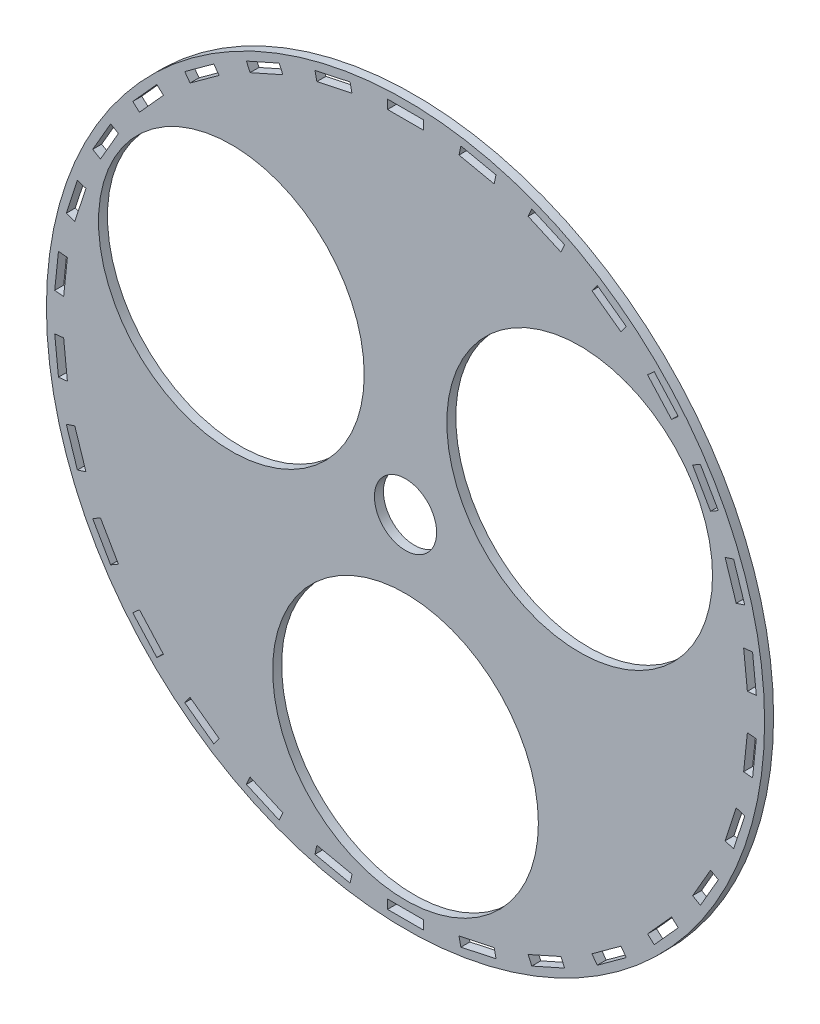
ISO-10303-21;
HEADER;
FILE_DESCRIPTION(('STEP AP214'),'2;1');
FILE_NAME('part.step','',(''),(''),'','','');
FILE_SCHEMA(('AUTOMOTIVE_DESIGN { 1 0 10303 214 1 1 1 1 }'));
ENDSEC;
DATA;
#1=APPLICATION_CONTEXT('core data for automotive mechanical design processes');
#2=APPLICATION_PROTOCOL_DEFINITION('international standard','automotive_design',2000,#1);
#3=PRODUCT_CONTEXT('',#1,'mechanical');
#4=PRODUCT('Part','Part','',(#3));
#5=PRODUCT_RELATED_PRODUCT_CATEGORY('part','',(#4));
#6=PRODUCT_DEFINITION_FORMATION('','',#4);
#7=PRODUCT_DEFINITION_CONTEXT('part definition',#1,'design');
#8=PRODUCT_DEFINITION('design','',#6,#7);
#9=PRODUCT_DEFINITION_SHAPE('','',#8);
#10=(LENGTH_UNIT() NAMED_UNIT(*) SI_UNIT(.MILLI.,.METRE.));
#11=(NAMED_UNIT(*) PLANE_ANGLE_UNIT() SI_UNIT($,.RADIAN.));
#12=(NAMED_UNIT(*) SI_UNIT($,.STERADIAN.) SOLID_ANGLE_UNIT());
#13=UNCERTAINTY_MEASURE_WITH_UNIT(LENGTH_MEASURE(1.E-05),#10,'distance_accuracy_value','');
#14=(GEOMETRIC_REPRESENTATION_CONTEXT(3) GLOBAL_UNCERTAINTY_ASSIGNED_CONTEXT((#13)) GLOBAL_UNIT_ASSIGNED_CONTEXT((#10,
#11,#12)) REPRESENTATION_CONTEXT('',''));
#15=CARTESIAN_POINT('',(0.,0.,0.));
#16=DIRECTION('',(0.,0.,1.));
#17=DIRECTION('',(1.,0.,0.));
#18=AXIS2_PLACEMENT_3D('',#15,#16,#17);
#19=CARTESIAN_POINT('',(0.,0.,3.175));
#20=DIRECTION('',(0.,0.,1.));
#21=DIRECTION('',(1.,0.,0.));
#22=AXIS2_PLACEMENT_3D('',#19,#20,#21);
#23=PLANE('',#22);
#24=CARTESIAN_POINT('',(-61.5917267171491,35.5600000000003,3.175));
#25=DIRECTION('',(0.,0.,1.));
#26=DIRECTION('',(1.,0.,0.));
#27=AXIS2_PLACEMENT_3D('',#24,#25,#26);
#28=CIRCLE('',#27,46.99);
#29=CARTESIAN_POINT('',(-14.6017267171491,35.5600000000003,3.175));
#30=VERTEX_POINT('',#29);
#31=EDGE_CURVE('E799',#30,#30,#28,.T.);
#32=ORIENTED_EDGE('',*,*,#31,.F.);
#33=EDGE_LOOP('',(#32));
#34=FACE_BOUND('',#33,.T.);
#35=CARTESIAN_POINT('',(0.,-71.12,3.175));
#36=DIRECTION('',(0.,0.,1.));
#37=DIRECTION('',(1.,0.,0.));
#38=AXIS2_PLACEMENT_3D('',#35,#36,#37);
#39=CIRCLE('',#38,46.99);
#40=CARTESIAN_POINT('',(46.99,-71.12,3.175));
#41=VERTEX_POINT('',#40);
#42=EDGE_CURVE('E1683',#41,#41,#39,.T.);
#43=ORIENTED_EDGE('',*,*,#42,.F.);
#44=EDGE_LOOP('',(#43));
#45=FACE_BOUND('',#44,.T.);
#46=CARTESIAN_POINT('',(0.,0.,3.175));
#47=DIRECTION('',(0.,0.,1.));
#48=DIRECTION('',(1.,0.,0.));
#49=AXIS2_PLACEMENT_3D('',#46,#47,#48);
#50=CIRCLE('',#49,127.);
#51=CARTESIAN_POINT('',(127.,0.,3.175));
#52=VERTEX_POINT('',#51);
#53=EDGE_CURVE('E11',#52,#52,#50,.T.);
#54=ORIENTED_EDGE('',*,*,#53,.T.);
#55=EDGE_LOOP('',(#54));
#56=FACE_BOUND('',#55,.T.);
#57=DIRECTION('',(1.,0.,0.));
#58=VECTOR('',#57,1.);
#59=CARTESIAN_POINT('',(-6.35,-124.079,3.175));
#60=LINE('',#59,#58);
#61=CARTESIAN_POINT('',(-6.35,-124.079,3.175));
#62=VERTEX_POINT('',#61);
#63=CARTESIAN_POINT('',(6.35,-124.079,3.175));
#64=VERTEX_POINT('',#63);
#65=EDGE_CURVE('E1691',#62,#64,#60,.T.);
#66=ORIENTED_EDGE('',*,*,#65,.F.);
#67=DIRECTION('',(0.,-1.,0.));
#68=VECTOR('',#67,1.);
#69=CARTESIAN_POINT('',(-6.35,-120.904,3.175));
#70=LINE('',#69,#68);
#71=CARTESIAN_POINT('',(-6.35,-120.904,3.175));
#72=VERTEX_POINT('',#71);
#73=EDGE_CURVE('E1689',#72,#62,#70,.T.);
#74=ORIENTED_EDGE('',*,*,#73,.F.);
#75=DIRECTION('',(-1.,0.,0.));
#76=VECTOR('',#75,1.);
#77=CARTESIAN_POINT('',(-6.35,-120.904,3.175));
#78=LINE('',#77,#76);
#79=CARTESIAN_POINT('',(6.35,-120.904,3.175));
#80=VERTEX_POINT('',#79);
#81=EDGE_CURVE('E1697',#80,#72,#78,.T.);
#82=ORIENTED_EDGE('',*,*,#81,.F.);
#83=DIRECTION('',(0.,1.,0.));
#84=VECTOR('',#83,1.);
#85=CARTESIAN_POINT('',(6.35,-120.904,3.175));
#86=LINE('',#85,#84);
#87=EDGE_CURVE('E1694',#64,#80,#86,.T.);
#88=ORIENTED_EDGE('',*,*,#87,.F.);
#89=EDGE_LOOP('',(#66,#74,#82,#88));
#90=FACE_BOUND('',#89,.T.);
#91=CARTESIAN_POINT('',(0.,0.,3.175));
#92=DIRECTION('',(0.,0.,1.));
#93=DIRECTION('',(1.,0.,0.));
#94=AXIS2_PLACEMENT_3D('',#91,#92,#93);
#95=CIRCLE('',#94,11.);
#96=CARTESIAN_POINT('',(11.,0.,3.175));
#97=VERTEX_POINT('',#96);
#98=EDGE_CURVE('E1677',#97,#97,#95,.T.);
#99=ORIENTED_EDGE('',*,*,#98,.F.);
#100=EDGE_LOOP('',(#99));
#101=FACE_BOUND('',#100,.T.);
#102=DIRECTION('',(0.978147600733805,-0.20791169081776,0.));
#103=VECTOR('',#102,1.);
#104=CARTESIAN_POINT('',(-32.0087119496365,-120.047336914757,3.175));
#105=LINE('',#104,#103);
#106=CARTESIAN_POINT('',(-32.0087119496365,-120.047336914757,3.175));
#107=VERTEX_POINT('',#106);
#108=CARTESIAN_POINT('',(-19.5862374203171,-122.687815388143,3.175));
#109=VERTEX_POINT('',#108);
#110=EDGE_CURVE('E1648',#107,#109,#105,.T.);
#111=ORIENTED_EDGE('',*,*,#110,.F.);
#112=DIRECTION('',(-0.20791169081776,-0.978147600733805,0.));
#113=VECTOR('',#112,1.);
#114=CARTESIAN_POINT('',(-31.3485923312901,-116.941718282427,3.175));
#115=LINE('',#114,#113);
#116=CARTESIAN_POINT('',(-31.3485923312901,-116.941718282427,3.175));
#117=VERTEX_POINT('',#116);
#118=EDGE_CURVE('E1646',#117,#107,#115,.T.);
#119=ORIENTED_EDGE('',*,*,#118,.F.);
#120=DIRECTION('',(-0.978147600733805,0.20791169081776,0.));
#121=VECTOR('',#120,1.);
#122=CARTESIAN_POINT('',(-31.3485923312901,-116.941718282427,3.175));
#123=LINE('',#122,#121);
#124=CARTESIAN_POINT('',(-18.9261178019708,-119.582196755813,3.175));
#125=VERTEX_POINT('',#124);
#126=EDGE_CURVE('E1654',#125,#117,#123,.T.);
#127=ORIENTED_EDGE('',*,*,#126,.F.);
#128=DIRECTION('',(0.207911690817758,0.978147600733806,0.));
#129=VECTOR('',#128,1.);
#130=CARTESIAN_POINT('',(-18.9261178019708,-119.582196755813,3.175));
#131=LINE('',#130,#129);
#132=EDGE_CURVE('E1651',#109,#125,#131,.T.);
#133=ORIENTED_EDGE('',*,*,#132,.F.);
#134=EDGE_LOOP('',(#111,#119,#127,#133));
#135=FACE_BOUND('',#134,.T.);
#136=DIRECTION('',(0.913545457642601,-0.406736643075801,0.));
#137=VECTOR('',#136,1.);
#138=CARTESIAN_POINT('',(-56.2684895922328,-110.769029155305,3.175));
#139=LINE('',#138,#137);
#140=CARTESIAN_POINT('',(-56.2684895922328,-110.769029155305,3.175));
#141=VERTEX_POINT('',#140);
#142=CARTESIAN_POINT('',(-44.6664622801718,-115.934584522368,3.175));
#143=VERTEX_POINT('',#142);
#144=EDGE_CURVE('E1617',#141,#143,#139,.T.);
#145=ORIENTED_EDGE('',*,*,#144,.F.);
#146=DIRECTION('',(-0.406736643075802,-0.9135454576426,0.));
#147=VECTOR('',#146,1.);
#148=CARTESIAN_POINT('',(-54.9771007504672,-107.86852232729,3.175));
#149=LINE('',#148,#147);
#150=CARTESIAN_POINT('',(-54.9771007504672,-107.86852232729,3.175));
#151=VERTEX_POINT('',#150);
#152=EDGE_CURVE('E1615',#151,#141,#149,.T.);
#153=ORIENTED_EDGE('',*,*,#152,.F.);
#154=DIRECTION('',(-0.913545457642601,0.406736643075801,0.));
#155=VECTOR('',#154,1.);
#156=CARTESIAN_POINT('',(-54.9771007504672,-107.86852232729,3.175));
#157=LINE('',#156,#155);
#158=CARTESIAN_POINT('',(-43.3750734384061,-113.034077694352,3.175));
#159=VERTEX_POINT('',#158);
#160=EDGE_CURVE('E1623',#159,#151,#157,.T.);
#161=ORIENTED_EDGE('',*,*,#160,.F.);
#162=DIRECTION('',(0.406736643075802,0.9135454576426,0.));
#163=VECTOR('',#162,1.);
#164=CARTESIAN_POINT('',(-43.3750734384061,-113.034077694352,3.175));
#165=LINE('',#164,#163);
#166=EDGE_CURVE('E1620',#143,#159,#165,.T.);
#167=ORIENTED_EDGE('',*,*,#166,.F.);
#168=EDGE_LOOP('',(#145,#153,#161,#167));
#169=FACE_BOUND('',#168,.T.);
#170=DIRECTION('',(0.809016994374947,-0.587785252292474,0.));
#171=VECTOR('',#170,1.);
#172=CARTESIAN_POINT('',(-78.0690642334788,-96.6495832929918,3.175));
#173=LINE('',#172,#171);
#174=CARTESIAN_POINT('',(-78.0690642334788,-96.6495832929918,3.175));
#175=VERTEX_POINT('',#174);
#176=CARTESIAN_POINT('',(-67.794548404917,-104.114455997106,3.175));
#177=VERTEX_POINT('',#176);
#178=EDGE_CURVE('E1586',#175,#177,#173,.T.);
#179=ORIENTED_EDGE('',*,*,#178,.F.);
#180=DIRECTION('',(-0.587785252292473,-0.809016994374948,0.));
#181=VECTOR('',#180,1.);
#182=CARTESIAN_POINT('',(-76.2028460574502,-94.0809543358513,3.175));
#183=LINE('',#182,#181);
#184=CARTESIAN_POINT('',(-76.2028460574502,-94.0809543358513,3.175));
#185=VERTEX_POINT('',#184);
#186=EDGE_CURVE('E1584',#185,#175,#183,.T.);
#187=ORIENTED_EDGE('',*,*,#186,.F.);
#188=DIRECTION('',(-0.809016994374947,0.587785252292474,0.));
#189=VECTOR('',#188,1.);
#190=CARTESIAN_POINT('',(-76.2028460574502,-94.0809543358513,3.175));
#191=LINE('',#190,#189);
#192=CARTESIAN_POINT('',(-65.9283302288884,-101.545827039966,3.175));
#193=VERTEX_POINT('',#192);
#194=EDGE_CURVE('E1592',#193,#185,#191,.T.);
#195=ORIENTED_EDGE('',*,*,#194,.F.);
#196=DIRECTION('',(0.587785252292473,0.809016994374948,0.));
#197=VECTOR('',#196,1.);
#198=CARTESIAN_POINT('',(-65.9283302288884,-101.545827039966,3.175));
#199=LINE('',#198,#197);
#200=EDGE_CURVE('E1589',#177,#193,#199,.T.);
#201=ORIENTED_EDGE('',*,*,#200,.F.);
#202=EDGE_LOOP('',(#179,#187,#195,#201));
#203=FACE_BOUND('',#202,.T.);
#204=DIRECTION('',(0.669130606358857,-0.743144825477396,0.));
#205=VECTOR('',#204,1.);
#206=CARTESIAN_POINT('',(-96.4576461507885,-78.3060868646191,3.175));
#207=LINE('',#206,#205);
#208=CARTESIAN_POINT('',(-96.4576461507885,-78.3060868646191,3.175));
#209=VERTEX_POINT('',#208);
#210=CARTESIAN_POINT('',(-87.959687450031,-87.7440261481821,3.175));
#211=VERTEX_POINT('',#210);
#212=EDGE_CURVE('E1555',#209,#211,#207,.T.);
#213=ORIENTED_EDGE('',*,*,#212,.F.);
#214=DIRECTION('',(-0.743144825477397,-0.669130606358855,0.));
#215=VECTOR('',#214,1.);
#216=CARTESIAN_POINT('',(-94.0981613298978,-76.1815971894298,3.175));
#217=LINE('',#216,#215);
#218=CARTESIAN_POINT('',(-94.0981613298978,-76.1815971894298,3.175));
#219=VERTEX_POINT('',#218);
#220=EDGE_CURVE('E1553',#219,#209,#217,.T.);
#221=ORIENTED_EDGE('',*,*,#220,.F.);
#222=DIRECTION('',(-0.669130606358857,0.743144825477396,0.));
#223=VECTOR('',#222,1.);
#224=CARTESIAN_POINT('',(-94.0981613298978,-76.1815971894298,3.175));
#225=LINE('',#224,#223);
#226=CARTESIAN_POINT('',(-85.6002026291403,-85.6195364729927,3.175));
#227=VERTEX_POINT('',#226);
#228=EDGE_CURVE('E1561',#227,#219,#225,.T.);
#229=ORIENTED_EDGE('',*,*,#228,.F.);
#230=DIRECTION('',(0.743144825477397,0.669130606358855,0.));
#231=VECTOR('',#230,1.);
#232=CARTESIAN_POINT('',(-85.6002026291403,-85.6195364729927,3.175));
#233=LINE('',#232,#231);
#234=EDGE_CURVE('E1558',#211,#227,#233,.T.);
#235=ORIENTED_EDGE('',*,*,#234,.F.);
#236=EDGE_LOOP('',(#213,#221,#229,#235));
#237=FACE_BOUND('',#236,.T.);
#238=DIRECTION('',(0.499999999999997,-0.86602540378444,0.));
#239=VECTOR('',#238,1.);
#240=CARTESIAN_POINT('',(-110.63056607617,-56.5402386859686,3.175));
#241=LINE('',#240,#239);
#242=CARTESIAN_POINT('',(-110.63056607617,-56.5402386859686,3.175));
#243=VERTEX_POINT('',#242);
#244=CARTESIAN_POINT('',(-104.28056607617,-67.5387613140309,3.175));
#245=VERTEX_POINT('',#244);
#246=EDGE_CURVE('E1524',#243,#245,#241,.T.);
#247=ORIENTED_EDGE('',*,*,#246,.F.);
#248=DIRECTION('',(-0.866025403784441,-0.499999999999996,0.));
#249=VECTOR('',#248,1.);
#250=CARTESIAN_POINT('',(-107.880935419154,-54.9527386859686,3.175));
#251=LINE('',#250,#249);
#252=CARTESIAN_POINT('',(-107.880935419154,-54.9527386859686,3.175));
#253=VERTEX_POINT('',#252);
#254=EDGE_CURVE('E1522',#253,#243,#251,.T.);
#255=ORIENTED_EDGE('',*,*,#254,.F.);
#256=DIRECTION('',(-0.499999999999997,0.86602540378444,0.));
#257=VECTOR('',#256,1.);
#258=CARTESIAN_POINT('',(-107.880935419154,-54.9527386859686,3.175));
#259=LINE('',#258,#257);
#260=CARTESIAN_POINT('',(-101.530935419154,-65.9512613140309,3.175));
#261=VERTEX_POINT('',#260);
#262=EDGE_CURVE('E1530',#261,#253,#259,.T.);
#263=ORIENTED_EDGE('',*,*,#262,.F.);
#264=DIRECTION('',(0.866025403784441,0.499999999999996,0.));
#265=VECTOR('',#264,1.);
#266=CARTESIAN_POINT('',(-101.530935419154,-65.9512613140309,3.175));
#267=LINE('',#266,#265);
#268=EDGE_CURVE('E1527',#245,#261,#267,.T.);
#269=ORIENTED_EDGE('',*,*,#268,.F.);
#270=EDGE_LOOP('',(#247,#255,#263,#269));
#271=FACE_BOUND('',#270,.T.);
#272=DIRECTION('',(0.309016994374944,-0.951056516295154,0.));
#273=VECTOR('',#272,1.);
#274=CARTESIAN_POINT('',(-119.968399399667,-32.3033107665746,3.175));
#275=LINE('',#274,#273);
#276=CARTESIAN_POINT('',(-119.968399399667,-32.3033107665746,3.175));
#277=VERTEX_POINT('',#276);
#278=CARTESIAN_POINT('',(-116.043883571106,-44.381728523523,3.175));
#279=VERTEX_POINT('',#278);
#280=EDGE_CURVE('E1493',#277,#279,#275,.T.);
#281=ORIENTED_EDGE('',*,*,#280,.F.);
#282=DIRECTION('',(-0.951056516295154,-0.309016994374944,0.));
#283=VECTOR('',#282,1.);
#284=CARTESIAN_POINT('',(-116.94879496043,-31.3221818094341,3.175));
#285=LINE('',#284,#283);
#286=CARTESIAN_POINT('',(-116.94879496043,-31.3221818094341,3.175));
#287=VERTEX_POINT('',#286);
#288=EDGE_CURVE('E1491',#287,#277,#285,.T.);
#289=ORIENTED_EDGE('',*,*,#288,.F.);
#290=DIRECTION('',(-0.309016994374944,0.951056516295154,0.));
#291=VECTOR('',#290,1.);
#292=CARTESIAN_POINT('',(-116.94879496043,-31.3221818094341,3.175));
#293=LINE('',#292,#291);
#294=CARTESIAN_POINT('',(-113.024279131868,-43.4005995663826,3.175));
#295=VERTEX_POINT('',#294);
#296=EDGE_CURVE('E1499',#295,#287,#293,.T.);
#297=ORIENTED_EDGE('',*,*,#296,.F.);
#298=DIRECTION('',(0.951056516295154,0.309016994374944,0.));
#299=VECTOR('',#298,1.);
#300=CARTESIAN_POINT('',(-113.024279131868,-43.4005995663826,3.175));
#301=LINE('',#300,#299);
#302=EDGE_CURVE('E1496',#279,#295,#301,.T.);
#303=ORIENTED_EDGE('',*,*,#302,.F.);
#304=EDGE_LOOP('',(#281,#289,#297,#303));
#305=FACE_BOUND('',#304,.T.);
#306=DIRECTION('',(0.10452846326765,-0.994521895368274,0.));
#307=VECTOR('',#306,1.);
#308=CARTESIAN_POINT('',(-124.06303799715,-6.65457315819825,3.175));
#309=LINE('',#308,#307);
#310=CARTESIAN_POINT('',(-124.06303799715,-6.65457315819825,3.175));
#311=VERTEX_POINT('',#310);
#312=CARTESIAN_POINT('',(-122.73552651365,-19.2850012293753,3.175));
#313=VERTEX_POINT('',#312);
#314=EDGE_CURVE('E1462',#311,#313,#309,.T.);
#315=ORIENTED_EDGE('',*,*,#314,.F.);
#316=DIRECTION('',(-0.994521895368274,-0.10452846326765,0.));
#317=VECTOR('',#316,1.);
#318=CARTESIAN_POINT('',(-120.905430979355,-6.32269528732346,3.175));
#319=LINE('',#318,#317);
#320=CARTESIAN_POINT('',(-120.905430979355,-6.32269528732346,3.175));
#321=VERTEX_POINT('',#320);
#322=EDGE_CURVE('E1460',#321,#311,#319,.T.);
#323=ORIENTED_EDGE('',*,*,#322,.F.);
#324=DIRECTION('',(-0.10452846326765,0.994521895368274,0.));
#325=VECTOR('',#324,1.);
#326=CARTESIAN_POINT('',(-120.905430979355,-6.32269528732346,3.175));
#327=LINE('',#326,#325);
#328=CARTESIAN_POINT('',(-119.577919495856,-18.9531233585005,3.175));
#329=VERTEX_POINT('',#328);
#330=EDGE_CURVE('E1468',#329,#321,#327,.T.);
#331=ORIENTED_EDGE('',*,*,#330,.F.);
#332=DIRECTION('',(0.994521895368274,0.10452846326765,0.));
#333=VECTOR('',#332,1.);
#334=CARTESIAN_POINT('',(-119.577919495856,-18.9531233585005,3.175));
#335=LINE('',#334,#333);
#336=EDGE_CURVE('E1465',#313,#329,#335,.T.);
#337=ORIENTED_EDGE('',*,*,#336,.F.);
#338=EDGE_LOOP('',(#315,#323,#331,#337));
#339=FACE_BOUND('',#338,.T.);
#340=DIRECTION('',(-0.104528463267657,-0.994521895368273,0.));
#341=VECTOR('',#340,1.);
#342=CARTESIAN_POINT('',(-122.73552651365,19.2850012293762,3.175));
#343=LINE('',#342,#341);
#344=CARTESIAN_POINT('',(-122.73552651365,19.2850012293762,3.175));
#345=VERTEX_POINT('',#344);
#346=CARTESIAN_POINT('',(-124.06303799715,6.6545731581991,3.175));
#347=VERTEX_POINT('',#346);
#348=EDGE_CURVE('E1431',#345,#347,#343,.T.);
#349=ORIENTED_EDGE('',*,*,#348,.F.);
#350=DIRECTION('',(-0.994521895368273,0.104528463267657,0.));
#351=VECTOR('',#350,1.);
#352=CARTESIAN_POINT('',(-119.577919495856,18.9531233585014,3.175));
#353=LINE('',#352,#351);
#354=CARTESIAN_POINT('',(-119.577919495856,18.9531233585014,3.175));
#355=VERTEX_POINT('',#354);
#356=EDGE_CURVE('E1429',#355,#345,#353,.T.);
#357=ORIENTED_EDGE('',*,*,#356,.F.);
#358=DIRECTION('',(0.104528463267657,0.994521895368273,0.));
#359=VECTOR('',#358,1.);
#360=CARTESIAN_POINT('',(-119.577919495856,18.9531233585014,3.175));
#361=LINE('',#360,#359);
#362=CARTESIAN_POINT('',(-120.905430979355,6.32269528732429,3.175));
#363=VERTEX_POINT('',#362);
#364=EDGE_CURVE('E1437',#363,#355,#361,.T.);
#365=ORIENTED_EDGE('',*,*,#364,.F.);
#366=DIRECTION('',(0.994521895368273,-0.104528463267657,0.));
#367=VECTOR('',#366,1.);
#368=CARTESIAN_POINT('',(-120.905430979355,6.32269528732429,3.175));
#369=LINE('',#368,#367);
#370=EDGE_CURVE('E1434',#347,#363,#369,.T.);
#371=ORIENTED_EDGE('',*,*,#370,.F.);
#372=EDGE_LOOP('',(#349,#357,#365,#371));
#373=FACE_BOUND('',#372,.T.);
#374=DIRECTION('',(-0.309016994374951,-0.951056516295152,0.));
#375=VECTOR('',#374,1.);
#376=CARTESIAN_POINT('',(-116.043883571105,44.3817285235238,3.175));
#377=LINE('',#376,#375);
#378=CARTESIAN_POINT('',(-116.043883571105,44.3817285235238,3.175));
#379=VERTEX_POINT('',#378);
#380=CARTESIAN_POINT('',(-119.968399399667,32.3033107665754,3.175));
#381=VERTEX_POINT('',#380);
#382=EDGE_CURVE('E1400',#379,#381,#377,.T.);
#383=ORIENTED_EDGE('',*,*,#382,.F.);
#384=DIRECTION('',(-0.951056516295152,0.309016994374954,0.));
#385=VECTOR('',#384,1.);
#386=CARTESIAN_POINT('',(-113.024279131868,43.4005995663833,3.175));
#387=LINE('',#386,#385);
#388=CARTESIAN_POINT('',(-113.024279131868,43.4005995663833,3.175));
#389=VERTEX_POINT('',#388);
#390=EDGE_CURVE('E1398',#389,#379,#387,.T.);
#391=ORIENTED_EDGE('',*,*,#390,.F.);
#392=DIRECTION('',(0.309016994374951,0.951056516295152,0.));
#393=VECTOR('',#392,1.);
#394=CARTESIAN_POINT('',(-113.024279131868,43.4005995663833,3.175));
#395=LINE('',#394,#393);
#396=CARTESIAN_POINT('',(-116.94879496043,31.3221818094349,3.175));
#397=VERTEX_POINT('',#396);
#398=EDGE_CURVE('E1406',#397,#389,#395,.T.);
#399=ORIENTED_EDGE('',*,*,#398,.F.);
#400=DIRECTION('',(0.951056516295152,-0.309016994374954,0.));
#401=VECTOR('',#400,1.);
#402=CARTESIAN_POINT('',(-116.94879496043,31.3221818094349,3.175));
#403=LINE('',#402,#401);
#404=EDGE_CURVE('E1403',#381,#397,#403,.T.);
#405=ORIENTED_EDGE('',*,*,#404,.F.);
#406=EDGE_LOOP('',(#383,#391,#399,#405));
#407=FACE_BOUND('',#406,.T.);
#408=DIRECTION('',(-0.500000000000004,-0.866025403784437,0.));
#409=VECTOR('',#408,1.);
#410=CARTESIAN_POINT('',(-104.280566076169,67.5387613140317,3.175));
#411=LINE('',#410,#409);
#412=CARTESIAN_POINT('',(-104.280566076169,67.5387613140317,3.175));
#413=VERTEX_POINT('',#412);
#414=CARTESIAN_POINT('',(-110.630566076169,56.5402386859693,3.175));
#415=VERTEX_POINT('',#414);
#416=EDGE_CURVE('E1369',#413,#415,#411,.T.);
#417=ORIENTED_EDGE('',*,*,#416,.F.);
#418=DIRECTION('',(-0.866025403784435,0.500000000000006,0.));
#419=VECTOR('',#418,1.);
#420=CARTESIAN_POINT('',(-101.530935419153,65.9512613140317,3.175));
#421=LINE('',#420,#419);
#422=CARTESIAN_POINT('',(-101.530935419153,65.9512613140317,3.175));
#423=VERTEX_POINT('',#422);
#424=EDGE_CURVE('E1367',#423,#413,#421,.T.);
#425=ORIENTED_EDGE('',*,*,#424,.F.);
#426=DIRECTION('',(0.500000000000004,0.866025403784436,0.));
#427=VECTOR('',#426,1.);
#428=CARTESIAN_POINT('',(-101.530935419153,65.9512613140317,3.175));
#429=LINE('',#428,#427);
#430=CARTESIAN_POINT('',(-107.880935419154,54.9527386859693,3.175));
#431=VERTEX_POINT('',#430);
#432=EDGE_CURVE('E1375',#431,#423,#429,.T.);
#433=ORIENTED_EDGE('',*,*,#432,.F.);
#434=DIRECTION('',(0.866025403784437,-0.500000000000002,0.));
#435=VECTOR('',#434,1.);
#436=CARTESIAN_POINT('',(-107.880935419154,54.9527386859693,3.175));
#437=LINE('',#436,#435);
#438=EDGE_CURVE('E1372',#415,#431,#437,.T.);
#439=ORIENTED_EDGE('',*,*,#438,.F.);
#440=EDGE_LOOP('',(#417,#425,#433,#439));
#441=FACE_BOUND('',#440,.T.);
#442=DIRECTION('',(-0.669130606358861,-0.743144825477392,0.));
#443=VECTOR('',#442,1.);
#444=CARTESIAN_POINT('',(-87.9596874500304,87.7440261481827,3.175));
#445=LINE('',#444,#443);
#446=CARTESIAN_POINT('',(-87.9596874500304,87.7440261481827,3.175));
#447=VERTEX_POINT('',#446);
#448=CARTESIAN_POINT('',(-96.457646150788,78.3060868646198,3.175));
#449=VERTEX_POINT('',#448);
#450=EDGE_CURVE('E1338',#447,#449,#445,.T.);
#451=ORIENTED_EDGE('',*,*,#450,.F.);
#452=DIRECTION('',(-0.743144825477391,0.669130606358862,0.));
#453=VECTOR('',#452,1.);
#454=CARTESIAN_POINT('',(-85.6002026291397,85.6195364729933,3.175));
#455=LINE('',#454,#453);
#456=CARTESIAN_POINT('',(-85.6002026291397,85.6195364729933,3.175));
#457=VERTEX_POINT('',#456);
#458=EDGE_CURVE('E1336',#457,#447,#455,.T.);
#459=ORIENTED_EDGE('',*,*,#458,.F.);
#460=DIRECTION('',(0.669130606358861,0.743144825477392,0.));
#461=VECTOR('',#460,1.);
#462=CARTESIAN_POINT('',(-85.6002026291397,85.6195364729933,3.175));
#463=LINE('',#462,#461);
#464=CARTESIAN_POINT('',(-94.0981613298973,76.1815971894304,3.175));
#465=VERTEX_POINT('',#464);
#466=EDGE_CURVE('E1344',#465,#457,#463,.T.);
#467=ORIENTED_EDGE('',*,*,#466,.F.);
#468=DIRECTION('',(0.743144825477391,-0.669130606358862,0.));
#469=VECTOR('',#468,1.);
#470=CARTESIAN_POINT('',(-94.0981613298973,76.1815971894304,3.175));
#471=LINE('',#470,#469);
#472=EDGE_CURVE('E1341',#449,#465,#471,.T.);
#473=ORIENTED_EDGE('',*,*,#472,.F.);
#474=EDGE_LOOP('',(#451,#459,#467,#473));
#475=FACE_BOUND('',#474,.T.);
#476=DIRECTION('',(-0.80901699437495,-0.587785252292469,0.));
#477=VECTOR('',#476,1.);
#478=CARTESIAN_POINT('',(-67.7945484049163,104.114455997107,3.175));
#479=LINE('',#478,#477);
#480=CARTESIAN_POINT('',(-67.7945484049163,104.114455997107,3.175));
#481=VERTEX_POINT('',#480);
#482=CARTESIAN_POINT('',(-78.0690642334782,96.6495832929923,3.175));
#483=VERTEX_POINT('',#482);
#484=EDGE_CURVE('E1307',#481,#483,#479,.T.);
#485=ORIENTED_EDGE('',*,*,#484,.F.);
#486=DIRECTION('',(-0.587785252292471,0.809016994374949,0.));
#487=VECTOR('',#486,1.);
#488=CARTESIAN_POINT('',(-65.9283302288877,101.545827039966,3.175));
#489=LINE('',#488,#487);
#490=CARTESIAN_POINT('',(-65.9283302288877,101.545827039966,3.175));
#491=VERTEX_POINT('',#490);
#492=EDGE_CURVE('E1305',#491,#481,#489,.T.);
#493=ORIENTED_EDGE('',*,*,#492,.F.);
#494=DIRECTION('',(0.80901699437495,0.587785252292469,0.));
#495=VECTOR('',#494,1.);
#496=CARTESIAN_POINT('',(-65.9283302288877,101.545827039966,3.175));
#497=LINE('',#496,#495);
#498=CARTESIAN_POINT('',(-76.2028460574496,94.0809543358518,3.175));
#499=VERTEX_POINT('',#498);
#500=EDGE_CURVE('E1313',#499,#491,#497,.T.);
#501=ORIENTED_EDGE('',*,*,#500,.F.);
#502=DIRECTION('',(0.587785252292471,-0.809016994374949,0.));
#503=VECTOR('',#502,1.);
#504=CARTESIAN_POINT('',(-76.2028460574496,94.0809543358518,3.175));
#505=LINE('',#504,#503);
#506=EDGE_CURVE('E1310',#483,#499,#505,.T.);
#507=ORIENTED_EDGE('',*,*,#506,.F.);
#508=EDGE_LOOP('',(#485,#493,#501,#507));
#509=FACE_BOUND('',#508,.T.);
#510=DIRECTION('',(-0.913545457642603,-0.406736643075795,0.));
#511=VECTOR('',#510,1.);
#512=CARTESIAN_POINT('',(-44.666462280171,115.934584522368,3.175));
#513=LINE('',#512,#511);
#514=CARTESIAN_POINT('',(-44.666462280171,115.934584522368,3.175));
#515=VERTEX_POINT('',#514);
#516=CARTESIAN_POINT('',(-56.2684895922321,110.769029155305,3.175));
#517=VERTEX_POINT('',#516);
#518=EDGE_CURVE('E1276',#515,#517,#513,.T.);
#519=ORIENTED_EDGE('',*,*,#518,.F.);
#520=DIRECTION('',(-0.406736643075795,0.913545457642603,0.));
#521=VECTOR('',#520,1.);
#522=CARTESIAN_POINT('',(-43.3750734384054,113.034077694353,3.175));
#523=LINE('',#522,#521);
#524=CARTESIAN_POINT('',(-43.3750734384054,113.034077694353,3.175));
#525=VERTEX_POINT('',#524);
#526=EDGE_CURVE('E1274',#525,#515,#523,.T.);
#527=ORIENTED_EDGE('',*,*,#526,.F.);
#528=DIRECTION('',(0.913545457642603,0.406736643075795,0.));
#529=VECTOR('',#528,1.);
#530=CARTESIAN_POINT('',(-43.3750734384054,113.034077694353,3.175));
#531=LINE('',#530,#529);
#532=CARTESIAN_POINT('',(-54.9771007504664,107.86852232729,3.175));
#533=VERTEX_POINT('',#532);
#534=EDGE_CURVE('E1282',#533,#525,#531,.T.);
#535=ORIENTED_EDGE('',*,*,#534,.F.);
#536=DIRECTION('',(0.406736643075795,-0.913545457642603,0.));
#537=VECTOR('',#536,1.);
#538=CARTESIAN_POINT('',(-54.9771007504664,107.86852232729,3.175));
#539=LINE('',#538,#537);
#540=EDGE_CURVE('E1279',#517,#533,#539,.T.);
#541=ORIENTED_EDGE('',*,*,#540,.F.);
#542=EDGE_LOOP('',(#519,#527,#535,#541));
#543=FACE_BOUND('',#542,.T.);
#544=DIRECTION('',(-0.978147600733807,-0.207911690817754,0.));
#545=VECTOR('',#544,1.);
#546=CARTESIAN_POINT('',(-19.5862374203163,122.687815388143,3.175));
#547=LINE('',#546,#545);
#548=CARTESIAN_POINT('',(-19.5862374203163,122.687815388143,3.175));
#549=VERTEX_POINT('',#548);
#550=CARTESIAN_POINT('',(-32.0087119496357,120.047336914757,3.175));
#551=VERTEX_POINT('',#550);
#552=EDGE_CURVE('E1245',#549,#551,#547,.T.);
#553=ORIENTED_EDGE('',*,*,#552,.F.);
#554=DIRECTION('',(-0.207911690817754,0.978147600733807,0.));
#555=VECTOR('',#554,1.);
#556=CARTESIAN_POINT('',(-18.92611780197,119.582196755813,3.175));
#557=LINE('',#556,#555);
#558=CARTESIAN_POINT('',(-18.92611780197,119.582196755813,3.175));
#559=VERTEX_POINT('',#558);
#560=EDGE_CURVE('E1243',#559,#549,#557,.T.);
#561=ORIENTED_EDGE('',*,*,#560,.F.);
#562=DIRECTION('',(0.978147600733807,0.207911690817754,0.));
#563=VECTOR('',#562,1.);
#564=CARTESIAN_POINT('',(-18.92611780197,119.582196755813,3.175));
#565=LINE('',#564,#563);
#566=CARTESIAN_POINT('',(-31.3485923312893,116.941718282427,3.175));
#567=VERTEX_POINT('',#566);
#568=EDGE_CURVE('E1251',#567,#559,#565,.T.);
#569=ORIENTED_EDGE('',*,*,#568,.F.);
#570=DIRECTION('',(0.207911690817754,-0.978147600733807,0.));
#571=VECTOR('',#570,1.);
#572=CARTESIAN_POINT('',(-31.3485923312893,116.941718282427,3.175));
#573=LINE('',#572,#571);
#574=EDGE_CURVE('E1248',#551,#567,#573,.T.);
#575=ORIENTED_EDGE('',*,*,#574,.F.);
#576=EDGE_LOOP('',(#553,#561,#569,#575));
#577=FACE_BOUND('',#576,.T.);
#578=DIRECTION('',(-1.,0.,0.));
#579=VECTOR('',#578,1.);
#580=CARTESIAN_POINT('',(6.35000000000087,124.079,3.175));
#581=LINE('',#580,#579);
#582=CARTESIAN_POINT('',(6.35000000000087,124.079,3.175));
#583=VERTEX_POINT('',#582);
#584=CARTESIAN_POINT('',(-6.34999999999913,124.079,3.175));
#585=VERTEX_POINT('',#584);
#586=EDGE_CURVE('E1214',#583,#585,#581,.T.);
#587=ORIENTED_EDGE('',*,*,#586,.F.);
#588=DIRECTION('',(0.,1.,0.));
#589=VECTOR('',#588,1.);
#590=CARTESIAN_POINT('',(6.35000000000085,120.904,3.175));
#591=LINE('',#590,#589);
#592=CARTESIAN_POINT('',(6.35000000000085,120.904,3.175));
#593=VERTEX_POINT('',#592);
#594=EDGE_CURVE('E1212',#593,#583,#591,.T.);
#595=ORIENTED_EDGE('',*,*,#594,.F.);
#596=DIRECTION('',(1.,0.,0.));
#597=VECTOR('',#596,1.);
#598=CARTESIAN_POINT('',(6.35000000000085,120.904,3.175));
#599=LINE('',#598,#597);
#600=CARTESIAN_POINT('',(-6.34999999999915,120.904,3.175));
#601=VERTEX_POINT('',#600);
#602=EDGE_CURVE('E1220',#601,#593,#599,.T.);
#603=ORIENTED_EDGE('',*,*,#602,.F.);
#604=DIRECTION('',(0.,-1.,0.));
#605=VECTOR('',#604,1.);
#606=CARTESIAN_POINT('',(-6.34999999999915,120.904,3.175));
#607=LINE('',#606,#605);
#608=EDGE_CURVE('E1217',#585,#601,#607,.T.);
#609=ORIENTED_EDGE('',*,*,#608,.F.);
#610=EDGE_LOOP('',(#587,#595,#603,#609));
#611=FACE_BOUND('',#610,.T.);
#612=DIRECTION('',(-0.978147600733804,0.207911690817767,0.));
#613=VECTOR('',#612,1.);
#614=CARTESIAN_POINT('',(32.0087119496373,120.047336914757,3.175));
#615=LINE('',#614,#613);
#616=CARTESIAN_POINT('',(32.0087119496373,120.047336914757,3.175));
#617=VERTEX_POINT('',#616);
#618=CARTESIAN_POINT('',(19.586237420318,122.687815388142,3.175));
#619=VERTEX_POINT('',#618);
#620=EDGE_CURVE('E1183',#617,#619,#615,.T.);
#621=ORIENTED_EDGE('',*,*,#620,.F.);
#622=DIRECTION('',(0.207911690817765,0.978147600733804,0.));
#623=VECTOR('',#622,1.);
#624=CARTESIAN_POINT('',(31.3485923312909,116.941718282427,3.175));
#625=LINE('',#624,#623);
#626=CARTESIAN_POINT('',(31.3485923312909,116.941718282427,3.175));
#627=VERTEX_POINT('',#626);
#628=EDGE_CURVE('E1181',#627,#617,#625,.T.);
#629=ORIENTED_EDGE('',*,*,#628,.F.);
#630=DIRECTION('',(0.978147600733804,-0.207911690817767,0.));
#631=VECTOR('',#630,1.);
#632=CARTESIAN_POINT('',(31.3485923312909,116.941718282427,3.175));
#633=LINE('',#632,#631);
#634=CARTESIAN_POINT('',(18.9261178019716,119.582196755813,3.175));
#635=VERTEX_POINT('',#634);
#636=EDGE_CURVE('E1189',#635,#627,#633,.T.);
#637=ORIENTED_EDGE('',*,*,#636,.F.);
#638=DIRECTION('',(-0.207911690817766,-0.978147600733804,0.));
#639=VECTOR('',#638,1.);
#640=CARTESIAN_POINT('',(18.9261178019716,119.582196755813,3.175));
#641=LINE('',#640,#639);
#642=EDGE_CURVE('E1186',#619,#635,#641,.T.);
#643=ORIENTED_EDGE('',*,*,#642,.F.);
#644=EDGE_LOOP('',(#621,#629,#637,#643));
#645=FACE_BOUND('',#644,.T.);
#646=DIRECTION('',(-0.913545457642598,0.406736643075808,0.));
#647=VECTOR('',#646,1.);
#648=CARTESIAN_POINT('',(56.2684895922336,110.769029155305,3.175));
#649=LINE('',#648,#647);
#650=CARTESIAN_POINT('',(56.2684895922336,110.769029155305,3.175));
#651=VERTEX_POINT('',#650);
#652=CARTESIAN_POINT('',(44.6664622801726,115.934584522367,3.175));
#653=VERTEX_POINT('',#652);
#654=EDGE_CURVE('E1152',#651,#653,#649,.T.);
#655=ORIENTED_EDGE('',*,*,#654,.F.);
#656=DIRECTION('',(0.406736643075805,0.913545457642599,0.));
#657=VECTOR('',#656,1.);
#658=CARTESIAN_POINT('',(54.9771007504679,107.868522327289,3.175));
#659=LINE('',#658,#657);
#660=CARTESIAN_POINT('',(54.9771007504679,107.868522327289,3.175));
#661=VERTEX_POINT('',#660);
#662=EDGE_CURVE('E1150',#661,#651,#659,.T.);
#663=ORIENTED_EDGE('',*,*,#662,.F.);
#664=DIRECTION('',(0.913545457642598,-0.406736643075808,0.));
#665=VECTOR('',#664,1.);
#666=CARTESIAN_POINT('',(54.9771007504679,107.868522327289,3.175));
#667=LINE('',#666,#665);
#668=CARTESIAN_POINT('',(43.3750734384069,113.034077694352,3.175));
#669=VERTEX_POINT('',#668);
#670=EDGE_CURVE('E1158',#669,#661,#667,.T.);
#671=ORIENTED_EDGE('',*,*,#670,.F.);
#672=DIRECTION('',(-0.406736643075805,-0.913545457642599,0.));
#673=VECTOR('',#672,1.);
#674=CARTESIAN_POINT('',(43.3750734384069,113.034077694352,3.175));
#675=LINE('',#674,#673);
#676=EDGE_CURVE('E1155',#653,#669,#675,.T.);
#677=ORIENTED_EDGE('',*,*,#676,.F.);
#678=EDGE_LOOP('',(#655,#663,#671,#677));
#679=FACE_BOUND('',#678,.T.);
#680=DIRECTION('',(-0.809016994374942,0.587785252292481,0.));
#681=VECTOR('',#680,1.);
#682=CARTESIAN_POINT('',(78.0690642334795,96.6495832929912,3.175));
#683=LINE('',#682,#681);
#684=CARTESIAN_POINT('',(78.0690642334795,96.6495832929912,3.175));
#685=VERTEX_POINT('',#684);
#686=CARTESIAN_POINT('',(67.7945484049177,104.114455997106,3.175));
#687=VERTEX_POINT('',#686);
#688=EDGE_CURVE('E1121',#685,#687,#683,.T.);
#689=ORIENTED_EDGE('',*,*,#688,.F.);
#690=DIRECTION('',(0.587785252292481,0.809016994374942,0.));
#691=VECTOR('',#690,1.);
#692=CARTESIAN_POINT('',(76.2028460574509,94.0809543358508,3.175));
#693=LINE('',#692,#691);
#694=CARTESIAN_POINT('',(76.2028460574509,94.0809543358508,3.175));
#695=VERTEX_POINT('',#694);
#696=EDGE_CURVE('E1119',#695,#685,#693,.T.);
#697=ORIENTED_EDGE('',*,*,#696,.F.);
#698=DIRECTION('',(0.809016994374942,-0.587785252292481,0.));
#699=VECTOR('',#698,1.);
#700=CARTESIAN_POINT('',(76.2028460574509,94.0809543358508,3.175));
#701=LINE('',#700,#699);
#702=CARTESIAN_POINT('',(65.9283302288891,101.545827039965,3.175));
#703=VERTEX_POINT('',#702);
#704=EDGE_CURVE('E1127',#703,#695,#701,.T.);
#705=ORIENTED_EDGE('',*,*,#704,.F.);
#706=DIRECTION('',(-0.587785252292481,-0.809016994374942,0.));
#707=VECTOR('',#706,1.);
#708=CARTESIAN_POINT('',(65.9283302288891,101.545827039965,3.175));
#709=LINE('',#708,#707);
#710=EDGE_CURVE('E1124',#687,#703,#709,.T.);
#711=ORIENTED_EDGE('',*,*,#710,.F.);
#712=EDGE_LOOP('',(#689,#697,#705,#711));
#713=FACE_BOUND('',#712,.T.);
#714=DIRECTION('',(-0.669130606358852,0.7431448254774,0.));
#715=VECTOR('',#714,1.);
#716=CARTESIAN_POINT('',(96.4576461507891,78.3060868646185,3.175));
#717=LINE('',#716,#715);
#718=CARTESIAN_POINT('',(96.4576461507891,78.3060868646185,3.175));
#719=VERTEX_POINT('',#718);
#720=CARTESIAN_POINT('',(87.9596874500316,87.7440261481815,3.175));
#721=VERTEX_POINT('',#720);
#722=EDGE_CURVE('E1090',#719,#721,#717,.T.);
#723=ORIENTED_EDGE('',*,*,#722,.F.);
#724=DIRECTION('',(0.743144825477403,0.669130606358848,0.));
#725=VECTOR('',#724,1.);
#726=CARTESIAN_POINT('',(94.0981613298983,76.1815971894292,3.175));
#727=LINE('',#726,#725);
#728=CARTESIAN_POINT('',(94.0981613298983,76.1815971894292,3.175));
#729=VERTEX_POINT('',#728);
#730=EDGE_CURVE('E1088',#729,#719,#727,.T.);
#731=ORIENTED_EDGE('',*,*,#730,.F.);
#732=DIRECTION('',(0.669130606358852,-0.7431448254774,0.));
#733=VECTOR('',#732,1.);
#734=CARTESIAN_POINT('',(94.0981613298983,76.1815971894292,3.175));
#735=LINE('',#734,#733);
#736=CARTESIAN_POINT('',(85.6002026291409,85.6195364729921,3.175));
#737=VERTEX_POINT('',#736);
#738=EDGE_CURVE('E1096',#737,#729,#735,.T.);
#739=ORIENTED_EDGE('',*,*,#738,.F.);
#740=DIRECTION('',(-0.743144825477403,-0.669130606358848,0.));
#741=VECTOR('',#740,1.);
#742=CARTESIAN_POINT('',(85.6002026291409,85.6195364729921,3.175));
#743=LINE('',#742,#741);
#744=EDGE_CURVE('E1093',#721,#737,#743,.T.);
#745=ORIENTED_EDGE('',*,*,#744,.F.);
#746=EDGE_LOOP('',(#723,#731,#739,#745));
#747=FACE_BOUND('',#746,.T.);
#748=DIRECTION('',(-0.499999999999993,0.866025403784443,0.));
#749=VECTOR('',#748,1.);
#750=CARTESIAN_POINT('',(110.63056607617,56.5402386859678,3.175));
#751=LINE('',#750,#749);
#752=CARTESIAN_POINT('',(110.63056607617,56.5402386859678,3.175));
#753=VERTEX_POINT('',#752);
#754=CARTESIAN_POINT('',(104.28056607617,67.5387613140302,3.175));
#755=VERTEX_POINT('',#754);
#756=EDGE_CURVE('E1059',#753,#755,#751,.T.);
#757=ORIENTED_EDGE('',*,*,#756,.F.);
#758=DIRECTION('',(0.866025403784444,0.499999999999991,0.));
#759=VECTOR('',#758,1.);
#760=CARTESIAN_POINT('',(107.880935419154,54.9527386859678,3.175));
#761=LINE('',#760,#759);
#762=CARTESIAN_POINT('',(107.880935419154,54.9527386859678,3.175));
#763=VERTEX_POINT('',#762);
#764=EDGE_CURVE('E1057',#763,#753,#761,.T.);
#765=ORIENTED_EDGE('',*,*,#764,.F.);
#766=DIRECTION('',(0.499999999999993,-0.866025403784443,0.));
#767=VECTOR('',#766,1.);
#768=CARTESIAN_POINT('',(107.880935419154,54.9527386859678,3.175));
#769=LINE('',#768,#767);
#770=CARTESIAN_POINT('',(101.530935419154,65.9512613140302,3.175));
#771=VERTEX_POINT('',#770);
#772=EDGE_CURVE('E1065',#771,#763,#769,.T.);
#773=ORIENTED_EDGE('',*,*,#772,.F.);
#774=DIRECTION('',(-0.866025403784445,-0.499999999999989,0.));
#775=VECTOR('',#774,1.);
#776=CARTESIAN_POINT('',(101.530935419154,65.9512613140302,3.175));
#777=LINE('',#776,#775);
#778=EDGE_CURVE('E1062',#755,#771,#777,.T.);
#779=ORIENTED_EDGE('',*,*,#778,.F.);
#780=EDGE_LOOP('',(#757,#765,#773,#779));
#781=FACE_BOUND('',#780,.T.);
#782=DIRECTION('',(-0.309016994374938,0.951056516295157,0.));
#783=VECTOR('',#782,1.);
#784=CARTESIAN_POINT('',(119.968399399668,32.3033107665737,3.175));
#785=LINE('',#784,#783);
#786=CARTESIAN_POINT('',(119.968399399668,32.3033107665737,3.175));
#787=VERTEX_POINT('',#786);
#788=CARTESIAN_POINT('',(116.043883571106,44.3817285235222,3.175));
#789=VERTEX_POINT('',#788);
#790=EDGE_CURVE('E1028',#787,#789,#785,.T.);
#791=ORIENTED_EDGE('',*,*,#790,.F.);
#792=DIRECTION('',(0.951056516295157,0.309016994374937,0.));
#793=VECTOR('',#792,1.);
#794=CARTESIAN_POINT('',(116.94879496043,31.3221818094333,3.175));
#795=LINE('',#794,#793);
#796=CARTESIAN_POINT('',(116.94879496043,31.3221818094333,3.175));
#797=VERTEX_POINT('',#796);
#798=EDGE_CURVE('E1026',#797,#787,#795,.T.);
#799=ORIENTED_EDGE('',*,*,#798,.F.);
#800=DIRECTION('',(0.309016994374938,-0.951056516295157,0.));
#801=VECTOR('',#800,1.);
#802=CARTESIAN_POINT('',(116.94879496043,31.3221818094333,3.175));
#803=LINE('',#802,#801);
#804=CARTESIAN_POINT('',(113.024279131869,43.4005995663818,3.175));
#805=VERTEX_POINT('',#804);
#806=EDGE_CURVE('E1034',#805,#797,#803,.T.);
#807=ORIENTED_EDGE('',*,*,#806,.F.);
#808=DIRECTION('',(-0.951056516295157,-0.309016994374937,0.));
#809=VECTOR('',#808,1.);
#810=CARTESIAN_POINT('',(113.024279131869,43.4005995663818,3.175));
#811=LINE('',#810,#809);
#812=EDGE_CURVE('E1031',#789,#805,#811,.T.);
#813=ORIENTED_EDGE('',*,*,#812,.F.);
#814=EDGE_LOOP('',(#791,#799,#807,#813));
#815=FACE_BOUND('',#814,.T.);
#816=DIRECTION('',(-0.104528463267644,0.994521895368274,0.));
#817=VECTOR('',#816,1.);
#818=CARTESIAN_POINT('',(124.06303799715,6.6545731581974,3.175));
#819=LINE('',#818,#817);
#820=CARTESIAN_POINT('',(124.06303799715,6.6545731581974,3.175));
#821=VERTEX_POINT('',#820);
#822=CARTESIAN_POINT('',(122.735526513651,19.2850012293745,3.175));
#823=VERTEX_POINT('',#822);
#824=EDGE_CURVE('E997',#821,#823,#819,.T.);
#825=ORIENTED_EDGE('',*,*,#824,.F.);
#826=DIRECTION('',(0.994521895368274,0.104528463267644,0.));
#827=VECTOR('',#826,1.);
#828=CARTESIAN_POINT('',(120.905430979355,6.32269528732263,3.175));
#829=LINE('',#828,#827);
#830=CARTESIAN_POINT('',(120.905430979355,6.32269528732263,3.175));
#831=VERTEX_POINT('',#830);
#832=EDGE_CURVE('E995',#831,#821,#829,.T.);
#833=ORIENTED_EDGE('',*,*,#832,.F.);
#834=DIRECTION('',(0.104528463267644,-0.994521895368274,0.));
#835=VECTOR('',#834,1.);
#836=CARTESIAN_POINT('',(120.905430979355,6.32269528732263,3.175));
#837=LINE('',#836,#835);
#838=CARTESIAN_POINT('',(119.577919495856,18.9531233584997,3.175));
#839=VERTEX_POINT('',#838);
#840=EDGE_CURVE('E1003',#839,#831,#837,.T.);
#841=ORIENTED_EDGE('',*,*,#840,.F.);
#842=DIRECTION('',(-0.994521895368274,-0.104528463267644,0.));
#843=VECTOR('',#842,1.);
#844=CARTESIAN_POINT('',(119.577919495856,18.9531233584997,3.175));
#845=LINE('',#844,#843);
#846=EDGE_CURVE('E1000',#823,#839,#845,.T.);
#847=ORIENTED_EDGE('',*,*,#846,.F.);
#848=EDGE_LOOP('',(#825,#833,#841,#847));
#849=FACE_BOUND('',#848,.T.);
#850=DIRECTION('',(0.104528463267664,0.994521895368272,0.));
#851=VECTOR('',#850,1.);
#852=CARTESIAN_POINT('',(122.73552651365,-19.285001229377,3.175));
#853=LINE('',#852,#851);
#854=CARTESIAN_POINT('',(122.73552651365,-19.285001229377,3.175));
#855=VERTEX_POINT('',#854);
#856=CARTESIAN_POINT('',(124.06303799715,-6.6545731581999,3.175));
#857=VERTEX_POINT('',#856);
#858=EDGE_CURVE('E966',#855,#857,#853,.T.);
#859=ORIENTED_EDGE('',*,*,#858,.F.);
#860=DIRECTION('',(0.994521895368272,-0.104528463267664,0.));
#861=VECTOR('',#860,1.);
#862=CARTESIAN_POINT('',(119.577919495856,-18.9531233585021,3.175));
#863=LINE('',#862,#861);
#864=CARTESIAN_POINT('',(119.577919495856,-18.9531233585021,3.175));
#865=VERTEX_POINT('',#864);
#866=EDGE_CURVE('E964',#865,#855,#863,.T.);
#867=ORIENTED_EDGE('',*,*,#866,.F.);
#868=DIRECTION('',(-0.104528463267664,-0.994521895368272,0.));
#869=VECTOR('',#868,1.);
#870=CARTESIAN_POINT('',(119.577919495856,-18.9531233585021,3.175));
#871=LINE('',#870,#869);
#872=CARTESIAN_POINT('',(120.905430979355,-6.32269528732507,3.175));
#873=VERTEX_POINT('',#872);
#874=EDGE_CURVE('E972',#873,#865,#871,.T.);
#875=ORIENTED_EDGE('',*,*,#874,.F.);
#876=DIRECTION('',(-0.994521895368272,0.104528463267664,0.));
#877=VECTOR('',#876,1.);
#878=CARTESIAN_POINT('',(120.905430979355,-6.32269528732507,3.175));
#879=LINE('',#878,#877);
#880=EDGE_CURVE('E969',#857,#873,#879,.T.);
#881=ORIENTED_EDGE('',*,*,#880,.F.);
#882=EDGE_LOOP('',(#859,#867,#875,#881));
#883=FACE_BOUND('',#882,.T.);
#884=DIRECTION('',(0.309016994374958,0.95105651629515,0.));
#885=VECTOR('',#884,1.);
#886=CARTESIAN_POINT('',(116.043883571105,-44.3817285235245,3.175));
#887=LINE('',#886,#885);
#888=CARTESIAN_POINT('',(116.043883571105,-44.3817285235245,3.175));
#889=VERTEX_POINT('',#888);
#890=CARTESIAN_POINT('',(119.968399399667,-32.3033107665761,3.175));
#891=VERTEX_POINT('',#890);
#892=EDGE_CURVE('E935',#889,#891,#887,.T.);
#893=ORIENTED_EDGE('',*,*,#892,.F.);
#894=DIRECTION('',(0.95105651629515,-0.309016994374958,0.));
#895=VECTOR('',#894,1.);
#896=CARTESIAN_POINT('',(113.024279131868,-43.4005995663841,3.175));
#897=LINE('',#896,#895);
#898=CARTESIAN_POINT('',(113.024279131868,-43.4005995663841,3.175));
#899=VERTEX_POINT('',#898);
#900=EDGE_CURVE('E933',#899,#889,#897,.T.);
#901=ORIENTED_EDGE('',*,*,#900,.F.);
#902=DIRECTION('',(-0.309016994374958,-0.95105651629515,0.));
#903=VECTOR('',#902,1.);
#904=CARTESIAN_POINT('',(113.024279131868,-43.4005995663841,3.175));
#905=LINE('',#904,#903);
#906=CARTESIAN_POINT('',(116.94879496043,-31.3221818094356,3.175));
#907=VERTEX_POINT('',#906);
#908=EDGE_CURVE('E941',#907,#899,#905,.T.);
#909=ORIENTED_EDGE('',*,*,#908,.F.);
#910=DIRECTION('',(-0.95105651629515,0.309016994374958,0.));
#911=VECTOR('',#910,1.);
#912=CARTESIAN_POINT('',(116.94879496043,-31.3221818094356,3.175));
#913=LINE('',#912,#911);
#914=EDGE_CURVE('E938',#891,#907,#913,.T.);
#915=ORIENTED_EDGE('',*,*,#914,.F.);
#916=EDGE_LOOP('',(#893,#901,#909,#915));
#917=FACE_BOUND('',#916,.T.);
#918=DIRECTION('',(0.500000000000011,0.866025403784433,0.));
#919=VECTOR('',#918,1.);
#920=CARTESIAN_POINT('',(104.280566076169,-67.5387613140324,3.175));
#921=LINE('',#920,#919);
#922=CARTESIAN_POINT('',(104.280566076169,-67.5387613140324,3.175));
#923=VERTEX_POINT('',#922);
#924=CARTESIAN_POINT('',(110.630566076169,-56.5402386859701,3.175));
#925=VERTEX_POINT('',#924);
#926=EDGE_CURVE('E904',#923,#925,#921,.T.);
#927=ORIENTED_EDGE('',*,*,#926,.F.);
#928=DIRECTION('',(0.866025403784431,-0.500000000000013,0.));
#929=VECTOR('',#928,1.);
#930=CARTESIAN_POINT('',(101.530935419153,-65.9512613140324,3.175));
#931=LINE('',#930,#929);
#932=CARTESIAN_POINT('',(101.530935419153,-65.9512613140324,3.175));
#933=VERTEX_POINT('',#932);
#934=EDGE_CURVE('E902',#933,#923,#931,.T.);
#935=ORIENTED_EDGE('',*,*,#934,.F.);
#936=DIRECTION('',(-0.500000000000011,-0.866025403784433,0.));
#937=VECTOR('',#936,1.);
#938=CARTESIAN_POINT('',(101.530935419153,-65.9512613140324,3.175));
#939=LINE('',#938,#937);
#940=CARTESIAN_POINT('',(107.880935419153,-54.9527386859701,3.175));
#941=VERTEX_POINT('',#940);
#942=EDGE_CURVE('E910',#941,#933,#939,.T.);
#943=ORIENTED_EDGE('',*,*,#942,.F.);
#944=DIRECTION('',(-0.866025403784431,0.500000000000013,0.));
#945=VECTOR('',#944,1.);
#946=CARTESIAN_POINT('',(107.880935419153,-54.9527386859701,3.175));
#947=LINE('',#946,#945);
#948=EDGE_CURVE('E907',#925,#941,#947,.T.);
#949=ORIENTED_EDGE('',*,*,#948,.F.);
#950=EDGE_LOOP('',(#927,#935,#943,#949));
#951=FACE_BOUND('',#950,.T.);
#952=DIRECTION('',(0.669130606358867,0.743144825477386,0.));
#953=VECTOR('',#952,1.);
#954=CARTESIAN_POINT('',(87.9596874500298,-87.7440261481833,3.175));
#955=LINE('',#954,#953);
#956=CARTESIAN_POINT('',(87.9596874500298,-87.7440261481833,3.175));
#957=VERTEX_POINT('',#956);
#958=CARTESIAN_POINT('',(96.4576461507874,-78.3060868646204,3.175));
#959=VERTEX_POINT('',#958);
#960=EDGE_CURVE('E873',#957,#959,#955,.T.);
#961=ORIENTED_EDGE('',*,*,#960,.F.);
#962=DIRECTION('',(0.743144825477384,-0.669130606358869,0.));
#963=VECTOR('',#962,1.);
#964=CARTESIAN_POINT('',(85.6002026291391,-85.6195364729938,3.175));
#965=LINE('',#964,#963);
#966=CARTESIAN_POINT('',(85.6002026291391,-85.6195364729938,3.175));
#967=VERTEX_POINT('',#966);
#968=EDGE_CURVE('E871',#967,#957,#965,.T.);
#969=ORIENTED_EDGE('',*,*,#968,.F.);
#970=DIRECTION('',(-0.669130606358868,-0.743144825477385,0.));
#971=VECTOR('',#970,1.);
#972=CARTESIAN_POINT('',(85.6002026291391,-85.6195364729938,3.175));
#973=LINE('',#972,#971);
#974=CARTESIAN_POINT('',(94.0981613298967,-76.1815971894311,3.175));
#975=VERTEX_POINT('',#974);
#976=EDGE_CURVE('E879',#975,#967,#973,.T.);
#977=ORIENTED_EDGE('',*,*,#976,.F.);
#978=DIRECTION('',(-0.743144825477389,0.669130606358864,0.));
#979=VECTOR('',#978,1.);
#980=CARTESIAN_POINT('',(94.0981613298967,-76.1815971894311,3.175));
#981=LINE('',#980,#979);
#982=EDGE_CURVE('E876',#959,#975,#981,.T.);
#983=ORIENTED_EDGE('',*,*,#982,.F.);
#984=EDGE_LOOP('',(#961,#969,#977,#983));
#985=FACE_BOUND('',#984,.T.);
#986=DIRECTION('',(0.809016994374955,0.587785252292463,0.));
#987=VECTOR('',#986,1.);
#988=CARTESIAN_POINT('',(67.7945484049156,-104.114455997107,3.175));
#989=LINE('',#988,#987);
#990=CARTESIAN_POINT('',(67.7945484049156,-104.114455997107,3.175));
#991=VERTEX_POINT('',#990);
#992=CARTESIAN_POINT('',(78.0690642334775,-96.6495832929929,3.175));
#993=VERTEX_POINT('',#992);
#994=EDGE_CURVE('E842',#991,#993,#989,.T.);
#995=ORIENTED_EDGE('',*,*,#994,.F.);
#996=DIRECTION('',(0.587785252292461,-0.809016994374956,0.));
#997=VECTOR('',#996,1.);
#998=CARTESIAN_POINT('',(65.928330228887,-101.545827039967,3.175));
#999=LINE('',#998,#997);
#1000=CARTESIAN_POINT('',(65.928330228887,-101.545827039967,3.175));
#1001=VERTEX_POINT('',#1000);
#1002=EDGE_CURVE('E840',#1001,#991,#999,.T.);
#1003=ORIENTED_EDGE('',*,*,#1002,.F.);
#1004=DIRECTION('',(-0.809016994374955,-0.587785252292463,0.));
#1005=VECTOR('',#1004,1.);
#1006=CARTESIAN_POINT('',(65.928330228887,-101.545827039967,3.175));
#1007=LINE('',#1006,#1005);
#1008=CARTESIAN_POINT('',(76.2028460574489,-94.0809543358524,3.175));
#1009=VERTEX_POINT('',#1008);
#1010=EDGE_CURVE('E848',#1009,#1001,#1007,.T.);
#1011=ORIENTED_EDGE('',*,*,#1010,.F.);
#1012=DIRECTION('',(-0.587785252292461,0.809016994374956,0.));
#1013=VECTOR('',#1012,1.);
#1014=CARTESIAN_POINT('',(76.2028460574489,-94.0809543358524,3.175));
#1015=LINE('',#1014,#1013);
#1016=EDGE_CURVE('E845',#993,#1009,#1015,.T.);
#1017=ORIENTED_EDGE('',*,*,#1016,.F.);
#1018=EDGE_LOOP('',(#995,#1003,#1011,#1017));
#1019=FACE_BOUND('',#1018,.T.);
#1020=DIRECTION('',(0.913545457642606,0.406736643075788,0.));
#1021=VECTOR('',#1020,1.);
#1022=CARTESIAN_POINT('',(44.6664622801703,-115.934584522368,3.175));
#1023=LINE('',#1022,#1021);
#1024=CARTESIAN_POINT('',(44.6664622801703,-115.934584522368,3.175));
#1025=VERTEX_POINT('',#1024);
#1026=CARTESIAN_POINT('',(56.2684895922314,-110.769029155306,3.175));
#1027=VERTEX_POINT('',#1026);
#1028=EDGE_CURVE('E811',#1025,#1027,#1023,.T.);
#1029=ORIENTED_EDGE('',*,*,#1028,.F.);
#1030=DIRECTION('',(0.406736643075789,-0.913545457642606,0.));
#1031=VECTOR('',#1030,1.);
#1032=CARTESIAN_POINT('',(43.3750734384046,-113.034077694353,3.175));
#1033=LINE('',#1032,#1031);
#1034=CARTESIAN_POINT('',(43.3750734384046,-113.034077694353,3.175));
#1035=VERTEX_POINT('',#1034);
#1036=EDGE_CURVE('E809',#1035,#1025,#1033,.T.);
#1037=ORIENTED_EDGE('',*,*,#1036,.F.);
#1038=DIRECTION('',(-0.913545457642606,-0.406736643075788,0.));
#1039=VECTOR('',#1038,1.);
#1040=CARTESIAN_POINT('',(43.3750734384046,-113.034077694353,3.175));
#1041=LINE('',#1040,#1039);
#1042=CARTESIAN_POINT('',(54.9771007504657,-107.86852232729,3.175));
#1043=VERTEX_POINT('',#1042);
#1044=EDGE_CURVE('E817',#1043,#1035,#1041,.T.);
#1045=ORIENTED_EDGE('',*,*,#1044,.F.);
#1046=DIRECTION('',(-0.406736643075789,0.913545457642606,0.));
#1047=VECTOR('',#1046,1.);
#1048=CARTESIAN_POINT('',(54.9771007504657,-107.86852232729,3.175));
#1049=LINE('',#1048,#1047);
#1050=EDGE_CURVE('E814',#1027,#1043,#1049,.T.);
#1051=ORIENTED_EDGE('',*,*,#1050,.F.);
#1052=EDGE_LOOP('',(#1029,#1037,#1045,#1051));
#1053=FACE_BOUND('',#1052,.T.);
#1054=DIRECTION('',(0.978147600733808,0.207911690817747,0.));
#1055=VECTOR('',#1054,1.);
#1056=CARTESIAN_POINT('',(19.5862374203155,-122.687815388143,3.175));
#1057=LINE('',#1056,#1055);
#1058=CARTESIAN_POINT('',(19.5862374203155,-122.687815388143,3.175));
#1059=VERTEX_POINT('',#1058);
#1060=CARTESIAN_POINT('',(32.0087119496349,-120.047336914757,3.175));
#1061=VERTEX_POINT('',#1060);
#1062=EDGE_CURVE('E778',#1059,#1061,#1057,.T.);
#1063=ORIENTED_EDGE('',*,*,#1062,.F.);
#1064=DIRECTION('',(0.207911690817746,-0.978147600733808,0.));
#1065=VECTOR('',#1064,1.);
#1066=CARTESIAN_POINT('',(18.9261178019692,-119.582196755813,3.175));
#1067=LINE('',#1066,#1065);
#1068=CARTESIAN_POINT('',(18.9261178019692,-119.582196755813,3.175));
#1069=VERTEX_POINT('',#1068);
#1070=EDGE_CURVE('E770',#1069,#1059,#1067,.T.);
#1071=ORIENTED_EDGE('',*,*,#1070,.F.);
#1072=DIRECTION('',(-0.978147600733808,-0.207911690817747,0.));
#1073=VECTOR('',#1072,1.);
#1074=CARTESIAN_POINT('',(18.9261178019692,-119.582196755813,3.175));
#1075=LINE('',#1074,#1073);
#1076=CARTESIAN_POINT('',(31.3485923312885,-116.941718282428,3.175));
#1077=VERTEX_POINT('',#1076);
#1078=EDGE_CURVE('E793',#1077,#1069,#1075,.T.);
#1079=ORIENTED_EDGE('',*,*,#1078,.F.);
#1080=DIRECTION('',(-0.207911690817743,0.978147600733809,0.));
#1081=VECTOR('',#1080,1.);
#1082=CARTESIAN_POINT('',(31.3485923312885,-116.941718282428,3.175));
#1083=LINE('',#1082,#1081);
#1084=EDGE_CURVE('E791',#1061,#1077,#1083,.T.);
#1085=ORIENTED_EDGE('',*,*,#1084,.F.);
#1086=EDGE_LOOP('',(#1063,#1071,#1079,#1085));
#1087=FACE_BOUND('',#1086,.T.);
#1088=CARTESIAN_POINT('',(61.5917267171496,35.5599999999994,3.175));
#1089=DIRECTION('',(0.,0.,1.));
#1090=DIRECTION('',(1.,0.,0.));
#1091=AXIS2_PLACEMENT_3D('',#1088,#1089,#1090);
#1092=CIRCLE('',#1091,46.99);
#1093=CARTESIAN_POINT('',(108.58172671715,35.5599999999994,3.175));
#1094=VERTEX_POINT('',#1093);
#1095=EDGE_CURVE('E1751',#1094,#1094,#1092,.T.);
#1096=ORIENTED_EDGE('',*,*,#1095,.F.);
#1097=EDGE_LOOP('',(#1096));
#1098=FACE_BOUND('',#1097,.T.);
#1099=ADVANCED_FACE('F33',(#34,#45,#56,#90,#101,#135,#169,#203,#237,#271,#305,#339,#373,#407,
#441,#475,#509,#543,#577,#611,#645,#679,#713,#747,#781,#815,#849,#883,#917,#951,#985,#1019,
#1053,#1087,#1098),#23,.T.);
#1100=CARTESIAN_POINT('',(0.,0.,0.));
#1101=DIRECTION('',(0.,0.,1.));
#1102=DIRECTION('',(1.,0.,0.));
#1103=AXIS2_PLACEMENT_3D('',#1100,#1101,#1102);
#1104=PLANE('',#1103);
#1105=DIRECTION('',(0.406736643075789,-0.913545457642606,0.));
#1106=VECTOR('',#1105,1.);
#1107=CARTESIAN_POINT('',(43.3750734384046,-113.034077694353,0.));
#1108=LINE('',#1107,#1106);
#1109=CARTESIAN_POINT('',(43.3750734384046,-113.034077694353,0.));
#1110=VERTEX_POINT('',#1109);
#1111=CARTESIAN_POINT('',(44.6664622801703,-115.934584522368,0.));
#1112=VERTEX_POINT('',#1111);
#1113=EDGE_CURVE('E786',#1110,#1112,#1108,.T.);
#1114=ORIENTED_EDGE('',*,*,#1113,.T.);
#1115=DIRECTION('',(0.913545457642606,0.406736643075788,0.));
#1116=VECTOR('',#1115,1.);
#1117=CARTESIAN_POINT('',(44.6664622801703,-115.934584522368,0.));
#1118=LINE('',#1117,#1116);
#1119=CARTESIAN_POINT('',(56.2684895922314,-110.769029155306,0.));
#1120=VERTEX_POINT('',#1119);
#1121=EDGE_CURVE('E822',#1112,#1120,#1118,.T.);
#1122=ORIENTED_EDGE('',*,*,#1121,.T.);
#1123=DIRECTION('',(-0.406736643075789,0.913545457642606,0.));
#1124=VECTOR('',#1123,1.);
#1125=CARTESIAN_POINT('',(54.9771007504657,-107.86852232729,0.));
#1126=LINE('',#1125,#1124);
#1127=CARTESIAN_POINT('',(54.9771007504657,-107.86852232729,0.));
#1128=VERTEX_POINT('',#1127);
#1129=EDGE_CURVE('E825',#1120,#1128,#1126,.T.);
#1130=ORIENTED_EDGE('',*,*,#1129,.T.);
#1131=DIRECTION('',(-0.913545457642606,-0.406736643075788,0.));
#1132=VECTOR('',#1131,1.);
#1133=CARTESIAN_POINT('',(43.3750734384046,-113.034077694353,0.));
#1134=LINE('',#1133,#1132);
#1135=EDGE_CURVE('E812',#1128,#1110,#1134,.T.);
#1136=ORIENTED_EDGE('',*,*,#1135,.T.);
#1137=EDGE_LOOP('',(#1114,#1122,#1130,#1136));
#1138=FACE_BOUND('',#1137,.T.);
#1139=DIRECTION('',(0.743144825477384,-0.669130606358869,0.));
#1140=VECTOR('',#1139,1.);
#1141=CARTESIAN_POINT('',(85.6002026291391,-85.6195364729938,0.));
#1142=LINE('',#1141,#1140);
#1143=CARTESIAN_POINT('',(85.6002026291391,-85.6195364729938,0.));
#1144=VERTEX_POINT('',#1143);
#1145=CARTESIAN_POINT('',(87.9596874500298,-87.7440261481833,0.));
#1146=VERTEX_POINT('',#1145);
#1147=EDGE_CURVE('E870',#1144,#1146,#1142,.T.);
#1148=ORIENTED_EDGE('',*,*,#1147,.T.);
#1149=DIRECTION('',(0.669130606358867,0.743144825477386,0.));
#1150=VECTOR('',#1149,1.);
#1151=CARTESIAN_POINT('',(87.9596874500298,-87.7440261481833,0.));
#1152=LINE('',#1151,#1150);
#1153=CARTESIAN_POINT('',(96.4576461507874,-78.3060868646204,0.));
#1154=VERTEX_POINT('',#1153);
#1155=EDGE_CURVE('E884',#1146,#1154,#1152,.T.);
#1156=ORIENTED_EDGE('',*,*,#1155,.T.);
#1157=DIRECTION('',(-0.743144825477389,0.669130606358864,0.));
#1158=VECTOR('',#1157,1.);
#1159=CARTESIAN_POINT('',(94.0981613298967,-76.1815971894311,0.));
#1160=LINE('',#1159,#1158);
#1161=CARTESIAN_POINT('',(94.0981613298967,-76.1815971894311,0.));
#1162=VERTEX_POINT('',#1161);
#1163=EDGE_CURVE('E887',#1154,#1162,#1160,.T.);
#1164=ORIENTED_EDGE('',*,*,#1163,.T.);
#1165=DIRECTION('',(-0.669130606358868,-0.743144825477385,0.));
#1166=VECTOR('',#1165,1.);
#1167=CARTESIAN_POINT('',(85.6002026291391,-85.6195364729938,0.));
#1168=LINE('',#1167,#1166);
#1169=EDGE_CURVE('E874',#1162,#1144,#1168,.T.);
#1170=ORIENTED_EDGE('',*,*,#1169,.T.);
#1171=EDGE_LOOP('',(#1148,#1156,#1164,#1170));
#1172=FACE_BOUND('',#1171,.T.);
#1173=DIRECTION('',(0.95105651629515,-0.309016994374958,0.));
#1174=VECTOR('',#1173,1.);
#1175=CARTESIAN_POINT('',(113.024279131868,-43.4005995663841,0.));
#1176=LINE('',#1175,#1174);
#1177=CARTESIAN_POINT('',(113.024279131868,-43.4005995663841,0.));
#1178=VERTEX_POINT('',#1177);
#1179=CARTESIAN_POINT('',(116.043883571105,-44.3817285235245,0.));
#1180=VERTEX_POINT('',#1179);
#1181=EDGE_CURVE('E932',#1178,#1180,#1176,.T.);
#1182=ORIENTED_EDGE('',*,*,#1181,.T.);
#1183=DIRECTION('',(0.309016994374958,0.95105651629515,0.));
#1184=VECTOR('',#1183,1.);
#1185=CARTESIAN_POINT('',(116.043883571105,-44.3817285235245,0.));
#1186=LINE('',#1185,#1184);
#1187=CARTESIAN_POINT('',(119.968399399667,-32.3033107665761,0.));
#1188=VERTEX_POINT('',#1187);
#1189=EDGE_CURVE('E946',#1180,#1188,#1186,.T.);
#1190=ORIENTED_EDGE('',*,*,#1189,.T.);
#1191=DIRECTION('',(-0.95105651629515,0.309016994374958,0.));
#1192=VECTOR('',#1191,1.);
#1193=CARTESIAN_POINT('',(116.94879496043,-31.3221818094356,0.));
#1194=LINE('',#1193,#1192);
#1195=CARTESIAN_POINT('',(116.94879496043,-31.3221818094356,0.));
#1196=VERTEX_POINT('',#1195);
#1197=EDGE_CURVE('E949',#1188,#1196,#1194,.T.);
#1198=ORIENTED_EDGE('',*,*,#1197,.T.);
#1199=DIRECTION('',(-0.309016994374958,-0.95105651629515,0.));
#1200=VECTOR('',#1199,1.);
#1201=CARTESIAN_POINT('',(113.024279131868,-43.4005995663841,0.));
#1202=LINE('',#1201,#1200);
#1203=EDGE_CURVE('E936',#1196,#1178,#1202,.T.);
#1204=ORIENTED_EDGE('',*,*,#1203,.T.);
#1205=EDGE_LOOP('',(#1182,#1190,#1198,#1204));
#1206=FACE_BOUND('',#1205,.T.);
#1207=DIRECTION('',(0.994521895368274,0.104528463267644,0.));
#1208=VECTOR('',#1207,1.);
#1209=CARTESIAN_POINT('',(120.905430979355,6.32269528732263,0.));
#1210=LINE('',#1209,#1208);
#1211=CARTESIAN_POINT('',(120.905430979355,6.32269528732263,0.));
#1212=VERTEX_POINT('',#1211);
#1213=CARTESIAN_POINT('',(124.06303799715,6.6545731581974,0.));
#1214=VERTEX_POINT('',#1213);
#1215=EDGE_CURVE('E994',#1212,#1214,#1210,.T.);
#1216=ORIENTED_EDGE('',*,*,#1215,.T.);
#1217=DIRECTION('',(-0.104528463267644,0.994521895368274,0.));
#1218=VECTOR('',#1217,1.);
#1219=CARTESIAN_POINT('',(124.06303799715,6.6545731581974,0.));
#1220=LINE('',#1219,#1218);
#1221=CARTESIAN_POINT('',(122.735526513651,19.2850012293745,0.));
#1222=VERTEX_POINT('',#1221);
#1223=EDGE_CURVE('E1008',#1214,#1222,#1220,.T.);
#1224=ORIENTED_EDGE('',*,*,#1223,.T.);
#1225=DIRECTION('',(-0.994521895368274,-0.104528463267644,0.));
#1226=VECTOR('',#1225,1.);
#1227=CARTESIAN_POINT('',(119.577919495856,18.9531233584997,0.));
#1228=LINE('',#1227,#1226);
#1229=CARTESIAN_POINT('',(119.577919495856,18.9531233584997,0.));
#1230=VERTEX_POINT('',#1229);
#1231=EDGE_CURVE('E1011',#1222,#1230,#1228,.T.);
#1232=ORIENTED_EDGE('',*,*,#1231,.T.);
#1233=DIRECTION('',(0.104528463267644,-0.994521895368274,0.));
#1234=VECTOR('',#1233,1.);
#1235=CARTESIAN_POINT('',(120.905430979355,6.32269528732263,0.));
#1236=LINE('',#1235,#1234);
#1237=EDGE_CURVE('E998',#1230,#1212,#1236,.T.);
#1238=ORIENTED_EDGE('',*,*,#1237,.T.);
#1239=EDGE_LOOP('',(#1216,#1224,#1232,#1238));
#1240=FACE_BOUND('',#1239,.T.);
#1241=DIRECTION('',(0.866025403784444,0.499999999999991,0.));
#1242=VECTOR('',#1241,1.);
#1243=CARTESIAN_POINT('',(107.880935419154,54.9527386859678,0.));
#1244=LINE('',#1243,#1242);
#1245=CARTESIAN_POINT('',(107.880935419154,54.9527386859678,0.));
#1246=VERTEX_POINT('',#1245);
#1247=CARTESIAN_POINT('',(110.63056607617,56.5402386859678,0.));
#1248=VERTEX_POINT('',#1247);
#1249=EDGE_CURVE('E1056',#1246,#1248,#1244,.T.);
#1250=ORIENTED_EDGE('',*,*,#1249,.T.);
#1251=DIRECTION('',(-0.499999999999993,0.866025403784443,0.));
#1252=VECTOR('',#1251,1.);
#1253=CARTESIAN_POINT('',(110.63056607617,56.5402386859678,0.));
#1254=LINE('',#1253,#1252);
#1255=CARTESIAN_POINT('',(104.28056607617,67.5387613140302,0.));
#1256=VERTEX_POINT('',#1255);
#1257=EDGE_CURVE('E1070',#1248,#1256,#1254,.T.);
#1258=ORIENTED_EDGE('',*,*,#1257,.T.);
#1259=DIRECTION('',(-0.866025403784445,-0.499999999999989,0.));
#1260=VECTOR('',#1259,1.);
#1261=CARTESIAN_POINT('',(101.530935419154,65.9512613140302,0.));
#1262=LINE('',#1261,#1260);
#1263=CARTESIAN_POINT('',(101.530935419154,65.9512613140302,0.));
#1264=VERTEX_POINT('',#1263);
#1265=EDGE_CURVE('E1073',#1256,#1264,#1262,.T.);
#1266=ORIENTED_EDGE('',*,*,#1265,.T.);
#1267=DIRECTION('',(0.499999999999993,-0.866025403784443,0.));
#1268=VECTOR('',#1267,1.);
#1269=CARTESIAN_POINT('',(107.880935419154,54.9527386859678,0.));
#1270=LINE('',#1269,#1268);
#1271=EDGE_CURVE('E1060',#1264,#1246,#1270,.T.);
#1272=ORIENTED_EDGE('',*,*,#1271,.T.);
#1273=EDGE_LOOP('',(#1250,#1258,#1266,#1272));
#1274=FACE_BOUND('',#1273,.T.);
#1275=DIRECTION('',(0.587785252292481,0.809016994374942,0.));
#1276=VECTOR('',#1275,1.);
#1277=CARTESIAN_POINT('',(76.2028460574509,94.0809543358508,0.));
#1278=LINE('',#1277,#1276);
#1279=CARTESIAN_POINT('',(76.2028460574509,94.0809543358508,0.));
#1280=VERTEX_POINT('',#1279);
#1281=CARTESIAN_POINT('',(78.0690642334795,96.6495832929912,0.));
#1282=VERTEX_POINT('',#1281);
#1283=EDGE_CURVE('E1118',#1280,#1282,#1278,.T.);
#1284=ORIENTED_EDGE('',*,*,#1283,.T.);
#1285=DIRECTION('',(-0.809016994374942,0.587785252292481,0.));
#1286=VECTOR('',#1285,1.);
#1287=CARTESIAN_POINT('',(78.0690642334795,96.6495832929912,0.));
#1288=LINE('',#1287,#1286);
#1289=CARTESIAN_POINT('',(67.7945484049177,104.114455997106,0.));
#1290=VERTEX_POINT('',#1289);
#1291=EDGE_CURVE('E1132',#1282,#1290,#1288,.T.);
#1292=ORIENTED_EDGE('',*,*,#1291,.T.);
#1293=DIRECTION('',(-0.587785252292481,-0.809016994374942,0.));
#1294=VECTOR('',#1293,1.);
#1295=CARTESIAN_POINT('',(65.9283302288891,101.545827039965,0.));
#1296=LINE('',#1295,#1294);
#1297=CARTESIAN_POINT('',(65.9283302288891,101.545827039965,0.));
#1298=VERTEX_POINT('',#1297);
#1299=EDGE_CURVE('E1135',#1290,#1298,#1296,.T.);
#1300=ORIENTED_EDGE('',*,*,#1299,.T.);
#1301=DIRECTION('',(0.809016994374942,-0.587785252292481,0.));
#1302=VECTOR('',#1301,1.);
#1303=CARTESIAN_POINT('',(76.2028460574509,94.0809543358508,0.));
#1304=LINE('',#1303,#1302);
#1305=EDGE_CURVE('E1122',#1298,#1280,#1304,.T.);
#1306=ORIENTED_EDGE('',*,*,#1305,.T.);
#1307=EDGE_LOOP('',(#1284,#1292,#1300,#1306));
#1308=FACE_BOUND('',#1307,.T.);
#1309=DIRECTION('',(0.207911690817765,0.978147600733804,0.));
#1310=VECTOR('',#1309,1.);
#1311=CARTESIAN_POINT('',(31.3485923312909,116.941718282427,0.));
#1312=LINE('',#1311,#1310);
#1313=CARTESIAN_POINT('',(31.3485923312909,116.941718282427,0.));
#1314=VERTEX_POINT('',#1313);
#1315=CARTESIAN_POINT('',(32.0087119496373,120.047336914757,0.));
#1316=VERTEX_POINT('',#1315);
#1317=EDGE_CURVE('E1180',#1314,#1316,#1312,.T.);
#1318=ORIENTED_EDGE('',*,*,#1317,.T.);
#1319=DIRECTION('',(-0.978147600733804,0.207911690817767,0.));
#1320=VECTOR('',#1319,1.);
#1321=CARTESIAN_POINT('',(32.0087119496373,120.047336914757,0.));
#1322=LINE('',#1321,#1320);
#1323=CARTESIAN_POINT('',(19.586237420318,122.687815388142,0.));
#1324=VERTEX_POINT('',#1323);
#1325=EDGE_CURVE('E1194',#1316,#1324,#1322,.T.);
#1326=ORIENTED_EDGE('',*,*,#1325,.T.);
#1327=DIRECTION('',(-0.207911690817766,-0.978147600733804,0.));
#1328=VECTOR('',#1327,1.);
#1329=CARTESIAN_POINT('',(18.9261178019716,119.582196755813,0.));
#1330=LINE('',#1329,#1328);
#1331=CARTESIAN_POINT('',(18.9261178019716,119.582196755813,0.));
#1332=VERTEX_POINT('',#1331);
#1333=EDGE_CURVE('E1197',#1324,#1332,#1330,.T.);
#1334=ORIENTED_EDGE('',*,*,#1333,.T.);
#1335=DIRECTION('',(0.978147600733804,-0.207911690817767,0.));
#1336=VECTOR('',#1335,1.);
#1337=CARTESIAN_POINT('',(31.3485923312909,116.941718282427,0.));
#1338=LINE('',#1337,#1336);
#1339=EDGE_CURVE('E1184',#1332,#1314,#1338,.T.);
#1340=ORIENTED_EDGE('',*,*,#1339,.T.);
#1341=EDGE_LOOP('',(#1318,#1326,#1334,#1340));
#1342=FACE_BOUND('',#1341,.T.);
#1343=DIRECTION('',(-0.207911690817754,0.978147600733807,0.));
#1344=VECTOR('',#1343,1.);
#1345=CARTESIAN_POINT('',(-18.92611780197,119.582196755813,0.));
#1346=LINE('',#1345,#1344);
#1347=CARTESIAN_POINT('',(-18.92611780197,119.582196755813,0.));
#1348=VERTEX_POINT('',#1347);
#1349=CARTESIAN_POINT('',(-19.5862374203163,122.687815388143,0.));
#1350=VERTEX_POINT('',#1349);
#1351=EDGE_CURVE('E1242',#1348,#1350,#1346,.T.);
#1352=ORIENTED_EDGE('',*,*,#1351,.T.);
#1353=DIRECTION('',(-0.978147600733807,-0.207911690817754,0.));
#1354=VECTOR('',#1353,1.);
#1355=CARTESIAN_POINT('',(-19.5862374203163,122.687815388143,0.));
#1356=LINE('',#1355,#1354);
#1357=CARTESIAN_POINT('',(-32.0087119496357,120.047336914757,0.));
#1358=VERTEX_POINT('',#1357);
#1359=EDGE_CURVE('E1256',#1350,#1358,#1356,.T.);
#1360=ORIENTED_EDGE('',*,*,#1359,.T.);
#1361=DIRECTION('',(0.207911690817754,-0.978147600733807,0.));
#1362=VECTOR('',#1361,1.);
#1363=CARTESIAN_POINT('',(-31.3485923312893,116.941718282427,0.));
#1364=LINE('',#1363,#1362);
#1365=CARTESIAN_POINT('',(-31.3485923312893,116.941718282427,0.));
#1366=VERTEX_POINT('',#1365);
#1367=EDGE_CURVE('E1259',#1358,#1366,#1364,.T.);
#1368=ORIENTED_EDGE('',*,*,#1367,.T.);
#1369=DIRECTION('',(0.978147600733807,0.207911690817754,0.));
#1370=VECTOR('',#1369,1.);
#1371=CARTESIAN_POINT('',(-18.92611780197,119.582196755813,0.));
#1372=LINE('',#1371,#1370);
#1373=EDGE_CURVE('E1246',#1366,#1348,#1372,.T.);
#1374=ORIENTED_EDGE('',*,*,#1373,.T.);
#1375=EDGE_LOOP('',(#1352,#1360,#1368,#1374));
#1376=FACE_BOUND('',#1375,.T.);
#1377=DIRECTION('',(-0.587785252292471,0.809016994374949,0.));
#1378=VECTOR('',#1377,1.);
#1379=CARTESIAN_POINT('',(-65.9283302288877,101.545827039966,0.));
#1380=LINE('',#1379,#1378);
#1381=CARTESIAN_POINT('',(-65.9283302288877,101.545827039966,0.));
#1382=VERTEX_POINT('',#1381);
#1383=CARTESIAN_POINT('',(-67.7945484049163,104.114455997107,0.));
#1384=VERTEX_POINT('',#1383);
#1385=EDGE_CURVE('E1304',#1382,#1384,#1380,.T.);
#1386=ORIENTED_EDGE('',*,*,#1385,.T.);
#1387=DIRECTION('',(-0.80901699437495,-0.587785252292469,0.));
#1388=VECTOR('',#1387,1.);
#1389=CARTESIAN_POINT('',(-67.7945484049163,104.114455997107,0.));
#1390=LINE('',#1389,#1388);
#1391=CARTESIAN_POINT('',(-78.0690642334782,96.6495832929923,0.));
#1392=VERTEX_POINT('',#1391);
#1393=EDGE_CURVE('E1318',#1384,#1392,#1390,.T.);
#1394=ORIENTED_EDGE('',*,*,#1393,.T.);
#1395=DIRECTION('',(0.587785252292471,-0.809016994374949,0.));
#1396=VECTOR('',#1395,1.);
#1397=CARTESIAN_POINT('',(-76.2028460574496,94.0809543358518,0.));
#1398=LINE('',#1397,#1396);
#1399=CARTESIAN_POINT('',(-76.2028460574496,94.0809543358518,0.));
#1400=VERTEX_POINT('',#1399);
#1401=EDGE_CURVE('E1321',#1392,#1400,#1398,.T.);
#1402=ORIENTED_EDGE('',*,*,#1401,.T.);
#1403=DIRECTION('',(0.80901699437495,0.587785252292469,0.));
#1404=VECTOR('',#1403,1.);
#1405=CARTESIAN_POINT('',(-65.9283302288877,101.545827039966,0.));
#1406=LINE('',#1405,#1404);
#1407=EDGE_CURVE('E1308',#1400,#1382,#1406,.T.);
#1408=ORIENTED_EDGE('',*,*,#1407,.T.);
#1409=EDGE_LOOP('',(#1386,#1394,#1402,#1408));
#1410=FACE_BOUND('',#1409,.T.);
#1411=DIRECTION('',(-0.866025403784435,0.500000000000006,0.));
#1412=VECTOR('',#1411,1.);
#1413=CARTESIAN_POINT('',(-101.530935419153,65.9512613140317,0.));
#1414=LINE('',#1413,#1412);
#1415=CARTESIAN_POINT('',(-101.530935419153,65.9512613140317,0.));
#1416=VERTEX_POINT('',#1415);
#1417=CARTESIAN_POINT('',(-104.280566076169,67.5387613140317,0.));
#1418=VERTEX_POINT('',#1417);
#1419=EDGE_CURVE('E1366',#1416,#1418,#1414,.T.);
#1420=ORIENTED_EDGE('',*,*,#1419,.T.);
#1421=DIRECTION('',(-0.500000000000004,-0.866025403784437,0.));
#1422=VECTOR('',#1421,1.);
#1423=CARTESIAN_POINT('',(-104.280566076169,67.5387613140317,0.));
#1424=LINE('',#1423,#1422);
#1425=CARTESIAN_POINT('',(-110.630566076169,56.5402386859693,0.));
#1426=VERTEX_POINT('',#1425);
#1427=EDGE_CURVE('E1380',#1418,#1426,#1424,.T.);
#1428=ORIENTED_EDGE('',*,*,#1427,.T.);
#1429=DIRECTION('',(0.866025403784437,-0.500000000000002,0.));
#1430=VECTOR('',#1429,1.);
#1431=CARTESIAN_POINT('',(-107.880935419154,54.9527386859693,0.));
#1432=LINE('',#1431,#1430);
#1433=CARTESIAN_POINT('',(-107.880935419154,54.9527386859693,0.));
#1434=VERTEX_POINT('',#1433);
#1435=EDGE_CURVE('E1383',#1426,#1434,#1432,.T.);
#1436=ORIENTED_EDGE('',*,*,#1435,.T.);
#1437=DIRECTION('',(0.500000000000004,0.866025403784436,0.));
#1438=VECTOR('',#1437,1.);
#1439=CARTESIAN_POINT('',(-101.530935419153,65.9512613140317,0.));
#1440=LINE('',#1439,#1438);
#1441=EDGE_CURVE('E1370',#1434,#1416,#1440,.T.);
#1442=ORIENTED_EDGE('',*,*,#1441,.T.);
#1443=EDGE_LOOP('',(#1420,#1428,#1436,#1442));
#1444=FACE_BOUND('',#1443,.T.);
#1445=DIRECTION('',(-0.994521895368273,0.104528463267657,0.));
#1446=VECTOR('',#1445,1.);
#1447=CARTESIAN_POINT('',(-119.577919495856,18.9531233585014,0.));
#1448=LINE('',#1447,#1446);
#1449=CARTESIAN_POINT('',(-119.577919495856,18.9531233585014,0.));
#1450=VERTEX_POINT('',#1449);
#1451=CARTESIAN_POINT('',(-122.73552651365,19.2850012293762,0.));
#1452=VERTEX_POINT('',#1451);
#1453=EDGE_CURVE('E1428',#1450,#1452,#1448,.T.);
#1454=ORIENTED_EDGE('',*,*,#1453,.T.);
#1455=DIRECTION('',(-0.104528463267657,-0.994521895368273,0.));
#1456=VECTOR('',#1455,1.);
#1457=CARTESIAN_POINT('',(-122.73552651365,19.2850012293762,0.));
#1458=LINE('',#1457,#1456);
#1459=CARTESIAN_POINT('',(-124.06303799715,6.6545731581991,0.));
#1460=VERTEX_POINT('',#1459);
#1461=EDGE_CURVE('E1442',#1452,#1460,#1458,.T.);
#1462=ORIENTED_EDGE('',*,*,#1461,.T.);
#1463=DIRECTION('',(0.994521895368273,-0.104528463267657,0.));
#1464=VECTOR('',#1463,1.);
#1465=CARTESIAN_POINT('',(-120.905430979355,6.32269528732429,0.));
#1466=LINE('',#1465,#1464);
#1467=CARTESIAN_POINT('',(-120.905430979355,6.32269528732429,0.));
#1468=VERTEX_POINT('',#1467);
#1469=EDGE_CURVE('E1445',#1460,#1468,#1466,.T.);
#1470=ORIENTED_EDGE('',*,*,#1469,.T.);
#1471=DIRECTION('',(0.104528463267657,0.994521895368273,0.));
#1472=VECTOR('',#1471,1.);
#1473=CARTESIAN_POINT('',(-119.577919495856,18.9531233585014,0.));
#1474=LINE('',#1473,#1472);
#1475=EDGE_CURVE('E1432',#1468,#1450,#1474,.T.);
#1476=ORIENTED_EDGE('',*,*,#1475,.T.);
#1477=EDGE_LOOP('',(#1454,#1462,#1470,#1476));
#1478=FACE_BOUND('',#1477,.T.);
#1479=DIRECTION('',(-0.951056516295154,-0.309016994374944,0.));
#1480=VECTOR('',#1479,1.);
#1481=CARTESIAN_POINT('',(-116.94879496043,-31.3221818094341,0.));
#1482=LINE('',#1481,#1480);
#1483=CARTESIAN_POINT('',(-116.94879496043,-31.3221818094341,0.));
#1484=VERTEX_POINT('',#1483);
#1485=CARTESIAN_POINT('',(-119.968399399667,-32.3033107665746,0.));
#1486=VERTEX_POINT('',#1485);
#1487=EDGE_CURVE('E1490',#1484,#1486,#1482,.T.);
#1488=ORIENTED_EDGE('',*,*,#1487,.T.);
#1489=DIRECTION('',(0.309016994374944,-0.951056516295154,0.));
#1490=VECTOR('',#1489,1.);
#1491=CARTESIAN_POINT('',(-119.968399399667,-32.3033107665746,0.));
#1492=LINE('',#1491,#1490);
#1493=CARTESIAN_POINT('',(-116.043883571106,-44.381728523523,0.));
#1494=VERTEX_POINT('',#1493);
#1495=EDGE_CURVE('E1504',#1486,#1494,#1492,.T.);
#1496=ORIENTED_EDGE('',*,*,#1495,.T.);
#1497=DIRECTION('',(0.951056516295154,0.309016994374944,0.));
#1498=VECTOR('',#1497,1.);
#1499=CARTESIAN_POINT('',(-113.024279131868,-43.4005995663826,0.));
#1500=LINE('',#1499,#1498);
#1501=CARTESIAN_POINT('',(-113.024279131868,-43.4005995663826,0.));
#1502=VERTEX_POINT('',#1501);
#1503=EDGE_CURVE('E1507',#1494,#1502,#1500,.T.);
#1504=ORIENTED_EDGE('',*,*,#1503,.T.);
#1505=DIRECTION('',(-0.309016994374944,0.951056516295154,0.));
#1506=VECTOR('',#1505,1.);
#1507=CARTESIAN_POINT('',(-116.94879496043,-31.3221818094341,0.));
#1508=LINE('',#1507,#1506);
#1509=EDGE_CURVE('E1494',#1502,#1484,#1508,.T.);
#1510=ORIENTED_EDGE('',*,*,#1509,.T.);
#1511=EDGE_LOOP('',(#1488,#1496,#1504,#1510));
#1512=FACE_BOUND('',#1511,.T.);
#1513=DIRECTION('',(-0.743144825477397,-0.669130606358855,0.));
#1514=VECTOR('',#1513,1.);
#1515=CARTESIAN_POINT('',(-94.0981613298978,-76.1815971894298,0.));
#1516=LINE('',#1515,#1514);
#1517=CARTESIAN_POINT('',(-94.0981613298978,-76.1815971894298,0.));
#1518=VERTEX_POINT('',#1517);
#1519=CARTESIAN_POINT('',(-96.4576461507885,-78.3060868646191,0.));
#1520=VERTEX_POINT('',#1519);
#1521=EDGE_CURVE('E1552',#1518,#1520,#1516,.T.);
#1522=ORIENTED_EDGE('',*,*,#1521,.T.);
#1523=DIRECTION('',(0.669130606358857,-0.743144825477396,0.));
#1524=VECTOR('',#1523,1.);
#1525=CARTESIAN_POINT('',(-96.4576461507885,-78.3060868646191,0.));
#1526=LINE('',#1525,#1524);
#1527=CARTESIAN_POINT('',(-87.959687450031,-87.7440261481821,0.));
#1528=VERTEX_POINT('',#1527);
#1529=EDGE_CURVE('E1566',#1520,#1528,#1526,.T.);
#1530=ORIENTED_EDGE('',*,*,#1529,.T.);
#1531=DIRECTION('',(0.743144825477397,0.669130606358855,0.));
#1532=VECTOR('',#1531,1.);
#1533=CARTESIAN_POINT('',(-85.6002026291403,-85.6195364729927,0.));
#1534=LINE('',#1533,#1532);
#1535=CARTESIAN_POINT('',(-85.6002026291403,-85.6195364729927,0.));
#1536=VERTEX_POINT('',#1535);
#1537=EDGE_CURVE('E1569',#1528,#1536,#1534,.T.);
#1538=ORIENTED_EDGE('',*,*,#1537,.T.);
#1539=DIRECTION('',(-0.669130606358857,0.743144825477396,0.));
#1540=VECTOR('',#1539,1.);
#1541=CARTESIAN_POINT('',(-94.0981613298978,-76.1815971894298,0.));
#1542=LINE('',#1541,#1540);
#1543=EDGE_CURVE('E1556',#1536,#1518,#1542,.T.);
#1544=ORIENTED_EDGE('',*,*,#1543,.T.);
#1545=EDGE_LOOP('',(#1522,#1530,#1538,#1544));
#1546=FACE_BOUND('',#1545,.T.);
#1547=DIRECTION('',(-0.406736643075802,-0.9135454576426,0.));
#1548=VECTOR('',#1547,1.);
#1549=CARTESIAN_POINT('',(-54.9771007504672,-107.86852232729,0.));
#1550=LINE('',#1549,#1548);
#1551=CARTESIAN_POINT('',(-54.9771007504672,-107.86852232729,0.));
#1552=VERTEX_POINT('',#1551);
#1553=CARTESIAN_POINT('',(-56.2684895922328,-110.769029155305,0.));
#1554=VERTEX_POINT('',#1553);
#1555=EDGE_CURVE('E1614',#1552,#1554,#1550,.T.);
#1556=ORIENTED_EDGE('',*,*,#1555,.T.);
#1557=DIRECTION('',(0.913545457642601,-0.406736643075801,0.));
#1558=VECTOR('',#1557,1.);
#1559=CARTESIAN_POINT('',(-56.2684895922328,-110.769029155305,0.));
#1560=LINE('',#1559,#1558);
#1561=CARTESIAN_POINT('',(-44.6664622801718,-115.934584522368,0.));
#1562=VERTEX_POINT('',#1561);
#1563=EDGE_CURVE('E1628',#1554,#1562,#1560,.T.);
#1564=ORIENTED_EDGE('',*,*,#1563,.T.);
#1565=DIRECTION('',(0.406736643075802,0.9135454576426,0.));
#1566=VECTOR('',#1565,1.);
#1567=CARTESIAN_POINT('',(-43.3750734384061,-113.034077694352,0.));
#1568=LINE('',#1567,#1566);
#1569=CARTESIAN_POINT('',(-43.3750734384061,-113.034077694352,0.));
#1570=VERTEX_POINT('',#1569);
#1571=EDGE_CURVE('E1631',#1562,#1570,#1568,.T.);
#1572=ORIENTED_EDGE('',*,*,#1571,.T.);
#1573=DIRECTION('',(-0.913545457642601,0.406736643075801,0.));
#1574=VECTOR('',#1573,1.);
#1575=CARTESIAN_POINT('',(-54.9771007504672,-107.86852232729,0.));
#1576=LINE('',#1575,#1574);
#1577=EDGE_CURVE('E1618',#1570,#1552,#1576,.T.);
#1578=ORIENTED_EDGE('',*,*,#1577,.T.);
#1579=EDGE_LOOP('',(#1556,#1564,#1572,#1578));
#1580=FACE_BOUND('',#1579,.T.);
#1581=CARTESIAN_POINT('',(0.,0.,0.));
#1582=DIRECTION('',(0.,0.,1.));
#1583=DIRECTION('',(1.,0.,0.));
#1584=AXIS2_PLACEMENT_3D('',#1581,#1582,#1583);
#1585=CIRCLE('',#1584,11.);
#1586=CARTESIAN_POINT('',(11.,0.,0.));
#1587=VERTEX_POINT('',#1586);
#1588=EDGE_CURVE('E1676',#1587,#1587,#1585,.T.);
#1589=ORIENTED_EDGE('',*,*,#1588,.T.);
#1590=EDGE_LOOP('',(#1589));
#1591=FACE_BOUND('',#1590,.T.);
#1592=CARTESIAN_POINT('',(0.,-71.12,0.));
#1593=DIRECTION('',(0.,0.,1.));
#1594=DIRECTION('',(1.,0.,0.));
#1595=AXIS2_PLACEMENT_3D('',#1592,#1593,#1594);
#1596=CIRCLE('',#1595,46.99);
#1597=CARTESIAN_POINT('',(46.99,-71.12,0.));
#1598=VERTEX_POINT('',#1597);
#1599=EDGE_CURVE('E1680',#1598,#1598,#1596,.T.);
#1600=ORIENTED_EDGE('',*,*,#1599,.T.);
#1601=EDGE_LOOP('',(#1600));
#1602=FACE_BOUND('',#1601,.T.);
#1603=DIRECTION('',(0.,-1.,0.));
#1604=VECTOR('',#1603,1.);
#1605=CARTESIAN_POINT('',(-6.35,-120.904,0.));
#1606=LINE('',#1605,#1604);
#1607=CARTESIAN_POINT('',(-6.35,-120.904,0.));
#1608=VERTEX_POINT('',#1607);
#1609=CARTESIAN_POINT('',(-6.35,-124.079,0.));
#1610=VERTEX_POINT('',#1609);
#1611=EDGE_CURVE('E1686',#1608,#1610,#1606,.T.);
#1612=ORIENTED_EDGE('',*,*,#1611,.T.);
#1613=DIRECTION('',(1.,0.,0.));
#1614=VECTOR('',#1613,1.);
#1615=CARTESIAN_POINT('',(-6.35,-124.079,0.));
#1616=LINE('',#1615,#1614);
#1617=CARTESIAN_POINT('',(6.35,-124.079,0.));
#1618=VERTEX_POINT('',#1617);
#1619=EDGE_CURVE('E1702',#1610,#1618,#1616,.T.);
#1620=ORIENTED_EDGE('',*,*,#1619,.T.);
#1621=DIRECTION('',(0.,1.,0.));
#1622=VECTOR('',#1621,1.);
#1623=CARTESIAN_POINT('',(6.35,-120.904,0.));
#1624=LINE('',#1623,#1622);
#1625=CARTESIAN_POINT('',(6.35,-120.904,0.));
#1626=VERTEX_POINT('',#1625);
#1627=EDGE_CURVE('E1705',#1618,#1626,#1624,.T.);
#1628=ORIENTED_EDGE('',*,*,#1627,.T.);
#1629=DIRECTION('',(-1.,0.,0.));
#1630=VECTOR('',#1629,1.);
#1631=CARTESIAN_POINT('',(-6.35,-120.904,0.));
#1632=LINE('',#1631,#1630);
#1633=EDGE_CURVE('E1692',#1626,#1608,#1632,.T.);
#1634=ORIENTED_EDGE('',*,*,#1633,.T.);
#1635=EDGE_LOOP('',(#1612,#1620,#1628,#1634));
#1636=FACE_BOUND('',#1635,.T.);
#1637=CARTESIAN_POINT('',(0.,0.,0.));
#1638=DIRECTION('',(0.,0.,1.));
#1639=DIRECTION('',(1.,0.,0.));
#1640=AXIS2_PLACEMENT_3D('',#1637,#1638,#1639);
#1641=CIRCLE('',#1640,127.);
#1642=CARTESIAN_POINT('',(127.,0.,0.));
#1643=VERTEX_POINT('',#1642);
#1644=EDGE_CURVE('E37',#1643,#1643,#1641,.T.);
#1645=ORIENTED_EDGE('',*,*,#1644,.F.);
#1646=EDGE_LOOP('',(#1645));
#1647=FACE_BOUND('',#1646,.T.);
#1648=DIRECTION('',(-0.20791169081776,-0.978147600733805,0.));
#1649=VECTOR('',#1648,1.);
#1650=CARTESIAN_POINT('',(-31.3485923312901,-116.941718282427,0.));
#1651=LINE('',#1650,#1649);
#1652=CARTESIAN_POINT('',(-31.3485923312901,-116.941718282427,0.));
#1653=VERTEX_POINT('',#1652);
#1654=CARTESIAN_POINT('',(-32.0087119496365,-120.047336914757,0.));
#1655=VERTEX_POINT('',#1654);
#1656=EDGE_CURVE('E1645',#1653,#1655,#1651,.T.);
#1657=ORIENTED_EDGE('',*,*,#1656,.T.);
#1658=DIRECTION('',(0.978147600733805,-0.20791169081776,0.));
#1659=VECTOR('',#1658,1.);
#1660=CARTESIAN_POINT('',(-32.0087119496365,-120.047336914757,0.));
#1661=LINE('',#1660,#1659);
#1662=CARTESIAN_POINT('',(-19.5862374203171,-122.687815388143,0.));
#1663=VERTEX_POINT('',#1662);
#1664=EDGE_CURVE('E1659',#1655,#1663,#1661,.T.);
#1665=ORIENTED_EDGE('',*,*,#1664,.T.);
#1666=DIRECTION('',(0.207911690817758,0.978147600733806,0.));
#1667=VECTOR('',#1666,1.);
#1668=CARTESIAN_POINT('',(-18.9261178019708,-119.582196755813,0.));
#1669=LINE('',#1668,#1667);
#1670=CARTESIAN_POINT('',(-18.9261178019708,-119.582196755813,0.));
#1671=VERTEX_POINT('',#1670);
#1672=EDGE_CURVE('E1662',#1663,#1671,#1669,.T.);
#1673=ORIENTED_EDGE('',*,*,#1672,.T.);
#1674=DIRECTION('',(-0.978147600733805,0.20791169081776,0.));
#1675=VECTOR('',#1674,1.);
#1676=CARTESIAN_POINT('',(-31.3485923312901,-116.941718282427,0.));
#1677=LINE('',#1676,#1675);
#1678=EDGE_CURVE('E1649',#1671,#1653,#1677,.T.);
#1679=ORIENTED_EDGE('',*,*,#1678,.T.);
#1680=EDGE_LOOP('',(#1657,#1665,#1673,#1679));
#1681=FACE_BOUND('',#1680,.T.);
#1682=DIRECTION('',(-0.587785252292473,-0.809016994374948,0.));
#1683=VECTOR('',#1682,1.);
#1684=CARTESIAN_POINT('',(-76.2028460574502,-94.0809543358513,0.));
#1685=LINE('',#1684,#1683);
#1686=CARTESIAN_POINT('',(-76.2028460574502,-94.0809543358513,0.));
#1687=VERTEX_POINT('',#1686);
#1688=CARTESIAN_POINT('',(-78.0690642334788,-96.6495832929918,0.));
#1689=VERTEX_POINT('',#1688);
#1690=EDGE_CURVE('E1583',#1687,#1689,#1685,.T.);
#1691=ORIENTED_EDGE('',*,*,#1690,.T.);
#1692=DIRECTION('',(0.809016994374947,-0.587785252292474,0.));
#1693=VECTOR('',#1692,1.);
#1694=CARTESIAN_POINT('',(-78.0690642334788,-96.6495832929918,0.));
#1695=LINE('',#1694,#1693);
#1696=CARTESIAN_POINT('',(-67.794548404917,-104.114455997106,0.));
#1697=VERTEX_POINT('',#1696);
#1698=EDGE_CURVE('E1597',#1689,#1697,#1695,.T.);
#1699=ORIENTED_EDGE('',*,*,#1698,.T.);
#1700=DIRECTION('',(0.587785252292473,0.809016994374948,0.));
#1701=VECTOR('',#1700,1.);
#1702=CARTESIAN_POINT('',(-65.9283302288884,-101.545827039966,0.));
#1703=LINE('',#1702,#1701);
#1704=CARTESIAN_POINT('',(-65.9283302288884,-101.545827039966,0.));
#1705=VERTEX_POINT('',#1704);
#1706=EDGE_CURVE('E1600',#1697,#1705,#1703,.T.);
#1707=ORIENTED_EDGE('',*,*,#1706,.T.);
#1708=DIRECTION('',(-0.809016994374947,0.587785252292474,0.));
#1709=VECTOR('',#1708,1.);
#1710=CARTESIAN_POINT('',(-76.2028460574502,-94.0809543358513,0.));
#1711=LINE('',#1710,#1709);
#1712=EDGE_CURVE('E1587',#1705,#1687,#1711,.T.);
#1713=ORIENTED_EDGE('',*,*,#1712,.T.);
#1714=EDGE_LOOP('',(#1691,#1699,#1707,#1713));
#1715=FACE_BOUND('',#1714,.T.);
#1716=DIRECTION('',(-0.866025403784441,-0.499999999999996,0.));
#1717=VECTOR('',#1716,1.);
#1718=CARTESIAN_POINT('',(-107.880935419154,-54.9527386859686,0.));
#1719=LINE('',#1718,#1717);
#1720=CARTESIAN_POINT('',(-107.880935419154,-54.9527386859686,0.));
#1721=VERTEX_POINT('',#1720);
#1722=CARTESIAN_POINT('',(-110.63056607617,-56.5402386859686,0.));
#1723=VERTEX_POINT('',#1722);
#1724=EDGE_CURVE('E1521',#1721,#1723,#1719,.T.);
#1725=ORIENTED_EDGE('',*,*,#1724,.T.);
#1726=DIRECTION('',(0.499999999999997,-0.86602540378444,0.));
#1727=VECTOR('',#1726,1.);
#1728=CARTESIAN_POINT('',(-110.63056607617,-56.5402386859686,0.));
#1729=LINE('',#1728,#1727);
#1730=CARTESIAN_POINT('',(-104.28056607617,-67.5387613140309,0.));
#1731=VERTEX_POINT('',#1730);
#1732=EDGE_CURVE('E1535',#1723,#1731,#1729,.T.);
#1733=ORIENTED_EDGE('',*,*,#1732,.T.);
#1734=DIRECTION('',(0.866025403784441,0.499999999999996,0.));
#1735=VECTOR('',#1734,1.);
#1736=CARTESIAN_POINT('',(-101.530935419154,-65.9512613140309,0.));
#1737=LINE('',#1736,#1735);
#1738=CARTESIAN_POINT('',(-101.530935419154,-65.9512613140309,0.));
#1739=VERTEX_POINT('',#1738);
#1740=EDGE_CURVE('E1538',#1731,#1739,#1737,.T.);
#1741=ORIENTED_EDGE('',*,*,#1740,.T.);
#1742=DIRECTION('',(-0.499999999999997,0.86602540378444,0.));
#1743=VECTOR('',#1742,1.);
#1744=CARTESIAN_POINT('',(-107.880935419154,-54.9527386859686,0.));
#1745=LINE('',#1744,#1743);
#1746=EDGE_CURVE('E1525',#1739,#1721,#1745,.T.);
#1747=ORIENTED_EDGE('',*,*,#1746,.T.);
#1748=EDGE_LOOP('',(#1725,#1733,#1741,#1747));
#1749=FACE_BOUND('',#1748,.T.);
#1750=DIRECTION('',(-0.994521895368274,-0.10452846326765,0.));
#1751=VECTOR('',#1750,1.);
#1752=CARTESIAN_POINT('',(-120.905430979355,-6.32269528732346,0.));
#1753=LINE('',#1752,#1751);
#1754=CARTESIAN_POINT('',(-120.905430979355,-6.32269528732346,0.));
#1755=VERTEX_POINT('',#1754);
#1756=CARTESIAN_POINT('',(-124.06303799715,-6.65457315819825,0.));
#1757=VERTEX_POINT('',#1756);
#1758=EDGE_CURVE('E1459',#1755,#1757,#1753,.T.);
#1759=ORIENTED_EDGE('',*,*,#1758,.T.);
#1760=DIRECTION('',(0.10452846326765,-0.994521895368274,0.));
#1761=VECTOR('',#1760,1.);
#1762=CARTESIAN_POINT('',(-124.06303799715,-6.65457315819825,0.));
#1763=LINE('',#1762,#1761);
#1764=CARTESIAN_POINT('',(-122.73552651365,-19.2850012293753,0.));
#1765=VERTEX_POINT('',#1764);
#1766=EDGE_CURVE('E1473',#1757,#1765,#1763,.T.);
#1767=ORIENTED_EDGE('',*,*,#1766,.T.);
#1768=DIRECTION('',(0.994521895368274,0.10452846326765,0.));
#1769=VECTOR('',#1768,1.);
#1770=CARTESIAN_POINT('',(-119.577919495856,-18.9531233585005,0.));
#1771=LINE('',#1770,#1769);
#1772=CARTESIAN_POINT('',(-119.577919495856,-18.9531233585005,0.));
#1773=VERTEX_POINT('',#1772);
#1774=EDGE_CURVE('E1476',#1765,#1773,#1771,.T.);
#1775=ORIENTED_EDGE('',*,*,#1774,.T.);
#1776=DIRECTION('',(-0.10452846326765,0.994521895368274,0.));
#1777=VECTOR('',#1776,1.);
#1778=CARTESIAN_POINT('',(-120.905430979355,-6.32269528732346,0.));
#1779=LINE('',#1778,#1777);
#1780=EDGE_CURVE('E1463',#1773,#1755,#1779,.T.);
#1781=ORIENTED_EDGE('',*,*,#1780,.T.);
#1782=EDGE_LOOP('',(#1759,#1767,#1775,#1781));
#1783=FACE_BOUND('',#1782,.T.);
#1784=DIRECTION('',(-0.951056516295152,0.309016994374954,0.));
#1785=VECTOR('',#1784,1.);
#1786=CARTESIAN_POINT('',(-113.024279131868,43.4005995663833,0.));
#1787=LINE('',#1786,#1785);
#1788=CARTESIAN_POINT('',(-113.024279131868,43.4005995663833,0.));
#1789=VERTEX_POINT('',#1788);
#1790=CARTESIAN_POINT('',(-116.043883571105,44.3817285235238,0.));
#1791=VERTEX_POINT('',#1790);
#1792=EDGE_CURVE('E1397',#1789,#1791,#1787,.T.);
#1793=ORIENTED_EDGE('',*,*,#1792,.T.);
#1794=DIRECTION('',(-0.309016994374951,-0.951056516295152,0.));
#1795=VECTOR('',#1794,1.);
#1796=CARTESIAN_POINT('',(-116.043883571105,44.3817285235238,0.));
#1797=LINE('',#1796,#1795);
#1798=CARTESIAN_POINT('',(-119.968399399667,32.3033107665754,0.));
#1799=VERTEX_POINT('',#1798);
#1800=EDGE_CURVE('E1411',#1791,#1799,#1797,.T.);
#1801=ORIENTED_EDGE('',*,*,#1800,.T.);
#1802=DIRECTION('',(0.951056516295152,-0.309016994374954,0.));
#1803=VECTOR('',#1802,1.);
#1804=CARTESIAN_POINT('',(-116.94879496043,31.3221818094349,0.));
#1805=LINE('',#1804,#1803);
#1806=CARTESIAN_POINT('',(-116.94879496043,31.3221818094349,0.));
#1807=VERTEX_POINT('',#1806);
#1808=EDGE_CURVE('E1414',#1799,#1807,#1805,.T.);
#1809=ORIENTED_EDGE('',*,*,#1808,.T.);
#1810=DIRECTION('',(0.309016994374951,0.951056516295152,0.));
#1811=VECTOR('',#1810,1.);
#1812=CARTESIAN_POINT('',(-113.024279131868,43.4005995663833,0.));
#1813=LINE('',#1812,#1811);
#1814=EDGE_CURVE('E1401',#1807,#1789,#1813,.T.);
#1815=ORIENTED_EDGE('',*,*,#1814,.T.);
#1816=EDGE_LOOP('',(#1793,#1801,#1809,#1815));
#1817=FACE_BOUND('',#1816,.T.);
#1818=DIRECTION('',(-0.743144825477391,0.669130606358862,0.));
#1819=VECTOR('',#1818,1.);
#1820=CARTESIAN_POINT('',(-85.6002026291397,85.6195364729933,0.));
#1821=LINE('',#1820,#1819);
#1822=CARTESIAN_POINT('',(-85.6002026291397,85.6195364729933,0.));
#1823=VERTEX_POINT('',#1822);
#1824=CARTESIAN_POINT('',(-87.9596874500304,87.7440261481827,0.));
#1825=VERTEX_POINT('',#1824);
#1826=EDGE_CURVE('E1335',#1823,#1825,#1821,.T.);
#1827=ORIENTED_EDGE('',*,*,#1826,.T.);
#1828=DIRECTION('',(-0.669130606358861,-0.743144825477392,0.));
#1829=VECTOR('',#1828,1.);
#1830=CARTESIAN_POINT('',(-87.9596874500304,87.7440261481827,0.));
#1831=LINE('',#1830,#1829);
#1832=CARTESIAN_POINT('',(-96.457646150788,78.3060868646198,0.));
#1833=VERTEX_POINT('',#1832);
#1834=EDGE_CURVE('E1349',#1825,#1833,#1831,.T.);
#1835=ORIENTED_EDGE('',*,*,#1834,.T.);
#1836=DIRECTION('',(0.743144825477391,-0.669130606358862,0.));
#1837=VECTOR('',#1836,1.);
#1838=CARTESIAN_POINT('',(-94.0981613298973,76.1815971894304,0.));
#1839=LINE('',#1838,#1837);
#1840=CARTESIAN_POINT('',(-94.0981613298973,76.1815971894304,0.));
#1841=VERTEX_POINT('',#1840);
#1842=EDGE_CURVE('E1352',#1833,#1841,#1839,.T.);
#1843=ORIENTED_EDGE('',*,*,#1842,.T.);
#1844=DIRECTION('',(0.669130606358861,0.743144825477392,0.));
#1845=VECTOR('',#1844,1.);
#1846=CARTESIAN_POINT('',(-85.6002026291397,85.6195364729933,0.));
#1847=LINE('',#1846,#1845);
#1848=EDGE_CURVE('E1339',#1841,#1823,#1847,.T.);
#1849=ORIENTED_EDGE('',*,*,#1848,.T.);
#1850=EDGE_LOOP('',(#1827,#1835,#1843,#1849));
#1851=FACE_BOUND('',#1850,.T.);
#1852=DIRECTION('',(-0.406736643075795,0.913545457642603,0.));
#1853=VECTOR('',#1852,1.);
#1854=CARTESIAN_POINT('',(-43.3750734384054,113.034077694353,0.));
#1855=LINE('',#1854,#1853);
#1856=CARTESIAN_POINT('',(-43.3750734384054,113.034077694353,0.));
#1857=VERTEX_POINT('',#1856);
#1858=CARTESIAN_POINT('',(-44.666462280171,115.934584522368,0.));
#1859=VERTEX_POINT('',#1858);
#1860=EDGE_CURVE('E1273',#1857,#1859,#1855,.T.);
#1861=ORIENTED_EDGE('',*,*,#1860,.T.);
#1862=DIRECTION('',(-0.913545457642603,-0.406736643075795,0.));
#1863=VECTOR('',#1862,1.);
#1864=CARTESIAN_POINT('',(-44.666462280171,115.934584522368,0.));
#1865=LINE('',#1864,#1863);
#1866=CARTESIAN_POINT('',(-56.2684895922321,110.769029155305,0.));
#1867=VERTEX_POINT('',#1866);
#1868=EDGE_CURVE('E1287',#1859,#1867,#1865,.T.);
#1869=ORIENTED_EDGE('',*,*,#1868,.T.);
#1870=DIRECTION('',(0.406736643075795,-0.913545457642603,0.));
#1871=VECTOR('',#1870,1.);
#1872=CARTESIAN_POINT('',(-54.9771007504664,107.86852232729,0.));
#1873=LINE('',#1872,#1871);
#1874=CARTESIAN_POINT('',(-54.9771007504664,107.86852232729,0.));
#1875=VERTEX_POINT('',#1874);
#1876=EDGE_CURVE('E1290',#1867,#1875,#1873,.T.);
#1877=ORIENTED_EDGE('',*,*,#1876,.T.);
#1878=DIRECTION('',(0.913545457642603,0.406736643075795,0.));
#1879=VECTOR('',#1878,1.);
#1880=CARTESIAN_POINT('',(-43.3750734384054,113.034077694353,0.));
#1881=LINE('',#1880,#1879);
#1882=EDGE_CURVE('E1277',#1875,#1857,#1881,.T.);
#1883=ORIENTED_EDGE('',*,*,#1882,.T.);
#1884=EDGE_LOOP('',(#1861,#1869,#1877,#1883));
#1885=FACE_BOUND('',#1884,.T.);
#1886=DIRECTION('',(0.,1.,0.));
#1887=VECTOR('',#1886,1.);
#1888=CARTESIAN_POINT('',(6.35000000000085,120.904,0.));
#1889=LINE('',#1888,#1887);
#1890=CARTESIAN_POINT('',(6.35000000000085,120.904,0.));
#1891=VERTEX_POINT('',#1890);
#1892=CARTESIAN_POINT('',(6.35000000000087,124.079,0.));
#1893=VERTEX_POINT('',#1892);
#1894=EDGE_CURVE('E1211',#1891,#1893,#1889,.T.);
#1895=ORIENTED_EDGE('',*,*,#1894,.T.);
#1896=DIRECTION('',(-1.,0.,0.));
#1897=VECTOR('',#1896,1.);
#1898=CARTESIAN_POINT('',(6.35000000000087,124.079,0.));
#1899=LINE('',#1898,#1897);
#1900=CARTESIAN_POINT('',(-6.34999999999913,124.079,0.));
#1901=VERTEX_POINT('',#1900);
#1902=EDGE_CURVE('E1225',#1893,#1901,#1899,.T.);
#1903=ORIENTED_EDGE('',*,*,#1902,.T.);
#1904=DIRECTION('',(0.,-1.,0.));
#1905=VECTOR('',#1904,1.);
#1906=CARTESIAN_POINT('',(-6.34999999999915,120.904,0.));
#1907=LINE('',#1906,#1905);
#1908=CARTESIAN_POINT('',(-6.34999999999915,120.904,0.));
#1909=VERTEX_POINT('',#1908);
#1910=EDGE_CURVE('E1228',#1901,#1909,#1907,.T.);
#1911=ORIENTED_EDGE('',*,*,#1910,.T.);
#1912=DIRECTION('',(1.,0.,0.));
#1913=VECTOR('',#1912,1.);
#1914=CARTESIAN_POINT('',(6.35000000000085,120.904,0.));
#1915=LINE('',#1914,#1913);
#1916=EDGE_CURVE('E1215',#1909,#1891,#1915,.T.);
#1917=ORIENTED_EDGE('',*,*,#1916,.T.);
#1918=EDGE_LOOP('',(#1895,#1903,#1911,#1917));
#1919=FACE_BOUND('',#1918,.T.);
#1920=DIRECTION('',(0.406736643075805,0.913545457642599,0.));
#1921=VECTOR('',#1920,1.);
#1922=CARTESIAN_POINT('',(54.9771007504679,107.868522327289,0.));
#1923=LINE('',#1922,#1921);
#1924=CARTESIAN_POINT('',(54.9771007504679,107.868522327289,0.));
#1925=VERTEX_POINT('',#1924);
#1926=CARTESIAN_POINT('',(56.2684895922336,110.769029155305,0.));
#1927=VERTEX_POINT('',#1926);
#1928=EDGE_CURVE('E1149',#1925,#1927,#1923,.T.);
#1929=ORIENTED_EDGE('',*,*,#1928,.T.);
#1930=DIRECTION('',(-0.913545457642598,0.406736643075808,0.));
#1931=VECTOR('',#1930,1.);
#1932=CARTESIAN_POINT('',(56.2684895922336,110.769029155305,0.));
#1933=LINE('',#1932,#1931);
#1934=CARTESIAN_POINT('',(44.6664622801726,115.934584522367,0.));
#1935=VERTEX_POINT('',#1934);
#1936=EDGE_CURVE('E1163',#1927,#1935,#1933,.T.);
#1937=ORIENTED_EDGE('',*,*,#1936,.T.);
#1938=DIRECTION('',(-0.406736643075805,-0.913545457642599,0.));
#1939=VECTOR('',#1938,1.);
#1940=CARTESIAN_POINT('',(43.3750734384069,113.034077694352,0.));
#1941=LINE('',#1940,#1939);
#1942=CARTESIAN_POINT('',(43.3750734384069,113.034077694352,0.));
#1943=VERTEX_POINT('',#1942);
#1944=EDGE_CURVE('E1166',#1935,#1943,#1941,.T.);
#1945=ORIENTED_EDGE('',*,*,#1944,.T.);
#1946=DIRECTION('',(0.913545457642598,-0.406736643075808,0.));
#1947=VECTOR('',#1946,1.);
#1948=CARTESIAN_POINT('',(54.9771007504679,107.868522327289,0.));
#1949=LINE('',#1948,#1947);
#1950=EDGE_CURVE('E1153',#1943,#1925,#1949,.T.);
#1951=ORIENTED_EDGE('',*,*,#1950,.T.);
#1952=EDGE_LOOP('',(#1929,#1937,#1945,#1951));
#1953=FACE_BOUND('',#1952,.T.);
#1954=DIRECTION('',(0.743144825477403,0.669130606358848,0.));
#1955=VECTOR('',#1954,1.);
#1956=CARTESIAN_POINT('',(94.0981613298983,76.1815971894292,0.));
#1957=LINE('',#1956,#1955);
#1958=CARTESIAN_POINT('',(94.0981613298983,76.1815971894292,0.));
#1959=VERTEX_POINT('',#1958);
#1960=CARTESIAN_POINT('',(96.4576461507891,78.3060868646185,0.));
#1961=VERTEX_POINT('',#1960);
#1962=EDGE_CURVE('E1087',#1959,#1961,#1957,.T.);
#1963=ORIENTED_EDGE('',*,*,#1962,.T.);
#1964=DIRECTION('',(-0.669130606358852,0.7431448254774,0.));
#1965=VECTOR('',#1964,1.);
#1966=CARTESIAN_POINT('',(96.4576461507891,78.3060868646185,0.));
#1967=LINE('',#1966,#1965);
#1968=CARTESIAN_POINT('',(87.9596874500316,87.7440261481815,0.));
#1969=VERTEX_POINT('',#1968);
#1970=EDGE_CURVE('E1101',#1961,#1969,#1967,.T.);
#1971=ORIENTED_EDGE('',*,*,#1970,.T.);
#1972=DIRECTION('',(-0.743144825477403,-0.669130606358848,0.));
#1973=VECTOR('',#1972,1.);
#1974=CARTESIAN_POINT('',(85.6002026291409,85.6195364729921,0.));
#1975=LINE('',#1974,#1973);
#1976=CARTESIAN_POINT('',(85.6002026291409,85.6195364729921,0.));
#1977=VERTEX_POINT('',#1976);
#1978=EDGE_CURVE('E1104',#1969,#1977,#1975,.T.);
#1979=ORIENTED_EDGE('',*,*,#1978,.T.);
#1980=DIRECTION('',(0.669130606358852,-0.7431448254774,0.));
#1981=VECTOR('',#1980,1.);
#1982=CARTESIAN_POINT('',(94.0981613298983,76.1815971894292,0.));
#1983=LINE('',#1982,#1981);
#1984=EDGE_CURVE('E1091',#1977,#1959,#1983,.T.);
#1985=ORIENTED_EDGE('',*,*,#1984,.T.);
#1986=EDGE_LOOP('',(#1963,#1971,#1979,#1985));
#1987=FACE_BOUND('',#1986,.T.);
#1988=DIRECTION('',(0.951056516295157,0.309016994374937,0.));
#1989=VECTOR('',#1988,1.);
#1990=CARTESIAN_POINT('',(116.94879496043,31.3221818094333,0.));
#1991=LINE('',#1990,#1989);
#1992=CARTESIAN_POINT('',(116.94879496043,31.3221818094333,0.));
#1993=VERTEX_POINT('',#1992);
#1994=CARTESIAN_POINT('',(119.968399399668,32.3033107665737,0.));
#1995=VERTEX_POINT('',#1994);
#1996=EDGE_CURVE('E1025',#1993,#1995,#1991,.T.);
#1997=ORIENTED_EDGE('',*,*,#1996,.T.);
#1998=DIRECTION('',(-0.309016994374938,0.951056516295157,0.));
#1999=VECTOR('',#1998,1.);
#2000=CARTESIAN_POINT('',(119.968399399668,32.3033107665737,0.));
#2001=LINE('',#2000,#1999);
#2002=CARTESIAN_POINT('',(116.043883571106,44.3817285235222,0.));
#2003=VERTEX_POINT('',#2002);
#2004=EDGE_CURVE('E1039',#1995,#2003,#2001,.T.);
#2005=ORIENTED_EDGE('',*,*,#2004,.T.);
#2006=DIRECTION('',(-0.951056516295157,-0.309016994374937,0.));
#2007=VECTOR('',#2006,1.);
#2008=CARTESIAN_POINT('',(113.024279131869,43.4005995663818,0.));
#2009=LINE('',#2008,#2007);
#2010=CARTESIAN_POINT('',(113.024279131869,43.4005995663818,0.));
#2011=VERTEX_POINT('',#2010);
#2012=EDGE_CURVE('E1042',#2003,#2011,#2009,.T.);
#2013=ORIENTED_EDGE('',*,*,#2012,.T.);
#2014=DIRECTION('',(0.309016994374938,-0.951056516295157,0.));
#2015=VECTOR('',#2014,1.);
#2016=CARTESIAN_POINT('',(116.94879496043,31.3221818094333,0.));
#2017=LINE('',#2016,#2015);
#2018=EDGE_CURVE('E1029',#2011,#1993,#2017,.T.);
#2019=ORIENTED_EDGE('',*,*,#2018,.T.);
#2020=EDGE_LOOP('',(#1997,#2005,#2013,#2019));
#2021=FACE_BOUND('',#2020,.T.);
#2022=DIRECTION('',(0.994521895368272,-0.104528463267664,0.));
#2023=VECTOR('',#2022,1.);
#2024=CARTESIAN_POINT('',(119.577919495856,-18.9531233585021,0.));
#2025=LINE('',#2024,#2023);
#2026=CARTESIAN_POINT('',(119.577919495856,-18.9531233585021,0.));
#2027=VERTEX_POINT('',#2026);
#2028=CARTESIAN_POINT('',(122.73552651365,-19.285001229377,0.));
#2029=VERTEX_POINT('',#2028);
#2030=EDGE_CURVE('E963',#2027,#2029,#2025,.T.);
#2031=ORIENTED_EDGE('',*,*,#2030,.T.);
#2032=DIRECTION('',(0.104528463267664,0.994521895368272,0.));
#2033=VECTOR('',#2032,1.);
#2034=CARTESIAN_POINT('',(122.73552651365,-19.285001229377,0.));
#2035=LINE('',#2034,#2033);
#2036=CARTESIAN_POINT('',(124.06303799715,-6.6545731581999,0.));
#2037=VERTEX_POINT('',#2036);
#2038=EDGE_CURVE('E977',#2029,#2037,#2035,.T.);
#2039=ORIENTED_EDGE('',*,*,#2038,.T.);
#2040=DIRECTION('',(-0.994521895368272,0.104528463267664,0.));
#2041=VECTOR('',#2040,1.);
#2042=CARTESIAN_POINT('',(120.905430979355,-6.32269528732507,0.));
#2043=LINE('',#2042,#2041);
#2044=CARTESIAN_POINT('',(120.905430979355,-6.32269528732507,0.));
#2045=VERTEX_POINT('',#2044);
#2046=EDGE_CURVE('E980',#2037,#2045,#2043,.T.);
#2047=ORIENTED_EDGE('',*,*,#2046,.T.);
#2048=DIRECTION('',(-0.104528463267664,-0.994521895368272,0.));
#2049=VECTOR('',#2048,1.);
#2050=CARTESIAN_POINT('',(119.577919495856,-18.9531233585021,0.));
#2051=LINE('',#2050,#2049);
#2052=EDGE_CURVE('E967',#2045,#2027,#2051,.T.);
#2053=ORIENTED_EDGE('',*,*,#2052,.T.);
#2054=EDGE_LOOP('',(#2031,#2039,#2047,#2053));
#2055=FACE_BOUND('',#2054,.T.);
#2056=DIRECTION('',(0.866025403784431,-0.500000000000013,0.));
#2057=VECTOR('',#2056,1.);
#2058=CARTESIAN_POINT('',(101.530935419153,-65.9512613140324,0.));
#2059=LINE('',#2058,#2057);
#2060=CARTESIAN_POINT('',(101.530935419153,-65.9512613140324,0.));
#2061=VERTEX_POINT('',#2060);
#2062=CARTESIAN_POINT('',(104.280566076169,-67.5387613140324,0.));
#2063=VERTEX_POINT('',#2062);
#2064=EDGE_CURVE('E901',#2061,#2063,#2059,.T.);
#2065=ORIENTED_EDGE('',*,*,#2064,.T.);
#2066=DIRECTION('',(0.500000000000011,0.866025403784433,0.));
#2067=VECTOR('',#2066,1.);
#2068=CARTESIAN_POINT('',(104.280566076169,-67.5387613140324,0.));
#2069=LINE('',#2068,#2067);
#2070=CARTESIAN_POINT('',(110.630566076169,-56.5402386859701,0.));
#2071=VERTEX_POINT('',#2070);
#2072=EDGE_CURVE('E915',#2063,#2071,#2069,.T.);
#2073=ORIENTED_EDGE('',*,*,#2072,.T.);
#2074=DIRECTION('',(-0.866025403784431,0.500000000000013,0.));
#2075=VECTOR('',#2074,1.);
#2076=CARTESIAN_POINT('',(107.880935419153,-54.9527386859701,0.));
#2077=LINE('',#2076,#2075);
#2078=CARTESIAN_POINT('',(107.880935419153,-54.9527386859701,0.));
#2079=VERTEX_POINT('',#2078);
#2080=EDGE_CURVE('E918',#2071,#2079,#2077,.T.);
#2081=ORIENTED_EDGE('',*,*,#2080,.T.);
#2082=DIRECTION('',(-0.500000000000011,-0.866025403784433,0.));
#2083=VECTOR('',#2082,1.);
#2084=CARTESIAN_POINT('',(101.530935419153,-65.9512613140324,0.));
#2085=LINE('',#2084,#2083);
#2086=EDGE_CURVE('E905',#2079,#2061,#2085,.T.);
#2087=ORIENTED_EDGE('',*,*,#2086,.T.);
#2088=EDGE_LOOP('',(#2065,#2073,#2081,#2087));
#2089=FACE_BOUND('',#2088,.T.);
#2090=DIRECTION('',(0.587785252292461,-0.809016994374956,0.));
#2091=VECTOR('',#2090,1.);
#2092=CARTESIAN_POINT('',(65.928330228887,-101.545827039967,0.));
#2093=LINE('',#2092,#2091);
#2094=CARTESIAN_POINT('',(65.928330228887,-101.545827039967,0.));
#2095=VERTEX_POINT('',#2094);
#2096=CARTESIAN_POINT('',(67.7945484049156,-104.114455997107,0.));
#2097=VERTEX_POINT('',#2096);
#2098=EDGE_CURVE('E839',#2095,#2097,#2093,.T.);
#2099=ORIENTED_EDGE('',*,*,#2098,.T.);
#2100=DIRECTION('',(0.809016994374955,0.587785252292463,0.));
#2101=VECTOR('',#2100,1.);
#2102=CARTESIAN_POINT('',(67.7945484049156,-104.114455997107,0.));
#2103=LINE('',#2102,#2101);
#2104=CARTESIAN_POINT('',(78.0690642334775,-96.6495832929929,0.));
#2105=VERTEX_POINT('',#2104);
#2106=EDGE_CURVE('E853',#2097,#2105,#2103,.T.);
#2107=ORIENTED_EDGE('',*,*,#2106,.T.);
#2108=DIRECTION('',(-0.587785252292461,0.809016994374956,0.));
#2109=VECTOR('',#2108,1.);
#2110=CARTESIAN_POINT('',(76.2028460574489,-94.0809543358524,0.));
#2111=LINE('',#2110,#2109);
#2112=CARTESIAN_POINT('',(76.2028460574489,-94.0809543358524,0.));
#2113=VERTEX_POINT('',#2112);
#2114=EDGE_CURVE('E856',#2105,#2113,#2111,.T.);
#2115=ORIENTED_EDGE('',*,*,#2114,.T.);
#2116=DIRECTION('',(-0.809016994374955,-0.587785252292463,0.));
#2117=VECTOR('',#2116,1.);
#2118=CARTESIAN_POINT('',(65.928330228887,-101.545827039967,0.));
#2119=LINE('',#2118,#2117);
#2120=EDGE_CURVE('E843',#2113,#2095,#2119,.T.);
#2121=ORIENTED_EDGE('',*,*,#2120,.T.);
#2122=EDGE_LOOP('',(#2099,#2107,#2115,#2121));
#2123=FACE_BOUND('',#2122,.T.);
#2124=DIRECTION('',(0.207911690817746,-0.978147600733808,0.));
#2125=VECTOR('',#2124,1.);
#2126=CARTESIAN_POINT('',(18.9261178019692,-119.582196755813,0.));
#2127=LINE('',#2126,#2125);
#2128=CARTESIAN_POINT('',(18.9261178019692,-119.582196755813,0.));
#2129=VERTEX_POINT('',#2128);
#2130=CARTESIAN_POINT('',(19.5862374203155,-122.687815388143,0.));
#2131=VERTEX_POINT('',#2130);
#2132=EDGE_CURVE('E56',#2129,#2131,#2127,.T.);
#2133=ORIENTED_EDGE('',*,*,#2132,.T.);
#2134=DIRECTION('',(0.978147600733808,0.207911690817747,0.));
#2135=VECTOR('',#2134,1.);
#2136=CARTESIAN_POINT('',(19.5862374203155,-122.687815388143,0.));
#2137=LINE('',#2136,#2135);
#2138=CARTESIAN_POINT('',(32.0087119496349,-120.047336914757,0.));
#2139=VERTEX_POINT('',#2138);
#2140=EDGE_CURVE('E785',#2131,#2139,#2137,.T.);
#2141=ORIENTED_EDGE('',*,*,#2140,.T.);
#2142=DIRECTION('',(-0.207911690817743,0.978147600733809,0.));
#2143=VECTOR('',#2142,1.);
#2144=CARTESIAN_POINT('',(31.3485923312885,-116.941718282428,0.));
#2145=LINE('',#2144,#2143);
#2146=CARTESIAN_POINT('',(31.3485923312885,-116.941718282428,0.));
#2147=VERTEX_POINT('',#2146);
#2148=EDGE_CURVE('E801',#2139,#2147,#2145,.T.);
#2149=ORIENTED_EDGE('',*,*,#2148,.T.);
#2150=DIRECTION('',(-0.978147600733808,-0.207911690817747,0.));
#2151=VECTOR('',#2150,1.);
#2152=CARTESIAN_POINT('',(18.9261178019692,-119.582196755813,0.));
#2153=LINE('',#2152,#2151);
#2154=EDGE_CURVE('E779',#2147,#2129,#2153,.T.);
#2155=ORIENTED_EDGE('',*,*,#2154,.T.);
#2156=EDGE_LOOP('',(#2133,#2141,#2149,#2155));
#2157=FACE_BOUND('',#2156,.T.);
#2158=CARTESIAN_POINT('',(-61.5917267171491,35.5600000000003,0.));
#2159=DIRECTION('',(0.,0.,1.));
#2160=DIRECTION('',(1.,0.,0.));
#2161=AXIS2_PLACEMENT_3D('',#2158,#2159,#2160);
#2162=CIRCLE('',#2161,46.99);
#2163=CARTESIAN_POINT('',(-14.6017267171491,35.5600000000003,0.));
#2164=VERTEX_POINT('',#2163);
#2165=EDGE_CURVE('E1746',#2164,#2164,#2162,.T.);
#2166=ORIENTED_EDGE('',*,*,#2165,.T.);
#2167=EDGE_LOOP('',(#2166));
#2168=FACE_BOUND('',#2167,.T.);
#2169=CARTESIAN_POINT('',(61.5917267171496,35.5599999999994,0.));
#2170=DIRECTION('',(0.,0.,1.));
#2171=DIRECTION('',(1.,0.,0.));
#2172=AXIS2_PLACEMENT_3D('',#2169,#2170,#2171);
#2173=CIRCLE('',#2172,46.99);
#2174=CARTESIAN_POINT('',(108.58172671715,35.5599999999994,0.));
#2175=VERTEX_POINT('',#2174);
#2176=EDGE_CURVE('E1749',#2175,#2175,#2173,.T.);
#2177=ORIENTED_EDGE('',*,*,#2176,.T.);
#2178=EDGE_LOOP('',(#2177));
#2179=FACE_BOUND('',#2178,.T.);
#2180=ADVANCED_FACE('F1724',(#1138,#1172,#1206,#1240,#1274,#1308,#1342,#1376,#1410,#1444,#1478,
#1512,#1546,#1580,#1591,#1602,#1636,#1647,#1681,#1715,#1749,#1783,#1817,#1851,#1885,#1919,#1953,
#1987,#2021,#2055,#2089,#2123,#2157,#2168,#2179),#1104,.F.);
#2181=CARTESIAN_POINT('',(0.,0.,3.175));
#2182=DIRECTION('',(0.,0.,-1.));
#2183=DIRECTION('',(-1.,0.,0.));
#2184=AXIS2_PLACEMENT_3D('',#2181,#2182,#2183);
#2185=CYLINDRICAL_SURFACE('',#2184,127.);
#2186=ORIENTED_EDGE('',*,*,#53,.F.);
#2187=EDGE_LOOP('',(#2186));
#2188=FACE_BOUND('',#2187,.T.);
#2189=ORIENTED_EDGE('',*,*,#1644,.T.);
#2190=EDGE_LOOP('',(#2189));
#2191=FACE_BOUND('',#2190,.T.);
#2192=ADVANCED_FACE('F35',(#2188,#2191),#2185,.T.);
#2193=CARTESIAN_POINT('',(-6.35,-120.904,3.175));
#2194=DIRECTION('',(1.,0.,0.));
#2195=DIRECTION('',(0.,0.,-1.));
#2196=AXIS2_PLACEMENT_3D('',#2193,#2194,#2195);
#2197=PLANE('',#2196);
#2198=ORIENTED_EDGE('',*,*,#1611,.F.);
#2199=DIRECTION('',(0.,0.,-1.));
#2200=VECTOR('',#2199,1.);
#2201=CARTESIAN_POINT('',(-6.35,-120.904,3.175));
#2202=LINE('',#2201,#2200);
#2203=EDGE_CURVE('E1699',#72,#1608,#2202,.T.);
#2204=ORIENTED_EDGE('',*,*,#2203,.F.);
#2205=ORIENTED_EDGE('',*,*,#73,.T.);
#2206=DIRECTION('',(0.,0.,-1.));
#2207=VECTOR('',#2206,1.);
#2208=CARTESIAN_POINT('',(-6.35,-124.079,3.175));
#2209=LINE('',#2208,#2207);
#2210=EDGE_CURVE('E1716',#62,#1610,#2209,.T.);
#2211=ORIENTED_EDGE('',*,*,#2210,.T.);
#2212=EDGE_LOOP('',(#2198,#2204,#2205,#2211));
#2213=FACE_BOUND('',#2212,.T.);
#2214=ADVANCED_FACE('F2366',(#2213),#2197,.T.);
#2215=CARTESIAN_POINT('',(-6.35,-124.079,3.175));
#2216=DIRECTION('',(0.,1.,0.));
#2217=DIRECTION('',(0.,0.,1.));
#2218=AXIS2_PLACEMENT_3D('',#2215,#2216,#2217);
#2219=PLANE('',#2218);
#2220=ORIENTED_EDGE('',*,*,#1619,.F.);
#2221=ORIENTED_EDGE('',*,*,#2210,.F.);
#2222=ORIENTED_EDGE('',*,*,#65,.T.);
#2223=DIRECTION('',(0.,0.,-1.));
#2224=VECTOR('',#2223,1.);
#2225=CARTESIAN_POINT('',(6.35,-124.079,3.175));
#2226=LINE('',#2225,#2224);
#2227=EDGE_CURVE('E1714',#64,#1618,#2226,.T.);
#2228=ORIENTED_EDGE('',*,*,#2227,.T.);
#2229=EDGE_LOOP('',(#2220,#2221,#2222,#2228));
#2230=FACE_BOUND('',#2229,.T.);
#2231=ADVANCED_FACE('F2362',(#2230),#2219,.T.);
#2232=CARTESIAN_POINT('',(6.35,-120.904,3.175));
#2233=DIRECTION('',(-1.,0.,0.));
#2234=DIRECTION('',(0.,0.,1.));
#2235=AXIS2_PLACEMENT_3D('',#2232,#2233,#2234);
#2236=PLANE('',#2235);
#2237=ORIENTED_EDGE('',*,*,#1627,.F.);
#2238=ORIENTED_EDGE('',*,*,#2227,.F.);
#2239=ORIENTED_EDGE('',*,*,#87,.T.);
#2240=DIRECTION('',(0.,0.,-1.));
#2241=VECTOR('',#2240,1.);
#2242=CARTESIAN_POINT('',(6.35,-120.904,3.175));
#2243=LINE('',#2242,#2241);
#2244=EDGE_CURVE('E1712',#80,#1626,#2243,.T.);
#2245=ORIENTED_EDGE('',*,*,#2244,.T.);
#2246=EDGE_LOOP('',(#2237,#2238,#2239,#2245));
#2247=FACE_BOUND('',#2246,.T.);
#2248=ADVANCED_FACE('F2358',(#2247),#2236,.T.);
#2249=CARTESIAN_POINT('',(-6.35,-120.904,3.175));
#2250=DIRECTION('',(0.,-1.,0.));
#2251=DIRECTION('',(0.,0.,-1.));
#2252=AXIS2_PLACEMENT_3D('',#2249,#2250,#2251);
#2253=PLANE('',#2252);
#2254=ORIENTED_EDGE('',*,*,#1633,.F.);
#2255=ORIENTED_EDGE('',*,*,#2244,.F.);
#2256=ORIENTED_EDGE('',*,*,#81,.T.);
#2257=ORIENTED_EDGE('',*,*,#2203,.T.);
#2258=EDGE_LOOP('',(#2254,#2255,#2256,#2257));
#2259=FACE_BOUND('',#2258,.T.);
#2260=ADVANCED_FACE('F2354',(#2259),#2253,.T.);
#2261=CARTESIAN_POINT('',(0.,-71.12,3.175));
#2262=DIRECTION('',(0.,0.,-1.));
#2263=DIRECTION('',(-1.,0.,0.));
#2264=AXIS2_PLACEMENT_3D('',#2261,#2262,#2263);
#2265=CYLINDRICAL_SURFACE('',#2264,46.99);
#2266=ORIENTED_EDGE('',*,*,#42,.T.);
#2267=EDGE_LOOP('',(#2266));
#2268=FACE_BOUND('',#2267,.T.);
#2269=ORIENTED_EDGE('',*,*,#1599,.F.);
#2270=EDGE_LOOP('',(#2269));
#2271=FACE_BOUND('',#2270,.T.);
#2272=ADVANCED_FACE('F2350',(#2268,#2271),#2265,.F.);
#2273=CARTESIAN_POINT('',(0.,0.,3.175));
#2274=DIRECTION('',(0.,0.,-1.));
#2275=DIRECTION('',(-1.,0.,0.));
#2276=AXIS2_PLACEMENT_3D('',#2273,#2274,#2275);
#2277=CYLINDRICAL_SURFACE('',#2276,11.);
#2278=ORIENTED_EDGE('',*,*,#98,.T.);
#2279=EDGE_LOOP('',(#2278));
#2280=FACE_BOUND('',#2279,.T.);
#2281=ORIENTED_EDGE('',*,*,#1588,.F.);
#2282=EDGE_LOOP('',(#2281));
#2283=FACE_BOUND('',#2282,.T.);
#2284=ADVANCED_FACE('F2346',(#2280,#2283),#2277,.F.);
#2285=CARTESIAN_POINT('',(-31.3485923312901,-116.941718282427,3.175));
#2286=DIRECTION('',(0.978147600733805,-0.20791169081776,0.));
#2287=DIRECTION('',(0.20791169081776,0.978147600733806,0.));
#2288=AXIS2_PLACEMENT_3D('',#2285,#2286,#2287);
#2289=PLANE('',#2288);
#2290=ORIENTED_EDGE('',*,*,#1656,.F.);
#2291=DIRECTION('',(0.,0.,-1.));
#2292=VECTOR('',#2291,1.);
#2293=CARTESIAN_POINT('',(-31.3485923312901,-116.941718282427,3.175));
#2294=LINE('',#2293,#2292);
#2295=EDGE_CURVE('E1656',#117,#1653,#2294,.T.);
#2296=ORIENTED_EDGE('',*,*,#2295,.F.);
#2297=ORIENTED_EDGE('',*,*,#118,.T.);
#2298=DIRECTION('',(0.,0.,-1.));
#2299=VECTOR('',#2298,1.);
#2300=CARTESIAN_POINT('',(-32.0087119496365,-120.047336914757,3.175));
#2301=LINE('',#2300,#2299);
#2302=EDGE_CURVE('E1673',#107,#1655,#2301,.T.);
#2303=ORIENTED_EDGE('',*,*,#2302,.T.);
#2304=EDGE_LOOP('',(#2290,#2296,#2297,#2303));
#2305=FACE_BOUND('',#2304,.T.);
#2306=ADVANCED_FACE('F2342',(#2305),#2289,.T.);
#2307=CARTESIAN_POINT('',(-32.0087119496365,-120.047336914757,3.175));
#2308=DIRECTION('',(0.20791169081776,0.978147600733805,0.));
#2309=DIRECTION('',(-0.978147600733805,0.20791169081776,0.));
#2310=AXIS2_PLACEMENT_3D('',#2307,#2308,#2309);
#2311=PLANE('',#2310);
#2312=ORIENTED_EDGE('',*,*,#1664,.F.);
#2313=ORIENTED_EDGE('',*,*,#2302,.F.);
#2314=ORIENTED_EDGE('',*,*,#110,.T.);
#2315=DIRECTION('',(0.,0.,-1.));
#2316=VECTOR('',#2315,1.);
#2317=CARTESIAN_POINT('',(-19.5862374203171,-122.687815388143,3.175));
#2318=LINE('',#2317,#2316);
#2319=EDGE_CURVE('E1671',#109,#1663,#2318,.T.);
#2320=ORIENTED_EDGE('',*,*,#2319,.T.);
#2321=EDGE_LOOP('',(#2312,#2313,#2314,#2320));
#2322=FACE_BOUND('',#2321,.T.);
#2323=ADVANCED_FACE('F2338',(#2322),#2311,.T.);
#2324=CARTESIAN_POINT('',(-18.9261178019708,-119.582196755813,3.175));
#2325=DIRECTION('',(-0.978147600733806,0.207911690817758,0.));
#2326=DIRECTION('',(-0.207911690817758,-0.978147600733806,0.));
#2327=AXIS2_PLACEMENT_3D('',#2324,#2325,#2326);
#2328=PLANE('',#2327);
#2329=ORIENTED_EDGE('',*,*,#1672,.F.);
#2330=ORIENTED_EDGE('',*,*,#2319,.F.);
#2331=ORIENTED_EDGE('',*,*,#132,.T.);
#2332=DIRECTION('',(0.,0.,-1.));
#2333=VECTOR('',#2332,1.);
#2334=CARTESIAN_POINT('',(-18.9261178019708,-119.582196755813,3.175));
#2335=LINE('',#2334,#2333);
#2336=EDGE_CURVE('E1669',#125,#1671,#2335,.T.);
#2337=ORIENTED_EDGE('',*,*,#2336,.T.);
#2338=EDGE_LOOP('',(#2329,#2330,#2331,#2337));
#2339=FACE_BOUND('',#2338,.T.);
#2340=ADVANCED_FACE('F2334',(#2339),#2328,.T.);
#2341=CARTESIAN_POINT('',(-31.3485923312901,-116.941718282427,3.175));
#2342=DIRECTION('',(-0.20791169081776,-0.978147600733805,0.));
#2343=DIRECTION('',(0.978147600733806,-0.20791169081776,0.));
#2344=AXIS2_PLACEMENT_3D('',#2341,#2342,#2343);
#2345=PLANE('',#2344);
#2346=ORIENTED_EDGE('',*,*,#1678,.F.);
#2347=ORIENTED_EDGE('',*,*,#2336,.F.);
#2348=ORIENTED_EDGE('',*,*,#126,.T.);
#2349=ORIENTED_EDGE('',*,*,#2295,.T.);
#2350=EDGE_LOOP('',(#2346,#2347,#2348,#2349));
#2351=FACE_BOUND('',#2350,.T.);
#2352=ADVANCED_FACE('F2330',(#2351),#2345,.T.);
#2353=CARTESIAN_POINT('',(-54.9771007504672,-107.86852232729,3.175));
#2354=DIRECTION('',(0.9135454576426,-0.406736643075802,0.));
#2355=DIRECTION('',(0.406736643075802,0.9135454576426,0.));
#2356=AXIS2_PLACEMENT_3D('',#2353,#2354,#2355);
#2357=PLANE('',#2356);
#2358=ORIENTED_EDGE('',*,*,#1555,.F.);
#2359=DIRECTION('',(0.,0.,-1.));
#2360=VECTOR('',#2359,1.);
#2361=CARTESIAN_POINT('',(-54.9771007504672,-107.86852232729,3.175));
#2362=LINE('',#2361,#2360);
#2363=EDGE_CURVE('E1625',#151,#1552,#2362,.T.);
#2364=ORIENTED_EDGE('',*,*,#2363,.F.);
#2365=ORIENTED_EDGE('',*,*,#152,.T.);
#2366=DIRECTION('',(0.,0.,-1.));
#2367=VECTOR('',#2366,1.);
#2368=CARTESIAN_POINT('',(-56.2684895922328,-110.769029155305,3.175));
#2369=LINE('',#2368,#2367);
#2370=EDGE_CURVE('E1642',#141,#1554,#2369,.T.);
#2371=ORIENTED_EDGE('',*,*,#2370,.T.);
#2372=EDGE_LOOP('',(#2358,#2364,#2365,#2371));
#2373=FACE_BOUND('',#2372,.T.);
#2374=ADVANCED_FACE('F2326',(#2373),#2357,.T.);
#2375=CARTESIAN_POINT('',(-56.2684895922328,-110.769029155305,3.175));
#2376=DIRECTION('',(0.406736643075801,0.913545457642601,0.));
#2377=DIRECTION('',(-0.913545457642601,0.406736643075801,0.));
#2378=AXIS2_PLACEMENT_3D('',#2375,#2376,#2377);
#2379=PLANE('',#2378);
#2380=ORIENTED_EDGE('',*,*,#1563,.F.);
#2381=ORIENTED_EDGE('',*,*,#2370,.F.);
#2382=ORIENTED_EDGE('',*,*,#144,.T.);
#2383=DIRECTION('',(0.,0.,-1.));
#2384=VECTOR('',#2383,1.);
#2385=CARTESIAN_POINT('',(-44.6664622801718,-115.934584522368,3.175));
#2386=LINE('',#2385,#2384);
#2387=EDGE_CURVE('E1640',#143,#1562,#2386,.T.);
#2388=ORIENTED_EDGE('',*,*,#2387,.T.);
#2389=EDGE_LOOP('',(#2380,#2381,#2382,#2388));
#2390=FACE_BOUND('',#2389,.T.);
#2391=ADVANCED_FACE('F2322',(#2390),#2379,.T.);
#2392=CARTESIAN_POINT('',(-43.3750734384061,-113.034077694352,3.175));
#2393=DIRECTION('',(-0.9135454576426,0.406736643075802,0.));
#2394=DIRECTION('',(-0.406736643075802,-0.9135454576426,0.));
#2395=AXIS2_PLACEMENT_3D('',#2392,#2393,#2394);
#2396=PLANE('',#2395);
#2397=ORIENTED_EDGE('',*,*,#1571,.F.);
#2398=ORIENTED_EDGE('',*,*,#2387,.F.);
#2399=ORIENTED_EDGE('',*,*,#166,.T.);
#2400=DIRECTION('',(0.,0.,-1.));
#2401=VECTOR('',#2400,1.);
#2402=CARTESIAN_POINT('',(-43.3750734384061,-113.034077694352,3.175));
#2403=LINE('',#2402,#2401);
#2404=EDGE_CURVE('E1638',#159,#1570,#2403,.T.);
#2405=ORIENTED_EDGE('',*,*,#2404,.T.);
#2406=EDGE_LOOP('',(#2397,#2398,#2399,#2405));
#2407=FACE_BOUND('',#2406,.T.);
#2408=ADVANCED_FACE('F2318',(#2407),#2396,.T.);
#2409=CARTESIAN_POINT('',(-54.9771007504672,-107.86852232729,3.175));
#2410=DIRECTION('',(-0.406736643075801,-0.913545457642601,0.));
#2411=DIRECTION('',(0.913545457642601,-0.406736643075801,0.));
#2412=AXIS2_PLACEMENT_3D('',#2409,#2410,#2411);
#2413=PLANE('',#2412);
#2414=ORIENTED_EDGE('',*,*,#1577,.F.);
#2415=ORIENTED_EDGE('',*,*,#2404,.F.);
#2416=ORIENTED_EDGE('',*,*,#160,.T.);
#2417=ORIENTED_EDGE('',*,*,#2363,.T.);
#2418=EDGE_LOOP('',(#2414,#2415,#2416,#2417));
#2419=FACE_BOUND('',#2418,.T.);
#2420=ADVANCED_FACE('F2314',(#2419),#2413,.T.);
#2421=CARTESIAN_POINT('',(-76.2028460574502,-94.0809543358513,3.175));
#2422=DIRECTION('',(0.809016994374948,-0.587785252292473,0.));
#2423=DIRECTION('',(0.587785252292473,0.809016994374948,0.));
#2424=AXIS2_PLACEMENT_3D('',#2421,#2422,#2423);
#2425=PLANE('',#2424);
#2426=ORIENTED_EDGE('',*,*,#1690,.F.);
#2427=DIRECTION('',(0.,0.,-1.));
#2428=VECTOR('',#2427,1.);
#2429=CARTESIAN_POINT('',(-76.2028460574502,-94.0809543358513,3.175));
#2430=LINE('',#2429,#2428);
#2431=EDGE_CURVE('E1594',#185,#1687,#2430,.T.);
#2432=ORIENTED_EDGE('',*,*,#2431,.F.);
#2433=ORIENTED_EDGE('',*,*,#186,.T.);
#2434=DIRECTION('',(0.,0.,-1.));
#2435=VECTOR('',#2434,1.);
#2436=CARTESIAN_POINT('',(-78.0690642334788,-96.6495832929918,3.175));
#2437=LINE('',#2436,#2435);
#2438=EDGE_CURVE('E1611',#175,#1689,#2437,.T.);
#2439=ORIENTED_EDGE('',*,*,#2438,.T.);
#2440=EDGE_LOOP('',(#2426,#2432,#2433,#2439));
#2441=FACE_BOUND('',#2440,.T.);
#2442=ADVANCED_FACE('F2310',(#2441),#2425,.T.);
#2443=CARTESIAN_POINT('',(-78.0690642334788,-96.6495832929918,3.175));
#2444=DIRECTION('',(0.587785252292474,0.809016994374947,0.));
#2445=DIRECTION('',(-0.809016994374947,0.587785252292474,0.));
#2446=AXIS2_PLACEMENT_3D('',#2443,#2444,#2445);
#2447=PLANE('',#2446);
#2448=ORIENTED_EDGE('',*,*,#1698,.F.);
#2449=ORIENTED_EDGE('',*,*,#2438,.F.);
#2450=ORIENTED_EDGE('',*,*,#178,.T.);
#2451=DIRECTION('',(0.,0.,-1.));
#2452=VECTOR('',#2451,1.);
#2453=CARTESIAN_POINT('',(-67.794548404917,-104.114455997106,3.175));
#2454=LINE('',#2453,#2452);
#2455=EDGE_CURVE('E1609',#177,#1697,#2454,.T.);
#2456=ORIENTED_EDGE('',*,*,#2455,.T.);
#2457=EDGE_LOOP('',(#2448,#2449,#2450,#2456));
#2458=FACE_BOUND('',#2457,.T.);
#2459=ADVANCED_FACE('F2306',(#2458),#2447,.T.);
#2460=CARTESIAN_POINT('',(-65.9283302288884,-101.545827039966,3.175));
#2461=DIRECTION('',(-0.809016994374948,0.587785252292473,0.));
#2462=DIRECTION('',(-0.587785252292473,-0.809016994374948,0.));
#2463=AXIS2_PLACEMENT_3D('',#2460,#2461,#2462);
#2464=PLANE('',#2463);
#2465=ORIENTED_EDGE('',*,*,#1706,.F.);
#2466=ORIENTED_EDGE('',*,*,#2455,.F.);
#2467=ORIENTED_EDGE('',*,*,#200,.T.);
#2468=DIRECTION('',(0.,0.,-1.));
#2469=VECTOR('',#2468,1.);
#2470=CARTESIAN_POINT('',(-65.9283302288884,-101.545827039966,3.175));
#2471=LINE('',#2470,#2469);
#2472=EDGE_CURVE('E1607',#193,#1705,#2471,.T.);
#2473=ORIENTED_EDGE('',*,*,#2472,.T.);
#2474=EDGE_LOOP('',(#2465,#2466,#2467,#2473));
#2475=FACE_BOUND('',#2474,.T.);
#2476=ADVANCED_FACE('F2302',(#2475),#2464,.T.);
#2477=CARTESIAN_POINT('',(-76.2028460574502,-94.0809543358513,3.175));
#2478=DIRECTION('',(-0.587785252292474,-0.809016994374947,0.));
#2479=DIRECTION('',(0.809016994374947,-0.587785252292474,0.));
#2480=AXIS2_PLACEMENT_3D('',#2477,#2478,#2479);
#2481=PLANE('',#2480);
#2482=ORIENTED_EDGE('',*,*,#1712,.F.);
#2483=ORIENTED_EDGE('',*,*,#2472,.F.);
#2484=ORIENTED_EDGE('',*,*,#194,.T.);
#2485=ORIENTED_EDGE('',*,*,#2431,.T.);
#2486=EDGE_LOOP('',(#2482,#2483,#2484,#2485));
#2487=FACE_BOUND('',#2486,.T.);
#2488=ADVANCED_FACE('F2298',(#2487),#2481,.T.);
#2489=CARTESIAN_POINT('',(-94.0981613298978,-76.1815971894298,3.175));
#2490=DIRECTION('',(0.669130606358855,-0.743144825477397,0.));
#2491=DIRECTION('',(0.743144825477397,0.669130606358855,0.));
#2492=AXIS2_PLACEMENT_3D('',#2489,#2490,#2491);
#2493=PLANE('',#2492);
#2494=ORIENTED_EDGE('',*,*,#1521,.F.);
#2495=DIRECTION('',(0.,0.,-1.));
#2496=VECTOR('',#2495,1.);
#2497=CARTESIAN_POINT('',(-94.0981613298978,-76.1815971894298,3.175));
#2498=LINE('',#2497,#2496);
#2499=EDGE_CURVE('E1563',#219,#1518,#2498,.T.);
#2500=ORIENTED_EDGE('',*,*,#2499,.F.);
#2501=ORIENTED_EDGE('',*,*,#220,.T.);
#2502=DIRECTION('',(0.,0.,-1.));
#2503=VECTOR('',#2502,1.);
#2504=CARTESIAN_POINT('',(-96.4576461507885,-78.3060868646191,3.175));
#2505=LINE('',#2504,#2503);
#2506=EDGE_CURVE('E1580',#209,#1520,#2505,.T.);
#2507=ORIENTED_EDGE('',*,*,#2506,.T.);
#2508=EDGE_LOOP('',(#2494,#2500,#2501,#2507));
#2509=FACE_BOUND('',#2508,.T.);
#2510=ADVANCED_FACE('F2294',(#2509),#2493,.T.);
#2511=CARTESIAN_POINT('',(-96.4576461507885,-78.3060868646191,3.175));
#2512=DIRECTION('',(0.743144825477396,0.669130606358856,0.));
#2513=DIRECTION('',(-0.669130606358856,0.743144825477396,0.));
#2514=AXIS2_PLACEMENT_3D('',#2511,#2512,#2513);
#2515=PLANE('',#2514);
#2516=ORIENTED_EDGE('',*,*,#1529,.F.);
#2517=ORIENTED_EDGE('',*,*,#2506,.F.);
#2518=ORIENTED_EDGE('',*,*,#212,.T.);
#2519=DIRECTION('',(0.,0.,-1.));
#2520=VECTOR('',#2519,1.);
#2521=CARTESIAN_POINT('',(-87.959687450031,-87.7440261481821,3.175));
#2522=LINE('',#2521,#2520);
#2523=EDGE_CURVE('E1578',#211,#1528,#2522,.T.);
#2524=ORIENTED_EDGE('',*,*,#2523,.T.);
#2525=EDGE_LOOP('',(#2516,#2517,#2518,#2524));
#2526=FACE_BOUND('',#2525,.T.);
#2527=ADVANCED_FACE('F2290',(#2526),#2515,.T.);
#2528=CARTESIAN_POINT('',(-85.6002026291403,-85.6195364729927,3.175));
#2529=DIRECTION('',(-0.669130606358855,0.743144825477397,0.));
#2530=DIRECTION('',(-0.743144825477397,-0.669130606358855,0.));
#2531=AXIS2_PLACEMENT_3D('',#2528,#2529,#2530);
#2532=PLANE('',#2531);
#2533=ORIENTED_EDGE('',*,*,#1537,.F.);
#2534=ORIENTED_EDGE('',*,*,#2523,.F.);
#2535=ORIENTED_EDGE('',*,*,#234,.T.);
#2536=DIRECTION('',(0.,0.,-1.));
#2537=VECTOR('',#2536,1.);
#2538=CARTESIAN_POINT('',(-85.6002026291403,-85.6195364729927,3.175));
#2539=LINE('',#2538,#2537);
#2540=EDGE_CURVE('E1576',#227,#1536,#2539,.T.);
#2541=ORIENTED_EDGE('',*,*,#2540,.T.);
#2542=EDGE_LOOP('',(#2533,#2534,#2535,#2541));
#2543=FACE_BOUND('',#2542,.T.);
#2544=ADVANCED_FACE('F2286',(#2543),#2532,.T.);
#2545=CARTESIAN_POINT('',(-94.0981613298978,-76.1815971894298,3.175));
#2546=DIRECTION('',(-0.743144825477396,-0.669130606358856,0.));
#2547=DIRECTION('',(0.669130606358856,-0.743144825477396,0.));
#2548=AXIS2_PLACEMENT_3D('',#2545,#2546,#2547);
#2549=PLANE('',#2548);
#2550=ORIENTED_EDGE('',*,*,#1543,.F.);
#2551=ORIENTED_EDGE('',*,*,#2540,.F.);
#2552=ORIENTED_EDGE('',*,*,#228,.T.);
#2553=ORIENTED_EDGE('',*,*,#2499,.T.);
#2554=EDGE_LOOP('',(#2550,#2551,#2552,#2553));
#2555=FACE_BOUND('',#2554,.T.);
#2556=ADVANCED_FACE('F2282',(#2555),#2549,.T.);
#2557=CARTESIAN_POINT('',(-107.880935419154,-54.9527386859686,3.175));
#2558=DIRECTION('',(0.499999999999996,-0.866025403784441,0.));
#2559=DIRECTION('',(0.866025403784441,0.499999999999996,0.));
#2560=AXIS2_PLACEMENT_3D('',#2557,#2558,#2559);
#2561=PLANE('',#2560);
#2562=ORIENTED_EDGE('',*,*,#1724,.F.);
#2563=DIRECTION('',(0.,0.,-1.));
#2564=VECTOR('',#2563,1.);
#2565=CARTESIAN_POINT('',(-107.880935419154,-54.9527386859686,3.175));
#2566=LINE('',#2565,#2564);
#2567=EDGE_CURVE('E1532',#253,#1721,#2566,.T.);
#2568=ORIENTED_EDGE('',*,*,#2567,.F.);
#2569=ORIENTED_EDGE('',*,*,#254,.T.);
#2570=DIRECTION('',(0.,0.,-1.));
#2571=VECTOR('',#2570,1.);
#2572=CARTESIAN_POINT('',(-110.63056607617,-56.5402386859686,3.175));
#2573=LINE('',#2572,#2571);
#2574=EDGE_CURVE('E1549',#243,#1723,#2573,.T.);
#2575=ORIENTED_EDGE('',*,*,#2574,.T.);
#2576=EDGE_LOOP('',(#2562,#2568,#2569,#2575));
#2577=FACE_BOUND('',#2576,.T.);
#2578=ADVANCED_FACE('F2278',(#2577),#2561,.T.);
#2579=CARTESIAN_POINT('',(-110.63056607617,-56.5402386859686,3.175));
#2580=DIRECTION('',(0.86602540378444,0.499999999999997,0.));
#2581=DIRECTION('',(-0.499999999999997,0.86602540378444,0.));
#2582=AXIS2_PLACEMENT_3D('',#2579,#2580,#2581);
#2583=PLANE('',#2582);
#2584=ORIENTED_EDGE('',*,*,#1732,.F.);
#2585=ORIENTED_EDGE('',*,*,#2574,.F.);
#2586=ORIENTED_EDGE('',*,*,#246,.T.);
#2587=DIRECTION('',(0.,0.,-1.));
#2588=VECTOR('',#2587,1.);
#2589=CARTESIAN_POINT('',(-104.28056607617,-67.5387613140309,3.175));
#2590=LINE('',#2589,#2588);
#2591=EDGE_CURVE('E1547',#245,#1731,#2590,.T.);
#2592=ORIENTED_EDGE('',*,*,#2591,.T.);
#2593=EDGE_LOOP('',(#2584,#2585,#2586,#2592));
#2594=FACE_BOUND('',#2593,.T.);
#2595=ADVANCED_FACE('F2274',(#2594),#2583,.T.);
#2596=CARTESIAN_POINT('',(-101.530935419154,-65.9512613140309,3.175));
#2597=DIRECTION('',(-0.499999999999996,0.866025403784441,0.));
#2598=DIRECTION('',(-0.866025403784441,-0.499999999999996,0.));
#2599=AXIS2_PLACEMENT_3D('',#2596,#2597,#2598);
#2600=PLANE('',#2599);
#2601=ORIENTED_EDGE('',*,*,#1740,.F.);
#2602=ORIENTED_EDGE('',*,*,#2591,.F.);
#2603=ORIENTED_EDGE('',*,*,#268,.T.);
#2604=DIRECTION('',(0.,0.,-1.));
#2605=VECTOR('',#2604,1.);
#2606=CARTESIAN_POINT('',(-101.530935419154,-65.9512613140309,3.175));
#2607=LINE('',#2606,#2605);
#2608=EDGE_CURVE('E1545',#261,#1739,#2607,.T.);
#2609=ORIENTED_EDGE('',*,*,#2608,.T.);
#2610=EDGE_LOOP('',(#2601,#2602,#2603,#2609));
#2611=FACE_BOUND('',#2610,.T.);
#2612=ADVANCED_FACE('F2270',(#2611),#2600,.T.);
#2613=CARTESIAN_POINT('',(-107.880935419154,-54.9527386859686,3.175));
#2614=DIRECTION('',(-0.86602540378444,-0.499999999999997,0.));
#2615=DIRECTION('',(0.499999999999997,-0.86602540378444,0.));
#2616=AXIS2_PLACEMENT_3D('',#2613,#2614,#2615);
#2617=PLANE('',#2616);
#2618=ORIENTED_EDGE('',*,*,#1746,.F.);
#2619=ORIENTED_EDGE('',*,*,#2608,.F.);
#2620=ORIENTED_EDGE('',*,*,#262,.T.);
#2621=ORIENTED_EDGE('',*,*,#2567,.T.);
#2622=EDGE_LOOP('',(#2618,#2619,#2620,#2621));
#2623=FACE_BOUND('',#2622,.T.);
#2624=ADVANCED_FACE('F2266',(#2623),#2617,.T.);
#2625=CARTESIAN_POINT('',(-116.94879496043,-31.3221818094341,3.175));
#2626=DIRECTION('',(0.309016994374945,-0.951056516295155,0.));
#2627=DIRECTION('',(0.951056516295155,0.309016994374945,0.));
#2628=AXIS2_PLACEMENT_3D('',#2625,#2626,#2627);
#2629=PLANE('',#2628);
#2630=ORIENTED_EDGE('',*,*,#1487,.F.);
#2631=DIRECTION('',(0.,0.,-1.));
#2632=VECTOR('',#2631,1.);
#2633=CARTESIAN_POINT('',(-116.94879496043,-31.3221818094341,3.175));
#2634=LINE('',#2633,#2632);
#2635=EDGE_CURVE('E1501',#287,#1484,#2634,.T.);
#2636=ORIENTED_EDGE('',*,*,#2635,.F.);
#2637=ORIENTED_EDGE('',*,*,#288,.T.);
#2638=DIRECTION('',(0.,0.,-1.));
#2639=VECTOR('',#2638,1.);
#2640=CARTESIAN_POINT('',(-119.968399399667,-32.3033107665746,3.175));
#2641=LINE('',#2640,#2639);
#2642=EDGE_CURVE('E1518',#277,#1486,#2641,.T.);
#2643=ORIENTED_EDGE('',*,*,#2642,.T.);
#2644=EDGE_LOOP('',(#2630,#2636,#2637,#2643));
#2645=FACE_BOUND('',#2644,.T.);
#2646=ADVANCED_FACE('F2262',(#2645),#2629,.T.);
#2647=CARTESIAN_POINT('',(-119.968399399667,-32.3033107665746,3.175));
#2648=DIRECTION('',(0.951056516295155,0.309016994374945,0.));
#2649=DIRECTION('',(-0.309016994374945,0.951056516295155,0.));
#2650=AXIS2_PLACEMENT_3D('',#2647,#2648,#2649);
#2651=PLANE('',#2650);
#2652=ORIENTED_EDGE('',*,*,#1495,.F.);
#2653=ORIENTED_EDGE('',*,*,#2642,.F.);
#2654=ORIENTED_EDGE('',*,*,#280,.T.);
#2655=DIRECTION('',(0.,0.,-1.));
#2656=VECTOR('',#2655,1.);
#2657=CARTESIAN_POINT('',(-116.043883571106,-44.381728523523,3.175));
#2658=LINE('',#2657,#2656);
#2659=EDGE_CURVE('E1516',#279,#1494,#2658,.T.);
#2660=ORIENTED_EDGE('',*,*,#2659,.T.);
#2661=EDGE_LOOP('',(#2652,#2653,#2654,#2660));
#2662=FACE_BOUND('',#2661,.T.);
#2663=ADVANCED_FACE('F2258',(#2662),#2651,.T.);
#2664=CARTESIAN_POINT('',(-113.024279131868,-43.4005995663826,3.175));
#2665=DIRECTION('',(-0.309016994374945,0.951056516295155,0.));
#2666=DIRECTION('',(-0.951056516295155,-0.309016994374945,0.));
#2667=AXIS2_PLACEMENT_3D('',#2664,#2665,#2666);
#2668=PLANE('',#2667);
#2669=ORIENTED_EDGE('',*,*,#1503,.F.);
#2670=ORIENTED_EDGE('',*,*,#2659,.F.);
#2671=ORIENTED_EDGE('',*,*,#302,.T.);
#2672=DIRECTION('',(0.,0.,-1.));
#2673=VECTOR('',#2672,1.);
#2674=CARTESIAN_POINT('',(-113.024279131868,-43.4005995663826,3.175));
#2675=LINE('',#2674,#2673);
#2676=EDGE_CURVE('E1514',#295,#1502,#2675,.T.);
#2677=ORIENTED_EDGE('',*,*,#2676,.T.);
#2678=EDGE_LOOP('',(#2669,#2670,#2671,#2677));
#2679=FACE_BOUND('',#2678,.T.);
#2680=ADVANCED_FACE('F2254',(#2679),#2668,.T.);
#2681=CARTESIAN_POINT('',(-116.94879496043,-31.3221818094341,3.175));
#2682=DIRECTION('',(-0.951056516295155,-0.309016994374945,0.));
#2683=DIRECTION('',(0.309016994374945,-0.951056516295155,0.));
#2684=AXIS2_PLACEMENT_3D('',#2681,#2682,#2683);
#2685=PLANE('',#2684);
#2686=ORIENTED_EDGE('',*,*,#1509,.F.);
#2687=ORIENTED_EDGE('',*,*,#2676,.F.);
#2688=ORIENTED_EDGE('',*,*,#296,.T.);
#2689=ORIENTED_EDGE('',*,*,#2635,.T.);
#2690=EDGE_LOOP('',(#2686,#2687,#2688,#2689));
#2691=FACE_BOUND('',#2690,.T.);
#2692=ADVANCED_FACE('F2250',(#2691),#2685,.T.);
#2693=CARTESIAN_POINT('',(-120.905430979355,-6.32269528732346,3.175));
#2694=DIRECTION('',(0.10452846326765,-0.994521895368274,0.));
#2695=DIRECTION('',(0.994521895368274,0.10452846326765,0.));
#2696=AXIS2_PLACEMENT_3D('',#2693,#2694,#2695);
#2697=PLANE('',#2696);
#2698=ORIENTED_EDGE('',*,*,#1758,.F.);
#2699=DIRECTION('',(0.,0.,-1.));
#2700=VECTOR('',#2699,1.);
#2701=CARTESIAN_POINT('',(-120.905430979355,-6.32269528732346,3.175));
#2702=LINE('',#2701,#2700);
#2703=EDGE_CURVE('E1470',#321,#1755,#2702,.T.);
#2704=ORIENTED_EDGE('',*,*,#2703,.F.);
#2705=ORIENTED_EDGE('',*,*,#322,.T.);
#2706=DIRECTION('',(0.,0.,-1.));
#2707=VECTOR('',#2706,1.);
#2708=CARTESIAN_POINT('',(-124.06303799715,-6.65457315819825,3.175));
#2709=LINE('',#2708,#2707);
#2710=EDGE_CURVE('E1487',#311,#1757,#2709,.T.);
#2711=ORIENTED_EDGE('',*,*,#2710,.T.);
#2712=EDGE_LOOP('',(#2698,#2704,#2705,#2711));
#2713=FACE_BOUND('',#2712,.T.);
#2714=ADVANCED_FACE('F2246',(#2713),#2697,.T.);
#2715=CARTESIAN_POINT('',(-124.06303799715,-6.65457315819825,3.175));
#2716=DIRECTION('',(0.994521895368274,0.10452846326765,0.));
#2717=DIRECTION('',(-0.10452846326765,0.994521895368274,0.));
#2718=AXIS2_PLACEMENT_3D('',#2715,#2716,#2717);
#2719=PLANE('',#2718);
#2720=ORIENTED_EDGE('',*,*,#1766,.F.);
#2721=ORIENTED_EDGE('',*,*,#2710,.F.);
#2722=ORIENTED_EDGE('',*,*,#314,.T.);
#2723=DIRECTION('',(0.,0.,-1.));
#2724=VECTOR('',#2723,1.);
#2725=CARTESIAN_POINT('',(-122.73552651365,-19.2850012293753,3.175));
#2726=LINE('',#2725,#2724);
#2727=EDGE_CURVE('E1485',#313,#1765,#2726,.T.);
#2728=ORIENTED_EDGE('',*,*,#2727,.T.);
#2729=EDGE_LOOP('',(#2720,#2721,#2722,#2728));
#2730=FACE_BOUND('',#2729,.T.);
#2731=ADVANCED_FACE('F2242',(#2730),#2719,.T.);
#2732=CARTESIAN_POINT('',(-119.577919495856,-18.9531233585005,3.175));
#2733=DIRECTION('',(-0.10452846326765,0.994521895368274,0.));
#2734=DIRECTION('',(-0.994521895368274,-0.10452846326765,0.));
#2735=AXIS2_PLACEMENT_3D('',#2732,#2733,#2734);
#2736=PLANE('',#2735);
#2737=ORIENTED_EDGE('',*,*,#1774,.F.);
#2738=ORIENTED_EDGE('',*,*,#2727,.F.);
#2739=ORIENTED_EDGE('',*,*,#336,.T.);
#2740=DIRECTION('',(0.,0.,-1.));
#2741=VECTOR('',#2740,1.);
#2742=CARTESIAN_POINT('',(-119.577919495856,-18.9531233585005,3.175));
#2743=LINE('',#2742,#2741);
#2744=EDGE_CURVE('E1483',#329,#1773,#2743,.T.);
#2745=ORIENTED_EDGE('',*,*,#2744,.T.);
#2746=EDGE_LOOP('',(#2737,#2738,#2739,#2745));
#2747=FACE_BOUND('',#2746,.T.);
#2748=ADVANCED_FACE('F2238',(#2747),#2736,.T.);
#2749=CARTESIAN_POINT('',(-120.905430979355,-6.32269528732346,3.175));
#2750=DIRECTION('',(-0.994521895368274,-0.10452846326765,0.));
#2751=DIRECTION('',(0.10452846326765,-0.994521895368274,0.));
#2752=AXIS2_PLACEMENT_3D('',#2749,#2750,#2751);
#2753=PLANE('',#2752);
#2754=ORIENTED_EDGE('',*,*,#1780,.F.);
#2755=ORIENTED_EDGE('',*,*,#2744,.F.);
#2756=ORIENTED_EDGE('',*,*,#330,.T.);
#2757=ORIENTED_EDGE('',*,*,#2703,.T.);
#2758=EDGE_LOOP('',(#2754,#2755,#2756,#2757));
#2759=FACE_BOUND('',#2758,.T.);
#2760=ADVANCED_FACE('F2234',(#2759),#2753,.T.);
#2761=CARTESIAN_POINT('',(-119.577919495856,18.9531233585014,3.175));
#2762=DIRECTION('',(-0.104528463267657,-0.994521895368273,0.));
#2763=DIRECTION('',(0.994521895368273,-0.104528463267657,0.));
#2764=AXIS2_PLACEMENT_3D('',#2761,#2762,#2763);
#2765=PLANE('',#2764);
#2766=ORIENTED_EDGE('',*,*,#1453,.F.);
#2767=DIRECTION('',(0.,0.,-1.));
#2768=VECTOR('',#2767,1.);
#2769=CARTESIAN_POINT('',(-119.577919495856,18.9531233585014,3.175));
#2770=LINE('',#2769,#2768);
#2771=EDGE_CURVE('E1439',#355,#1450,#2770,.T.);
#2772=ORIENTED_EDGE('',*,*,#2771,.F.);
#2773=ORIENTED_EDGE('',*,*,#356,.T.);
#2774=DIRECTION('',(0.,0.,-1.));
#2775=VECTOR('',#2774,1.);
#2776=CARTESIAN_POINT('',(-122.73552651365,19.2850012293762,3.175));
#2777=LINE('',#2776,#2775);
#2778=EDGE_CURVE('E1456',#345,#1452,#2777,.T.);
#2779=ORIENTED_EDGE('',*,*,#2778,.T.);
#2780=EDGE_LOOP('',(#2766,#2772,#2773,#2779));
#2781=FACE_BOUND('',#2780,.T.);
#2782=ADVANCED_FACE('F2230',(#2781),#2765,.T.);
#2783=CARTESIAN_POINT('',(-122.73552651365,19.2850012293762,3.175));
#2784=DIRECTION('',(0.994521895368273,-0.104528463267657,0.));
#2785=DIRECTION('',(0.104528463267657,0.994521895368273,0.));
#2786=AXIS2_PLACEMENT_3D('',#2783,#2784,#2785);
#2787=PLANE('',#2786);
#2788=ORIENTED_EDGE('',*,*,#1461,.F.);
#2789=ORIENTED_EDGE('',*,*,#2778,.F.);
#2790=ORIENTED_EDGE('',*,*,#348,.T.);
#2791=DIRECTION('',(0.,0.,-1.));
#2792=VECTOR('',#2791,1.);
#2793=CARTESIAN_POINT('',(-124.06303799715,6.6545731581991,3.175));
#2794=LINE('',#2793,#2792);
#2795=EDGE_CURVE('E1454',#347,#1460,#2794,.T.);
#2796=ORIENTED_EDGE('',*,*,#2795,.T.);
#2797=EDGE_LOOP('',(#2788,#2789,#2790,#2796));
#2798=FACE_BOUND('',#2797,.T.);
#2799=ADVANCED_FACE('F2226',(#2798),#2787,.T.);
#2800=CARTESIAN_POINT('',(-120.905430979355,6.32269528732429,3.175));
#2801=DIRECTION('',(0.104528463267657,0.994521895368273,0.));
#2802=DIRECTION('',(-0.994521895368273,0.104528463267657,0.));
#2803=AXIS2_PLACEMENT_3D('',#2800,#2801,#2802);
#2804=PLANE('',#2803);
#2805=ORIENTED_EDGE('',*,*,#1469,.F.);
#2806=ORIENTED_EDGE('',*,*,#2795,.F.);
#2807=ORIENTED_EDGE('',*,*,#370,.T.);
#2808=DIRECTION('',(0.,0.,-1.));
#2809=VECTOR('',#2808,1.);
#2810=CARTESIAN_POINT('',(-120.905430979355,6.32269528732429,3.175));
#2811=LINE('',#2810,#2809);
#2812=EDGE_CURVE('E1452',#363,#1468,#2811,.T.);
#2813=ORIENTED_EDGE('',*,*,#2812,.T.);
#2814=EDGE_LOOP('',(#2805,#2806,#2807,#2813));
#2815=FACE_BOUND('',#2814,.T.);
#2816=ADVANCED_FACE('F2222',(#2815),#2804,.T.);
#2817=CARTESIAN_POINT('',(-119.577919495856,18.9531233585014,3.175));
#2818=DIRECTION('',(-0.994521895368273,0.104528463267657,0.));
#2819=DIRECTION('',(-0.104528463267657,-0.994521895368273,0.));
#2820=AXIS2_PLACEMENT_3D('',#2817,#2818,#2819);
#2821=PLANE('',#2820);
#2822=ORIENTED_EDGE('',*,*,#1475,.F.);
#2823=ORIENTED_EDGE('',*,*,#2812,.F.);
#2824=ORIENTED_EDGE('',*,*,#364,.T.);
#2825=ORIENTED_EDGE('',*,*,#2771,.T.);
#2826=EDGE_LOOP('',(#2822,#2823,#2824,#2825));
#2827=FACE_BOUND('',#2826,.T.);
#2828=ADVANCED_FACE('F2218',(#2827),#2821,.T.);
#2829=CARTESIAN_POINT('',(-113.024279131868,43.4005995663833,3.175));
#2830=DIRECTION('',(-0.309016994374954,-0.951056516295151,0.));
#2831=DIRECTION('',(0.951056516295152,-0.309016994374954,0.));
#2832=AXIS2_PLACEMENT_3D('',#2829,#2830,#2831);
#2833=PLANE('',#2832);
#2834=ORIENTED_EDGE('',*,*,#1792,.F.);
#2835=DIRECTION('',(0.,0.,-1.));
#2836=VECTOR('',#2835,1.);
#2837=CARTESIAN_POINT('',(-113.024279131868,43.4005995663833,3.175));
#2838=LINE('',#2837,#2836);
#2839=EDGE_CURVE('E1408',#389,#1789,#2838,.T.);
#2840=ORIENTED_EDGE('',*,*,#2839,.F.);
#2841=ORIENTED_EDGE('',*,*,#390,.T.);
#2842=DIRECTION('',(0.,0.,-1.));
#2843=VECTOR('',#2842,1.);
#2844=CARTESIAN_POINT('',(-116.043883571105,44.3817285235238,3.175));
#2845=LINE('',#2844,#2843);
#2846=EDGE_CURVE('E1425',#379,#1791,#2845,.T.);
#2847=ORIENTED_EDGE('',*,*,#2846,.T.);
#2848=EDGE_LOOP('',(#2834,#2840,#2841,#2847));
#2849=FACE_BOUND('',#2848,.T.);
#2850=ADVANCED_FACE('F2214',(#2849),#2833,.T.);
#2851=CARTESIAN_POINT('',(-116.043883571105,44.3817285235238,3.175));
#2852=DIRECTION('',(0.951056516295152,-0.309016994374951,0.));
#2853=DIRECTION('',(0.309016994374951,0.951056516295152,0.));
#2854=AXIS2_PLACEMENT_3D('',#2851,#2852,#2853);
#2855=PLANE('',#2854);
#2856=ORIENTED_EDGE('',*,*,#1800,.F.);
#2857=ORIENTED_EDGE('',*,*,#2846,.F.);
#2858=ORIENTED_EDGE('',*,*,#382,.T.);
#2859=DIRECTION('',(0.,0.,-1.));
#2860=VECTOR('',#2859,1.);
#2861=CARTESIAN_POINT('',(-119.968399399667,32.3033107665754,3.175));
#2862=LINE('',#2861,#2860);
#2863=EDGE_CURVE('E1423',#381,#1799,#2862,.T.);
#2864=ORIENTED_EDGE('',*,*,#2863,.T.);
#2865=EDGE_LOOP('',(#2856,#2857,#2858,#2864));
#2866=FACE_BOUND('',#2865,.T.);
#2867=ADVANCED_FACE('F2210',(#2866),#2855,.T.);
#2868=CARTESIAN_POINT('',(-116.94879496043,31.3221818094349,3.175));
#2869=DIRECTION('',(0.309016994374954,0.951056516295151,0.));
#2870=DIRECTION('',(-0.951056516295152,0.309016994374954,0.));
#2871=AXIS2_PLACEMENT_3D('',#2868,#2869,#2870);
#2872=PLANE('',#2871);
#2873=ORIENTED_EDGE('',*,*,#1808,.F.);
#2874=ORIENTED_EDGE('',*,*,#2863,.F.);
#2875=ORIENTED_EDGE('',*,*,#404,.T.);
#2876=DIRECTION('',(0.,0.,-1.));
#2877=VECTOR('',#2876,1.);
#2878=CARTESIAN_POINT('',(-116.94879496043,31.3221818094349,3.175));
#2879=LINE('',#2878,#2877);
#2880=EDGE_CURVE('E1421',#397,#1807,#2879,.T.);
#2881=ORIENTED_EDGE('',*,*,#2880,.T.);
#2882=EDGE_LOOP('',(#2873,#2874,#2875,#2881));
#2883=FACE_BOUND('',#2882,.T.);
#2884=ADVANCED_FACE('F2206',(#2883),#2872,.T.);
#2885=CARTESIAN_POINT('',(-113.024279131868,43.4005995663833,3.175));
#2886=DIRECTION('',(-0.951056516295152,0.309016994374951,0.));
#2887=DIRECTION('',(-0.309016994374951,-0.951056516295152,0.));
#2888=AXIS2_PLACEMENT_3D('',#2885,#2886,#2887);
#2889=PLANE('',#2888);
#2890=ORIENTED_EDGE('',*,*,#1814,.F.);
#2891=ORIENTED_EDGE('',*,*,#2880,.F.);
#2892=ORIENTED_EDGE('',*,*,#398,.T.);
#2893=ORIENTED_EDGE('',*,*,#2839,.T.);
#2894=EDGE_LOOP('',(#2890,#2891,#2892,#2893));
#2895=FACE_BOUND('',#2894,.T.);
#2896=ADVANCED_FACE('F2202',(#2895),#2889,.T.);
#2897=CARTESIAN_POINT('',(-101.530935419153,65.9512613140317,3.175));
#2898=DIRECTION('',(-0.500000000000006,-0.866025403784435,0.));
#2899=DIRECTION('',(0.866025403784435,-0.500000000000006,0.));
#2900=AXIS2_PLACEMENT_3D('',#2897,#2898,#2899);
#2901=PLANE('',#2900);
#2902=ORIENTED_EDGE('',*,*,#1419,.F.);
#2903=DIRECTION('',(0.,0.,-1.));
#2904=VECTOR('',#2903,1.);
#2905=CARTESIAN_POINT('',(-101.530935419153,65.9512613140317,3.175));
#2906=LINE('',#2905,#2904);
#2907=EDGE_CURVE('E1377',#423,#1416,#2906,.T.);
#2908=ORIENTED_EDGE('',*,*,#2907,.F.);
#2909=ORIENTED_EDGE('',*,*,#424,.T.);
#2910=DIRECTION('',(0.,0.,-1.));
#2911=VECTOR('',#2910,1.);
#2912=CARTESIAN_POINT('',(-104.280566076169,67.5387613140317,3.175));
#2913=LINE('',#2912,#2911);
#2914=EDGE_CURVE('E1394',#413,#1418,#2913,.T.);
#2915=ORIENTED_EDGE('',*,*,#2914,.T.);
#2916=EDGE_LOOP('',(#2902,#2908,#2909,#2915));
#2917=FACE_BOUND('',#2916,.T.);
#2918=ADVANCED_FACE('F2198',(#2917),#2901,.T.);
#2919=CARTESIAN_POINT('',(-104.280566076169,67.5387613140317,3.175));
#2920=DIRECTION('',(0.866025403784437,-0.500000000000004,0.));
#2921=DIRECTION('',(0.500000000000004,0.866025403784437,0.));
#2922=AXIS2_PLACEMENT_3D('',#2919,#2920,#2921);
#2923=PLANE('',#2922);
#2924=ORIENTED_EDGE('',*,*,#1427,.F.);
#2925=ORIENTED_EDGE('',*,*,#2914,.F.);
#2926=ORIENTED_EDGE('',*,*,#416,.T.);
#2927=DIRECTION('',(0.,0.,-1.));
#2928=VECTOR('',#2927,1.);
#2929=CARTESIAN_POINT('',(-110.630566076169,56.5402386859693,3.175));
#2930=LINE('',#2929,#2928);
#2931=EDGE_CURVE('E1392',#415,#1426,#2930,.T.);
#2932=ORIENTED_EDGE('',*,*,#2931,.T.);
#2933=EDGE_LOOP('',(#2924,#2925,#2926,#2932));
#2934=FACE_BOUND('',#2933,.T.);
#2935=ADVANCED_FACE('F2194',(#2934),#2923,.T.);
#2936=CARTESIAN_POINT('',(-107.880935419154,54.9527386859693,3.175));
#2937=DIRECTION('',(0.500000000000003,0.866025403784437,0.));
#2938=DIRECTION('',(-0.866025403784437,0.500000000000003,0.));
#2939=AXIS2_PLACEMENT_3D('',#2936,#2937,#2938);
#2940=PLANE('',#2939);
#2941=ORIENTED_EDGE('',*,*,#1435,.F.);
#2942=ORIENTED_EDGE('',*,*,#2931,.F.);
#2943=ORIENTED_EDGE('',*,*,#438,.T.);
#2944=DIRECTION('',(0.,0.,-1.));
#2945=VECTOR('',#2944,1.);
#2946=CARTESIAN_POINT('',(-107.880935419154,54.9527386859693,3.175));
#2947=LINE('',#2946,#2945);
#2948=EDGE_CURVE('E1390',#431,#1434,#2947,.T.);
#2949=ORIENTED_EDGE('',*,*,#2948,.T.);
#2950=EDGE_LOOP('',(#2941,#2942,#2943,#2949));
#2951=FACE_BOUND('',#2950,.T.);
#2952=ADVANCED_FACE('F2190',(#2951),#2940,.T.);
#2953=CARTESIAN_POINT('',(-101.530935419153,65.9512613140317,3.175));
#2954=DIRECTION('',(-0.866025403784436,0.500000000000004,0.));
#2955=DIRECTION('',(-0.500000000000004,-0.866025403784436,0.));
#2956=AXIS2_PLACEMENT_3D('',#2953,#2954,#2955);
#2957=PLANE('',#2956);
#2958=ORIENTED_EDGE('',*,*,#1441,.F.);
#2959=ORIENTED_EDGE('',*,*,#2948,.F.);
#2960=ORIENTED_EDGE('',*,*,#432,.T.);
#2961=ORIENTED_EDGE('',*,*,#2907,.T.);
#2962=EDGE_LOOP('',(#2958,#2959,#2960,#2961));
#2963=FACE_BOUND('',#2962,.T.);
#2964=ADVANCED_FACE('F2186',(#2963),#2957,.T.);
#2965=CARTESIAN_POINT('',(-85.6002026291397,85.6195364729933,3.175));
#2966=DIRECTION('',(-0.669130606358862,-0.743144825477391,0.));
#2967=DIRECTION('',(0.743144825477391,-0.669130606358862,0.));
#2968=AXIS2_PLACEMENT_3D('',#2965,#2966,#2967);
#2969=PLANE('',#2968);
#2970=ORIENTED_EDGE('',*,*,#1826,.F.);
#2971=DIRECTION('',(0.,0.,-1.));
#2972=VECTOR('',#2971,1.);
#2973=CARTESIAN_POINT('',(-85.6002026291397,85.6195364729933,3.175));
#2974=LINE('',#2973,#2972);
#2975=EDGE_CURVE('E1346',#457,#1823,#2974,.T.);
#2976=ORIENTED_EDGE('',*,*,#2975,.F.);
#2977=ORIENTED_EDGE('',*,*,#458,.T.);
#2978=DIRECTION('',(0.,0.,-1.));
#2979=VECTOR('',#2978,1.);
#2980=CARTESIAN_POINT('',(-87.9596874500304,87.7440261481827,3.175));
#2981=LINE('',#2980,#2979);
#2982=EDGE_CURVE('E1363',#447,#1825,#2981,.T.);
#2983=ORIENTED_EDGE('',*,*,#2982,.T.);
#2984=EDGE_LOOP('',(#2970,#2976,#2977,#2983));
#2985=FACE_BOUND('',#2984,.T.);
#2986=ADVANCED_FACE('F2182',(#2985),#2969,.T.);
#2987=CARTESIAN_POINT('',(-87.9596874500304,87.7440261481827,3.175));
#2988=DIRECTION('',(0.743144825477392,-0.669130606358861,0.));
#2989=DIRECTION('',(0.669130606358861,0.743144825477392,0.));
#2990=AXIS2_PLACEMENT_3D('',#2987,#2988,#2989);
#2991=PLANE('',#2990);
#2992=ORIENTED_EDGE('',*,*,#1834,.F.);
#2993=ORIENTED_EDGE('',*,*,#2982,.F.);
#2994=ORIENTED_EDGE('',*,*,#450,.T.);
#2995=DIRECTION('',(0.,0.,-1.));
#2996=VECTOR('',#2995,1.);
#2997=CARTESIAN_POINT('',(-96.457646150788,78.3060868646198,3.175));
#2998=LINE('',#2997,#2996);
#2999=EDGE_CURVE('E1361',#449,#1833,#2998,.T.);
#3000=ORIENTED_EDGE('',*,*,#2999,.T.);
#3001=EDGE_LOOP('',(#2992,#2993,#2994,#3000));
#3002=FACE_BOUND('',#3001,.T.);
#3003=ADVANCED_FACE('F2178',(#3002),#2991,.T.);
#3004=CARTESIAN_POINT('',(-94.0981613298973,76.1815971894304,3.175));
#3005=DIRECTION('',(0.669130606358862,0.743144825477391,0.));
#3006=DIRECTION('',(-0.743144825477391,0.669130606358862,0.));
#3007=AXIS2_PLACEMENT_3D('',#3004,#3005,#3006);
#3008=PLANE('',#3007);
#3009=ORIENTED_EDGE('',*,*,#1842,.F.);
#3010=ORIENTED_EDGE('',*,*,#2999,.F.);
#3011=ORIENTED_EDGE('',*,*,#472,.T.);
#3012=DIRECTION('',(0.,0.,-1.));
#3013=VECTOR('',#3012,1.);
#3014=CARTESIAN_POINT('',(-94.0981613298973,76.1815971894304,3.175));
#3015=LINE('',#3014,#3013);
#3016=EDGE_CURVE('E1359',#465,#1841,#3015,.T.);
#3017=ORIENTED_EDGE('',*,*,#3016,.T.);
#3018=EDGE_LOOP('',(#3009,#3010,#3011,#3017));
#3019=FACE_BOUND('',#3018,.T.);
#3020=ADVANCED_FACE('F2174',(#3019),#3008,.T.);
#3021=CARTESIAN_POINT('',(-85.6002026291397,85.6195364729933,3.175));
#3022=DIRECTION('',(-0.743144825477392,0.669130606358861,0.));
#3023=DIRECTION('',(-0.669130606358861,-0.743144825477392,0.));
#3024=AXIS2_PLACEMENT_3D('',#3021,#3022,#3023);
#3025=PLANE('',#3024);
#3026=ORIENTED_EDGE('',*,*,#1848,.F.);
#3027=ORIENTED_EDGE('',*,*,#3016,.F.);
#3028=ORIENTED_EDGE('',*,*,#466,.T.);
#3029=ORIENTED_EDGE('',*,*,#2975,.T.);
#3030=EDGE_LOOP('',(#3026,#3027,#3028,#3029));
#3031=FACE_BOUND('',#3030,.T.);
#3032=ADVANCED_FACE('F2170',(#3031),#3025,.T.);
#3033=CARTESIAN_POINT('',(-65.9283302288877,101.545827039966,3.175));
#3034=DIRECTION('',(-0.809016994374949,-0.587785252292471,0.));
#3035=DIRECTION('',(0.587785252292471,-0.809016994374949,0.));
#3036=AXIS2_PLACEMENT_3D('',#3033,#3034,#3035);
#3037=PLANE('',#3036);
#3038=ORIENTED_EDGE('',*,*,#1385,.F.);
#3039=DIRECTION('',(0.,0.,-1.));
#3040=VECTOR('',#3039,1.);
#3041=CARTESIAN_POINT('',(-65.9283302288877,101.545827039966,3.175));
#3042=LINE('',#3041,#3040);
#3043=EDGE_CURVE('E1315',#491,#1382,#3042,.T.);
#3044=ORIENTED_EDGE('',*,*,#3043,.F.);
#3045=ORIENTED_EDGE('',*,*,#492,.T.);
#3046=DIRECTION('',(0.,0.,-1.));
#3047=VECTOR('',#3046,1.);
#3048=CARTESIAN_POINT('',(-67.7945484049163,104.114455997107,3.175));
#3049=LINE('',#3048,#3047);
#3050=EDGE_CURVE('E1332',#481,#1384,#3049,.T.);
#3051=ORIENTED_EDGE('',*,*,#3050,.T.);
#3052=EDGE_LOOP('',(#3038,#3044,#3045,#3051));
#3053=FACE_BOUND('',#3052,.T.);
#3054=ADVANCED_FACE('F2166',(#3053),#3037,.T.);
#3055=CARTESIAN_POINT('',(-67.7945484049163,104.114455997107,3.175));
#3056=DIRECTION('',(0.587785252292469,-0.80901699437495,0.));
#3057=DIRECTION('',(0.80901699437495,0.587785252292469,0.));
#3058=AXIS2_PLACEMENT_3D('',#3055,#3056,#3057);
#3059=PLANE('',#3058);
#3060=ORIENTED_EDGE('',*,*,#1393,.F.);
#3061=ORIENTED_EDGE('',*,*,#3050,.F.);
#3062=ORIENTED_EDGE('',*,*,#484,.T.);
#3063=DIRECTION('',(0.,0.,-1.));
#3064=VECTOR('',#3063,1.);
#3065=CARTESIAN_POINT('',(-78.0690642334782,96.6495832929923,3.175));
#3066=LINE('',#3065,#3064);
#3067=EDGE_CURVE('E1330',#483,#1392,#3066,.T.);
#3068=ORIENTED_EDGE('',*,*,#3067,.T.);
#3069=EDGE_LOOP('',(#3060,#3061,#3062,#3068));
#3070=FACE_BOUND('',#3069,.T.);
#3071=ADVANCED_FACE('F2162',(#3070),#3059,.T.);
#3072=CARTESIAN_POINT('',(-76.2028460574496,94.0809543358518,3.175));
#3073=DIRECTION('',(0.809016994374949,0.587785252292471,0.));
#3074=DIRECTION('',(-0.587785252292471,0.809016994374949,0.));
#3075=AXIS2_PLACEMENT_3D('',#3072,#3073,#3074);
#3076=PLANE('',#3075);
#3077=ORIENTED_EDGE('',*,*,#1401,.F.);
#3078=ORIENTED_EDGE('',*,*,#3067,.F.);
#3079=ORIENTED_EDGE('',*,*,#506,.T.);
#3080=DIRECTION('',(0.,0.,-1.));
#3081=VECTOR('',#3080,1.);
#3082=CARTESIAN_POINT('',(-76.2028460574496,94.0809543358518,3.175));
#3083=LINE('',#3082,#3081);
#3084=EDGE_CURVE('E1328',#499,#1400,#3083,.T.);
#3085=ORIENTED_EDGE('',*,*,#3084,.T.);
#3086=EDGE_LOOP('',(#3077,#3078,#3079,#3085));
#3087=FACE_BOUND('',#3086,.T.);
#3088=ADVANCED_FACE('F2158',(#3087),#3076,.T.);
#3089=CARTESIAN_POINT('',(-65.9283302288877,101.545827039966,3.175));
#3090=DIRECTION('',(-0.587785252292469,0.80901699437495,0.));
#3091=DIRECTION('',(-0.80901699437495,-0.587785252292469,0.));
#3092=AXIS2_PLACEMENT_3D('',#3089,#3090,#3091);
#3093=PLANE('',#3092);
#3094=ORIENTED_EDGE('',*,*,#1407,.F.);
#3095=ORIENTED_EDGE('',*,*,#3084,.F.);
#3096=ORIENTED_EDGE('',*,*,#500,.T.);
#3097=ORIENTED_EDGE('',*,*,#3043,.T.);
#3098=EDGE_LOOP('',(#3094,#3095,#3096,#3097));
#3099=FACE_BOUND('',#3098,.T.);
#3100=ADVANCED_FACE('F2154',(#3099),#3093,.T.);
#3101=CARTESIAN_POINT('',(-43.3750734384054,113.034077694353,3.175));
#3102=DIRECTION('',(-0.913545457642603,-0.406736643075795,0.));
#3103=DIRECTION('',(0.406736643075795,-0.913545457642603,0.));
#3104=AXIS2_PLACEMENT_3D('',#3101,#3102,#3103);
#3105=PLANE('',#3104);
#3106=ORIENTED_EDGE('',*,*,#1860,.F.);
#3107=DIRECTION('',(0.,0.,-1.));
#3108=VECTOR('',#3107,1.);
#3109=CARTESIAN_POINT('',(-43.3750734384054,113.034077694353,3.175));
#3110=LINE('',#3109,#3108);
#3111=EDGE_CURVE('E1284',#525,#1857,#3110,.T.);
#3112=ORIENTED_EDGE('',*,*,#3111,.F.);
#3113=ORIENTED_EDGE('',*,*,#526,.T.);
#3114=DIRECTION('',(0.,0.,-1.));
#3115=VECTOR('',#3114,1.);
#3116=CARTESIAN_POINT('',(-44.666462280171,115.934584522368,3.175));
#3117=LINE('',#3116,#3115);
#3118=EDGE_CURVE('E1301',#515,#1859,#3117,.T.);
#3119=ORIENTED_EDGE('',*,*,#3118,.T.);
#3120=EDGE_LOOP('',(#3106,#3112,#3113,#3119));
#3121=FACE_BOUND('',#3120,.T.);
#3122=ADVANCED_FACE('F2150',(#3121),#3105,.T.);
#3123=CARTESIAN_POINT('',(-44.666462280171,115.934584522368,3.175));
#3124=DIRECTION('',(0.406736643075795,-0.913545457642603,0.));
#3125=DIRECTION('',(0.913545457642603,0.406736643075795,0.));
#3126=AXIS2_PLACEMENT_3D('',#3123,#3124,#3125);
#3127=PLANE('',#3126);
#3128=ORIENTED_EDGE('',*,*,#1868,.F.);
#3129=ORIENTED_EDGE('',*,*,#3118,.F.);
#3130=ORIENTED_EDGE('',*,*,#518,.T.);
#3131=DIRECTION('',(0.,0.,-1.));
#3132=VECTOR('',#3131,1.);
#3133=CARTESIAN_POINT('',(-56.2684895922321,110.769029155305,3.175));
#3134=LINE('',#3133,#3132);
#3135=EDGE_CURVE('E1299',#517,#1867,#3134,.T.);
#3136=ORIENTED_EDGE('',*,*,#3135,.T.);
#3137=EDGE_LOOP('',(#3128,#3129,#3130,#3136));
#3138=FACE_BOUND('',#3137,.T.);
#3139=ADVANCED_FACE('F2146',(#3138),#3127,.T.);
#3140=CARTESIAN_POINT('',(-54.9771007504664,107.86852232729,3.175));
#3141=DIRECTION('',(0.913545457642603,0.406736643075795,0.));
#3142=DIRECTION('',(-0.406736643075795,0.913545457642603,0.));
#3143=AXIS2_PLACEMENT_3D('',#3140,#3141,#3142);
#3144=PLANE('',#3143);
#3145=ORIENTED_EDGE('',*,*,#1876,.F.);
#3146=ORIENTED_EDGE('',*,*,#3135,.F.);
#3147=ORIENTED_EDGE('',*,*,#540,.T.);
#3148=DIRECTION('',(0.,0.,-1.));
#3149=VECTOR('',#3148,1.);
#3150=CARTESIAN_POINT('',(-54.9771007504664,107.86852232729,3.175));
#3151=LINE('',#3150,#3149);
#3152=EDGE_CURVE('E1297',#533,#1875,#3151,.T.);
#3153=ORIENTED_EDGE('',*,*,#3152,.T.);
#3154=EDGE_LOOP('',(#3145,#3146,#3147,#3153));
#3155=FACE_BOUND('',#3154,.T.);
#3156=ADVANCED_FACE('F2142',(#3155),#3144,.T.);
#3157=CARTESIAN_POINT('',(-43.3750734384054,113.034077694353,3.175));
#3158=DIRECTION('',(-0.406736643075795,0.913545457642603,0.));
#3159=DIRECTION('',(-0.913545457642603,-0.406736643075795,0.));
#3160=AXIS2_PLACEMENT_3D('',#3157,#3158,#3159);
#3161=PLANE('',#3160);
#3162=ORIENTED_EDGE('',*,*,#1882,.F.);
#3163=ORIENTED_EDGE('',*,*,#3152,.F.);
#3164=ORIENTED_EDGE('',*,*,#534,.T.);
#3165=ORIENTED_EDGE('',*,*,#3111,.T.);
#3166=EDGE_LOOP('',(#3162,#3163,#3164,#3165));
#3167=FACE_BOUND('',#3166,.T.);
#3168=ADVANCED_FACE('F2138',(#3167),#3161,.T.);
#3169=CARTESIAN_POINT('',(-18.92611780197,119.582196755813,3.175));
#3170=DIRECTION('',(-0.978147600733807,-0.207911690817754,0.));
#3171=DIRECTION('',(0.207911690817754,-0.978147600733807,0.));
#3172=AXIS2_PLACEMENT_3D('',#3169,#3170,#3171);
#3173=PLANE('',#3172);
#3174=ORIENTED_EDGE('',*,*,#1351,.F.);
#3175=DIRECTION('',(0.,0.,-1.));
#3176=VECTOR('',#3175,1.);
#3177=CARTESIAN_POINT('',(-18.92611780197,119.582196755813,3.175));
#3178=LINE('',#3177,#3176);
#3179=EDGE_CURVE('E1253',#559,#1348,#3178,.T.);
#3180=ORIENTED_EDGE('',*,*,#3179,.F.);
#3181=ORIENTED_EDGE('',*,*,#560,.T.);
#3182=DIRECTION('',(0.,0.,-1.));
#3183=VECTOR('',#3182,1.);
#3184=CARTESIAN_POINT('',(-19.5862374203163,122.687815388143,3.175));
#3185=LINE('',#3184,#3183);
#3186=EDGE_CURVE('E1270',#549,#1350,#3185,.T.);
#3187=ORIENTED_EDGE('',*,*,#3186,.T.);
#3188=EDGE_LOOP('',(#3174,#3180,#3181,#3187));
#3189=FACE_BOUND('',#3188,.T.);
#3190=ADVANCED_FACE('F2134',(#3189),#3173,.T.);
#3191=CARTESIAN_POINT('',(-19.5862374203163,122.687815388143,3.175));
#3192=DIRECTION('',(0.207911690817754,-0.978147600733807,0.));
#3193=DIRECTION('',(0.978147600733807,0.207911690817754,0.));
#3194=AXIS2_PLACEMENT_3D('',#3191,#3192,#3193);
#3195=PLANE('',#3194);
#3196=ORIENTED_EDGE('',*,*,#1359,.F.);
#3197=ORIENTED_EDGE('',*,*,#3186,.F.);
#3198=ORIENTED_EDGE('',*,*,#552,.T.);
#3199=DIRECTION('',(0.,0.,-1.));
#3200=VECTOR('',#3199,1.);
#3201=CARTESIAN_POINT('',(-32.0087119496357,120.047336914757,3.175));
#3202=LINE('',#3201,#3200);
#3203=EDGE_CURVE('E1268',#551,#1358,#3202,.T.);
#3204=ORIENTED_EDGE('',*,*,#3203,.T.);
#3205=EDGE_LOOP('',(#3196,#3197,#3198,#3204));
#3206=FACE_BOUND('',#3205,.T.);
#3207=ADVANCED_FACE('F2130',(#3206),#3195,.T.);
#3208=CARTESIAN_POINT('',(-31.3485923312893,116.941718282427,3.175));
#3209=DIRECTION('',(0.978147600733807,0.207911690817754,0.));
#3210=DIRECTION('',(-0.207911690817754,0.978147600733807,0.));
#3211=AXIS2_PLACEMENT_3D('',#3208,#3209,#3210);
#3212=PLANE('',#3211);
#3213=ORIENTED_EDGE('',*,*,#1367,.F.);
#3214=ORIENTED_EDGE('',*,*,#3203,.F.);
#3215=ORIENTED_EDGE('',*,*,#574,.T.);
#3216=DIRECTION('',(0.,0.,-1.));
#3217=VECTOR('',#3216,1.);
#3218=CARTESIAN_POINT('',(-31.3485923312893,116.941718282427,3.175));
#3219=LINE('',#3218,#3217);
#3220=EDGE_CURVE('E1266',#567,#1366,#3219,.T.);
#3221=ORIENTED_EDGE('',*,*,#3220,.T.);
#3222=EDGE_LOOP('',(#3213,#3214,#3215,#3221));
#3223=FACE_BOUND('',#3222,.T.);
#3224=ADVANCED_FACE('F2126',(#3223),#3212,.T.);
#3225=CARTESIAN_POINT('',(-18.92611780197,119.582196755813,3.175));
#3226=DIRECTION('',(-0.207911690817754,0.978147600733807,0.));
#3227=DIRECTION('',(-0.978147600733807,-0.207911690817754,0.));
#3228=AXIS2_PLACEMENT_3D('',#3225,#3226,#3227);
#3229=PLANE('',#3228);
#3230=ORIENTED_EDGE('',*,*,#1373,.F.);
#3231=ORIENTED_EDGE('',*,*,#3220,.F.);
#3232=ORIENTED_EDGE('',*,*,#568,.T.);
#3233=ORIENTED_EDGE('',*,*,#3179,.T.);
#3234=EDGE_LOOP('',(#3230,#3231,#3232,#3233));
#3235=FACE_BOUND('',#3234,.T.);
#3236=ADVANCED_FACE('F2122',(#3235),#3229,.T.);
#3237=CARTESIAN_POINT('',(6.35000000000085,120.904,3.175));
#3238=DIRECTION('',(-1.,0.,0.));
#3239=DIRECTION('',(0.,-1.,0.));
#3240=AXIS2_PLACEMENT_3D('',#3237,#3238,#3239);
#3241=PLANE('',#3240);
#3242=ORIENTED_EDGE('',*,*,#1894,.F.);
#3243=DIRECTION('',(0.,0.,-1.));
#3244=VECTOR('',#3243,1.);
#3245=CARTESIAN_POINT('',(6.35000000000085,120.904,3.175));
#3246=LINE('',#3245,#3244);
#3247=EDGE_CURVE('E1222',#593,#1891,#3246,.T.);
#3248=ORIENTED_EDGE('',*,*,#3247,.F.);
#3249=ORIENTED_EDGE('',*,*,#594,.T.);
#3250=DIRECTION('',(0.,0.,-1.));
#3251=VECTOR('',#3250,1.);
#3252=CARTESIAN_POINT('',(6.35000000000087,124.079,3.175));
#3253=LINE('',#3252,#3251);
#3254=EDGE_CURVE('E1239',#583,#1893,#3253,.T.);
#3255=ORIENTED_EDGE('',*,*,#3254,.T.);
#3256=EDGE_LOOP('',(#3242,#3248,#3249,#3255));
#3257=FACE_BOUND('',#3256,.T.);
#3258=ADVANCED_FACE('F2118',(#3257),#3241,.T.);
#3259=CARTESIAN_POINT('',(6.35000000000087,124.079,3.175));
#3260=DIRECTION('',(0.,-1.,0.));
#3261=DIRECTION('',(1.,0.,0.));
#3262=AXIS2_PLACEMENT_3D('',#3259,#3260,#3261);
#3263=PLANE('',#3262);
#3264=ORIENTED_EDGE('',*,*,#1902,.F.);
#3265=ORIENTED_EDGE('',*,*,#3254,.F.);
#3266=ORIENTED_EDGE('',*,*,#586,.T.);
#3267=DIRECTION('',(0.,0.,-1.));
#3268=VECTOR('',#3267,1.);
#3269=CARTESIAN_POINT('',(-6.34999999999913,124.079,3.175));
#3270=LINE('',#3269,#3268);
#3271=EDGE_CURVE('E1237',#585,#1901,#3270,.T.);
#3272=ORIENTED_EDGE('',*,*,#3271,.T.);
#3273=EDGE_LOOP('',(#3264,#3265,#3266,#3272));
#3274=FACE_BOUND('',#3273,.T.);
#3275=ADVANCED_FACE('F2114',(#3274),#3263,.T.);
#3276=CARTESIAN_POINT('',(-6.34999999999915,120.904,3.175));
#3277=DIRECTION('',(1.,0.,0.));
#3278=DIRECTION('',(0.,1.,0.));
#3279=AXIS2_PLACEMENT_3D('',#3276,#3277,#3278);
#3280=PLANE('',#3279);
#3281=ORIENTED_EDGE('',*,*,#1910,.F.);
#3282=ORIENTED_EDGE('',*,*,#3271,.F.);
#3283=ORIENTED_EDGE('',*,*,#608,.T.);
#3284=DIRECTION('',(0.,0.,-1.));
#3285=VECTOR('',#3284,1.);
#3286=CARTESIAN_POINT('',(-6.34999999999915,120.904,3.175));
#3287=LINE('',#3286,#3285);
#3288=EDGE_CURVE('E1235',#601,#1909,#3287,.T.);
#3289=ORIENTED_EDGE('',*,*,#3288,.T.);
#3290=EDGE_LOOP('',(#3281,#3282,#3283,#3289));
#3291=FACE_BOUND('',#3290,.T.);
#3292=ADVANCED_FACE('F2110',(#3291),#3280,.T.);
#3293=CARTESIAN_POINT('',(6.35000000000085,120.904,3.175));
#3294=DIRECTION('',(0.,1.,0.));
#3295=DIRECTION('',(-1.,0.,0.));
#3296=AXIS2_PLACEMENT_3D('',#3293,#3294,#3295);
#3297=PLANE('',#3296);
#3298=ORIENTED_EDGE('',*,*,#1916,.F.);
#3299=ORIENTED_EDGE('',*,*,#3288,.F.);
#3300=ORIENTED_EDGE('',*,*,#602,.T.);
#3301=ORIENTED_EDGE('',*,*,#3247,.T.);
#3302=EDGE_LOOP('',(#3298,#3299,#3300,#3301));
#3303=FACE_BOUND('',#3302,.T.);
#3304=ADVANCED_FACE('F2106',(#3303),#3297,.T.);
#3305=CARTESIAN_POINT('',(31.3485923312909,116.941718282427,3.175));
#3306=DIRECTION('',(-0.978147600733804,0.207911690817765,0.));
#3307=DIRECTION('',(-0.207911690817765,-0.978147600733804,0.));
#3308=AXIS2_PLACEMENT_3D('',#3305,#3306,#3307);
#3309=PLANE('',#3308);
#3310=ORIENTED_EDGE('',*,*,#1317,.F.);
#3311=DIRECTION('',(0.,0.,-1.));
#3312=VECTOR('',#3311,1.);
#3313=CARTESIAN_POINT('',(31.3485923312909,116.941718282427,3.175));
#3314=LINE('',#3313,#3312);
#3315=EDGE_CURVE('E1191',#627,#1314,#3314,.T.);
#3316=ORIENTED_EDGE('',*,*,#3315,.F.);
#3317=ORIENTED_EDGE('',*,*,#628,.T.);
#3318=DIRECTION('',(0.,0.,-1.));
#3319=VECTOR('',#3318,1.);
#3320=CARTESIAN_POINT('',(32.0087119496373,120.047336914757,3.175));
#3321=LINE('',#3320,#3319);
#3322=EDGE_CURVE('E1208',#617,#1316,#3321,.T.);
#3323=ORIENTED_EDGE('',*,*,#3322,.T.);
#3324=EDGE_LOOP('',(#3310,#3316,#3317,#3323));
#3325=FACE_BOUND('',#3324,.T.);
#3326=ADVANCED_FACE('F2102',(#3325),#3309,.T.);
#3327=CARTESIAN_POINT('',(32.0087119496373,120.047336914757,3.175));
#3328=DIRECTION('',(-0.207911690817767,-0.978147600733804,0.));
#3329=DIRECTION('',(0.978147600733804,-0.207911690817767,0.));
#3330=AXIS2_PLACEMENT_3D('',#3327,#3328,#3329);
#3331=PLANE('',#3330);
#3332=ORIENTED_EDGE('',*,*,#1325,.F.);
#3333=ORIENTED_EDGE('',*,*,#3322,.F.);
#3334=ORIENTED_EDGE('',*,*,#620,.T.);
#3335=DIRECTION('',(0.,0.,-1.));
#3336=VECTOR('',#3335,1.);
#3337=CARTESIAN_POINT('',(19.586237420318,122.687815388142,3.175));
#3338=LINE('',#3337,#3336);
#3339=EDGE_CURVE('E1206',#619,#1324,#3338,.T.);
#3340=ORIENTED_EDGE('',*,*,#3339,.T.);
#3341=EDGE_LOOP('',(#3332,#3333,#3334,#3340));
#3342=FACE_BOUND('',#3341,.T.);
#3343=ADVANCED_FACE('F2098',(#3342),#3331,.T.);
#3344=CARTESIAN_POINT('',(18.9261178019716,119.582196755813,3.175));
#3345=DIRECTION('',(0.978147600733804,-0.207911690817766,0.));
#3346=DIRECTION('',(0.207911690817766,0.978147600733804,0.));
#3347=AXIS2_PLACEMENT_3D('',#3344,#3345,#3346);
#3348=PLANE('',#3347);
#3349=ORIENTED_EDGE('',*,*,#1333,.F.);
#3350=ORIENTED_EDGE('',*,*,#3339,.F.);
#3351=ORIENTED_EDGE('',*,*,#642,.T.);
#3352=DIRECTION('',(0.,0.,-1.));
#3353=VECTOR('',#3352,1.);
#3354=CARTESIAN_POINT('',(18.9261178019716,119.582196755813,3.175));
#3355=LINE('',#3354,#3353);
#3356=EDGE_CURVE('E1204',#635,#1332,#3355,.T.);
#3357=ORIENTED_EDGE('',*,*,#3356,.T.);
#3358=EDGE_LOOP('',(#3349,#3350,#3351,#3357));
#3359=FACE_BOUND('',#3358,.T.);
#3360=ADVANCED_FACE('F2094',(#3359),#3348,.T.);
#3361=CARTESIAN_POINT('',(31.3485923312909,116.941718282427,3.175));
#3362=DIRECTION('',(0.207911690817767,0.978147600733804,0.));
#3363=DIRECTION('',(-0.978147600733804,0.207911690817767,0.));
#3364=AXIS2_PLACEMENT_3D('',#3361,#3362,#3363);
#3365=PLANE('',#3364);
#3366=ORIENTED_EDGE('',*,*,#1339,.F.);
#3367=ORIENTED_EDGE('',*,*,#3356,.F.);
#3368=ORIENTED_EDGE('',*,*,#636,.T.);
#3369=ORIENTED_EDGE('',*,*,#3315,.T.);
#3370=EDGE_LOOP('',(#3366,#3367,#3368,#3369));
#3371=FACE_BOUND('',#3370,.T.);
#3372=ADVANCED_FACE('F2090',(#3371),#3365,.T.);
#3373=CARTESIAN_POINT('',(54.9771007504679,107.868522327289,3.175));
#3374=DIRECTION('',(-0.913545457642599,0.406736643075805,0.));
#3375=DIRECTION('',(-0.406736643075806,-0.913545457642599,0.));
#3376=AXIS2_PLACEMENT_3D('',#3373,#3374,#3375);
#3377=PLANE('',#3376);
#3378=ORIENTED_EDGE('',*,*,#1928,.F.);
#3379=DIRECTION('',(0.,0.,-1.));
#3380=VECTOR('',#3379,1.);
#3381=CARTESIAN_POINT('',(54.9771007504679,107.868522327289,3.175));
#3382=LINE('',#3381,#3380);
#3383=EDGE_CURVE('E1160',#661,#1925,#3382,.T.);
#3384=ORIENTED_EDGE('',*,*,#3383,.F.);
#3385=ORIENTED_EDGE('',*,*,#662,.T.);
#3386=DIRECTION('',(0.,0.,-1.));
#3387=VECTOR('',#3386,1.);
#3388=CARTESIAN_POINT('',(56.2684895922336,110.769029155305,3.175));
#3389=LINE('',#3388,#3387);
#3390=EDGE_CURVE('E1177',#651,#1927,#3389,.T.);
#3391=ORIENTED_EDGE('',*,*,#3390,.T.);
#3392=EDGE_LOOP('',(#3378,#3384,#3385,#3391));
#3393=FACE_BOUND('',#3392,.T.);
#3394=ADVANCED_FACE('F2086',(#3393),#3377,.T.);
#3395=CARTESIAN_POINT('',(56.2684895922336,110.769029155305,3.175));
#3396=DIRECTION('',(-0.406736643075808,-0.913545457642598,0.));
#3397=DIRECTION('',(0.913545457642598,-0.406736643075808,0.));
#3398=AXIS2_PLACEMENT_3D('',#3395,#3396,#3397);
#3399=PLANE('',#3398);
#3400=ORIENTED_EDGE('',*,*,#1936,.F.);
#3401=ORIENTED_EDGE('',*,*,#3390,.F.);
#3402=ORIENTED_EDGE('',*,*,#654,.T.);
#3403=DIRECTION('',(0.,0.,-1.));
#3404=VECTOR('',#3403,1.);
#3405=CARTESIAN_POINT('',(44.6664622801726,115.934584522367,3.175));
#3406=LINE('',#3405,#3404);
#3407=EDGE_CURVE('E1175',#653,#1935,#3406,.T.);
#3408=ORIENTED_EDGE('',*,*,#3407,.T.);
#3409=EDGE_LOOP('',(#3400,#3401,#3402,#3408));
#3410=FACE_BOUND('',#3409,.T.);
#3411=ADVANCED_FACE('F2082',(#3410),#3399,.T.);
#3412=CARTESIAN_POINT('',(43.3750734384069,113.034077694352,3.175));
#3413=DIRECTION('',(0.913545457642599,-0.406736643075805,0.));
#3414=DIRECTION('',(0.406736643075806,0.913545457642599,0.));
#3415=AXIS2_PLACEMENT_3D('',#3412,#3413,#3414);
#3416=PLANE('',#3415);
#3417=ORIENTED_EDGE('',*,*,#1944,.F.);
#3418=ORIENTED_EDGE('',*,*,#3407,.F.);
#3419=ORIENTED_EDGE('',*,*,#676,.T.);
#3420=DIRECTION('',(0.,0.,-1.));
#3421=VECTOR('',#3420,1.);
#3422=CARTESIAN_POINT('',(43.3750734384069,113.034077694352,3.175));
#3423=LINE('',#3422,#3421);
#3424=EDGE_CURVE('E1173',#669,#1943,#3423,.T.);
#3425=ORIENTED_EDGE('',*,*,#3424,.T.);
#3426=EDGE_LOOP('',(#3417,#3418,#3419,#3425));
#3427=FACE_BOUND('',#3426,.T.);
#3428=ADVANCED_FACE('F2078',(#3427),#3416,.T.);
#3429=CARTESIAN_POINT('',(54.9771007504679,107.868522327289,3.175));
#3430=DIRECTION('',(0.406736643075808,0.913545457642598,0.));
#3431=DIRECTION('',(-0.913545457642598,0.406736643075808,0.));
#3432=AXIS2_PLACEMENT_3D('',#3429,#3430,#3431);
#3433=PLANE('',#3432);
#3434=ORIENTED_EDGE('',*,*,#1950,.F.);
#3435=ORIENTED_EDGE('',*,*,#3424,.F.);
#3436=ORIENTED_EDGE('',*,*,#670,.T.);
#3437=ORIENTED_EDGE('',*,*,#3383,.T.);
#3438=EDGE_LOOP('',(#3434,#3435,#3436,#3437));
#3439=FACE_BOUND('',#3438,.T.);
#3440=ADVANCED_FACE('F2074',(#3439),#3433,.T.);
#3441=CARTESIAN_POINT('',(76.2028460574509,94.0809543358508,3.175));
#3442=DIRECTION('',(-0.809016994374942,0.587785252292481,0.));
#3443=DIRECTION('',(-0.587785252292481,-0.809016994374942,0.));
#3444=AXIS2_PLACEMENT_3D('',#3441,#3442,#3443);
#3445=PLANE('',#3444);
#3446=ORIENTED_EDGE('',*,*,#1283,.F.);
#3447=DIRECTION('',(0.,0.,-1.));
#3448=VECTOR('',#3447,1.);
#3449=CARTESIAN_POINT('',(76.2028460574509,94.0809543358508,3.175));
#3450=LINE('',#3449,#3448);
#3451=EDGE_CURVE('E1129',#695,#1280,#3450,.T.);
#3452=ORIENTED_EDGE('',*,*,#3451,.F.);
#3453=ORIENTED_EDGE('',*,*,#696,.T.);
#3454=DIRECTION('',(0.,0.,-1.));
#3455=VECTOR('',#3454,1.);
#3456=CARTESIAN_POINT('',(78.0690642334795,96.6495832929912,3.175));
#3457=LINE('',#3456,#3455);
#3458=EDGE_CURVE('E1146',#685,#1282,#3457,.T.);
#3459=ORIENTED_EDGE('',*,*,#3458,.T.);
#3460=EDGE_LOOP('',(#3446,#3452,#3453,#3459));
#3461=FACE_BOUND('',#3460,.T.);
#3462=ADVANCED_FACE('F2070',(#3461),#3445,.T.);
#3463=CARTESIAN_POINT('',(78.0690642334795,96.6495832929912,3.175));
#3464=DIRECTION('',(-0.587785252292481,-0.809016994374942,0.));
#3465=DIRECTION('',(0.809016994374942,-0.587785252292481,0.));
#3466=AXIS2_PLACEMENT_3D('',#3463,#3464,#3465);
#3467=PLANE('',#3466);
#3468=ORIENTED_EDGE('',*,*,#1291,.F.);
#3469=ORIENTED_EDGE('',*,*,#3458,.F.);
#3470=ORIENTED_EDGE('',*,*,#688,.T.);
#3471=DIRECTION('',(0.,0.,-1.));
#3472=VECTOR('',#3471,1.);
#3473=CARTESIAN_POINT('',(67.7945484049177,104.114455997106,3.175));
#3474=LINE('',#3473,#3472);
#3475=EDGE_CURVE('E1144',#687,#1290,#3474,.T.);
#3476=ORIENTED_EDGE('',*,*,#3475,.T.);
#3477=EDGE_LOOP('',(#3468,#3469,#3470,#3476));
#3478=FACE_BOUND('',#3477,.T.);
#3479=ADVANCED_FACE('F2066',(#3478),#3467,.T.);
#3480=CARTESIAN_POINT('',(65.9283302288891,101.545827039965,3.175));
#3481=DIRECTION('',(0.809016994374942,-0.587785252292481,0.));
#3482=DIRECTION('',(0.587785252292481,0.809016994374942,0.));
#3483=AXIS2_PLACEMENT_3D('',#3480,#3481,#3482);
#3484=PLANE('',#3483);
#3485=ORIENTED_EDGE('',*,*,#1299,.F.);
#3486=ORIENTED_EDGE('',*,*,#3475,.F.);
#3487=ORIENTED_EDGE('',*,*,#710,.T.);
#3488=DIRECTION('',(0.,0.,-1.));
#3489=VECTOR('',#3488,1.);
#3490=CARTESIAN_POINT('',(65.9283302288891,101.545827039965,3.175));
#3491=LINE('',#3490,#3489);
#3492=EDGE_CURVE('E1142',#703,#1298,#3491,.T.);
#3493=ORIENTED_EDGE('',*,*,#3492,.T.);
#3494=EDGE_LOOP('',(#3485,#3486,#3487,#3493));
#3495=FACE_BOUND('',#3494,.T.);
#3496=ADVANCED_FACE('F2062',(#3495),#3484,.T.);
#3497=CARTESIAN_POINT('',(76.2028460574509,94.0809543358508,3.175));
#3498=DIRECTION('',(0.587785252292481,0.809016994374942,0.));
#3499=DIRECTION('',(-0.809016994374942,0.587785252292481,0.));
#3500=AXIS2_PLACEMENT_3D('',#3497,#3498,#3499);
#3501=PLANE('',#3500);
#3502=ORIENTED_EDGE('',*,*,#1305,.F.);
#3503=ORIENTED_EDGE('',*,*,#3492,.F.);
#3504=ORIENTED_EDGE('',*,*,#704,.T.);
#3505=ORIENTED_EDGE('',*,*,#3451,.T.);
#3506=EDGE_LOOP('',(#3502,#3503,#3504,#3505));
#3507=FACE_BOUND('',#3506,.T.);
#3508=ADVANCED_FACE('F2058',(#3507),#3501,.T.);
#3509=CARTESIAN_POINT('',(94.0981613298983,76.1815971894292,3.175));
#3510=DIRECTION('',(-0.669130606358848,0.743144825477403,0.));
#3511=DIRECTION('',(-0.743144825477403,-0.669130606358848,0.));
#3512=AXIS2_PLACEMENT_3D('',#3509,#3510,#3511);
#3513=PLANE('',#3512);
#3514=ORIENTED_EDGE('',*,*,#1962,.F.);
#3515=DIRECTION('',(0.,0.,-1.));
#3516=VECTOR('',#3515,1.);
#3517=CARTESIAN_POINT('',(94.0981613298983,76.1815971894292,3.175));
#3518=LINE('',#3517,#3516);
#3519=EDGE_CURVE('E1098',#729,#1959,#3518,.T.);
#3520=ORIENTED_EDGE('',*,*,#3519,.F.);
#3521=ORIENTED_EDGE('',*,*,#730,.T.);
#3522=DIRECTION('',(0.,0.,-1.));
#3523=VECTOR('',#3522,1.);
#3524=CARTESIAN_POINT('',(96.4576461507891,78.3060868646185,3.175));
#3525=LINE('',#3524,#3523);
#3526=EDGE_CURVE('E1115',#719,#1961,#3525,.T.);
#3527=ORIENTED_EDGE('',*,*,#3526,.T.);
#3528=EDGE_LOOP('',(#3514,#3520,#3521,#3527));
#3529=FACE_BOUND('',#3528,.T.);
#3530=ADVANCED_FACE('F2054',(#3529),#3513,.T.);
#3531=CARTESIAN_POINT('',(96.4576461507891,78.3060868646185,3.175));
#3532=DIRECTION('',(-0.7431448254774,-0.669130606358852,0.));
#3533=DIRECTION('',(0.669130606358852,-0.7431448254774,0.));
#3534=AXIS2_PLACEMENT_3D('',#3531,#3532,#3533);
#3535=PLANE('',#3534);
#3536=ORIENTED_EDGE('',*,*,#1970,.F.);
#3537=ORIENTED_EDGE('',*,*,#3526,.F.);
#3538=ORIENTED_EDGE('',*,*,#722,.T.);
#3539=DIRECTION('',(0.,0.,-1.));
#3540=VECTOR('',#3539,1.);
#3541=CARTESIAN_POINT('',(87.9596874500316,87.7440261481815,3.175));
#3542=LINE('',#3541,#3540);
#3543=EDGE_CURVE('E1113',#721,#1969,#3542,.T.);
#3544=ORIENTED_EDGE('',*,*,#3543,.T.);
#3545=EDGE_LOOP('',(#3536,#3537,#3538,#3544));
#3546=FACE_BOUND('',#3545,.T.);
#3547=ADVANCED_FACE('F2050',(#3546),#3535,.T.);
#3548=CARTESIAN_POINT('',(85.6002026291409,85.6195364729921,3.175));
#3549=DIRECTION('',(0.669130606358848,-0.743144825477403,0.));
#3550=DIRECTION('',(0.743144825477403,0.669130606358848,0.));
#3551=AXIS2_PLACEMENT_3D('',#3548,#3549,#3550);
#3552=PLANE('',#3551);
#3553=ORIENTED_EDGE('',*,*,#1978,.F.);
#3554=ORIENTED_EDGE('',*,*,#3543,.F.);
#3555=ORIENTED_EDGE('',*,*,#744,.T.);
#3556=DIRECTION('',(0.,0.,-1.));
#3557=VECTOR('',#3556,1.);
#3558=CARTESIAN_POINT('',(85.6002026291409,85.6195364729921,3.175));
#3559=LINE('',#3558,#3557);
#3560=EDGE_CURVE('E1111',#737,#1977,#3559,.T.);
#3561=ORIENTED_EDGE('',*,*,#3560,.T.);
#3562=EDGE_LOOP('',(#3553,#3554,#3555,#3561));
#3563=FACE_BOUND('',#3562,.T.);
#3564=ADVANCED_FACE('F2046',(#3563),#3552,.T.);
#3565=CARTESIAN_POINT('',(94.0981613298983,76.1815971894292,3.175));
#3566=DIRECTION('',(0.7431448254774,0.669130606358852,0.));
#3567=DIRECTION('',(-0.669130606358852,0.7431448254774,0.));
#3568=AXIS2_PLACEMENT_3D('',#3565,#3566,#3567);
#3569=PLANE('',#3568);
#3570=ORIENTED_EDGE('',*,*,#1984,.F.);
#3571=ORIENTED_EDGE('',*,*,#3560,.F.);
#3572=ORIENTED_EDGE('',*,*,#738,.T.);
#3573=ORIENTED_EDGE('',*,*,#3519,.T.);
#3574=EDGE_LOOP('',(#3570,#3571,#3572,#3573));
#3575=FACE_BOUND('',#3574,.T.);
#3576=ADVANCED_FACE('F2042',(#3575),#3569,.T.);
#3577=CARTESIAN_POINT('',(107.880935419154,54.9527386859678,3.175));
#3578=DIRECTION('',(-0.499999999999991,0.866025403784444,0.));
#3579=DIRECTION('',(-0.866025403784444,-0.499999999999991,0.));
#3580=AXIS2_PLACEMENT_3D('',#3577,#3578,#3579);
#3581=PLANE('',#3580);
#3582=ORIENTED_EDGE('',*,*,#1249,.F.);
#3583=DIRECTION('',(0.,0.,-1.));
#3584=VECTOR('',#3583,1.);
#3585=CARTESIAN_POINT('',(107.880935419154,54.9527386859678,3.175));
#3586=LINE('',#3585,#3584);
#3587=EDGE_CURVE('E1067',#763,#1246,#3586,.T.);
#3588=ORIENTED_EDGE('',*,*,#3587,.F.);
#3589=ORIENTED_EDGE('',*,*,#764,.T.);
#3590=DIRECTION('',(0.,0.,-1.));
#3591=VECTOR('',#3590,1.);
#3592=CARTESIAN_POINT('',(110.63056607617,56.5402386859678,3.175));
#3593=LINE('',#3592,#3591);
#3594=EDGE_CURVE('E1084',#753,#1248,#3593,.T.);
#3595=ORIENTED_EDGE('',*,*,#3594,.T.);
#3596=EDGE_LOOP('',(#3582,#3588,#3589,#3595));
#3597=FACE_BOUND('',#3596,.T.);
#3598=ADVANCED_FACE('F2038',(#3597),#3581,.T.);
#3599=CARTESIAN_POINT('',(110.63056607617,56.5402386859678,3.175));
#3600=DIRECTION('',(-0.866025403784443,-0.499999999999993,0.));
#3601=DIRECTION('',(0.499999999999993,-0.866025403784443,0.));
#3602=AXIS2_PLACEMENT_3D('',#3599,#3600,#3601);
#3603=PLANE('',#3602);
#3604=ORIENTED_EDGE('',*,*,#1257,.F.);
#3605=ORIENTED_EDGE('',*,*,#3594,.F.);
#3606=ORIENTED_EDGE('',*,*,#756,.T.);
#3607=DIRECTION('',(0.,0.,-1.));
#3608=VECTOR('',#3607,1.);
#3609=CARTESIAN_POINT('',(104.28056607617,67.5387613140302,3.175));
#3610=LINE('',#3609,#3608);
#3611=EDGE_CURVE('E1082',#755,#1256,#3610,.T.);
#3612=ORIENTED_EDGE('',*,*,#3611,.T.);
#3613=EDGE_LOOP('',(#3604,#3605,#3606,#3612));
#3614=FACE_BOUND('',#3613,.T.);
#3615=ADVANCED_FACE('F2034',(#3614),#3603,.T.);
#3616=CARTESIAN_POINT('',(101.530935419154,65.9512613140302,3.175));
#3617=DIRECTION('',(0.499999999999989,-0.866025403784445,0.));
#3618=DIRECTION('',(0.866025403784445,0.499999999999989,0.));
#3619=AXIS2_PLACEMENT_3D('',#3616,#3617,#3618);
#3620=PLANE('',#3619);
#3621=ORIENTED_EDGE('',*,*,#1265,.F.);
#3622=ORIENTED_EDGE('',*,*,#3611,.F.);
#3623=ORIENTED_EDGE('',*,*,#778,.T.);
#3624=DIRECTION('',(0.,0.,-1.));
#3625=VECTOR('',#3624,1.);
#3626=CARTESIAN_POINT('',(101.530935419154,65.9512613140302,3.175));
#3627=LINE('',#3626,#3625);
#3628=EDGE_CURVE('E1080',#771,#1264,#3627,.T.);
#3629=ORIENTED_EDGE('',*,*,#3628,.T.);
#3630=EDGE_LOOP('',(#3621,#3622,#3623,#3629));
#3631=FACE_BOUND('',#3630,.T.);
#3632=ADVANCED_FACE('F2030',(#3631),#3620,.T.);
#3633=CARTESIAN_POINT('',(107.880935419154,54.9527386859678,3.175));
#3634=DIRECTION('',(0.866025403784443,0.499999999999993,0.));
#3635=DIRECTION('',(-0.499999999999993,0.866025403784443,0.));
#3636=AXIS2_PLACEMENT_3D('',#3633,#3634,#3635);
#3637=PLANE('',#3636);
#3638=ORIENTED_EDGE('',*,*,#1271,.F.);
#3639=ORIENTED_EDGE('',*,*,#3628,.F.);
#3640=ORIENTED_EDGE('',*,*,#772,.T.);
#3641=ORIENTED_EDGE('',*,*,#3587,.T.);
#3642=EDGE_LOOP('',(#3638,#3639,#3640,#3641));
#3643=FACE_BOUND('',#3642,.T.);
#3644=ADVANCED_FACE('F2026',(#3643),#3637,.T.);
#3645=CARTESIAN_POINT('',(116.94879496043,31.3221818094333,3.175));
#3646=DIRECTION('',(-0.309016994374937,0.951056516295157,0.));
#3647=DIRECTION('',(-0.951056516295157,-0.309016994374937,0.));
#3648=AXIS2_PLACEMENT_3D('',#3645,#3646,#3647);
#3649=PLANE('',#3648);
#3650=ORIENTED_EDGE('',*,*,#1996,.F.);
#3651=DIRECTION('',(0.,0.,-1.));
#3652=VECTOR('',#3651,1.);
#3653=CARTESIAN_POINT('',(116.94879496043,31.3221818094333,3.175));
#3654=LINE('',#3653,#3652);
#3655=EDGE_CURVE('E1036',#797,#1993,#3654,.T.);
#3656=ORIENTED_EDGE('',*,*,#3655,.F.);
#3657=ORIENTED_EDGE('',*,*,#798,.T.);
#3658=DIRECTION('',(0.,0.,-1.));
#3659=VECTOR('',#3658,1.);
#3660=CARTESIAN_POINT('',(119.968399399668,32.3033107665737,3.175));
#3661=LINE('',#3660,#3659);
#3662=EDGE_CURVE('E1053',#787,#1995,#3661,.T.);
#3663=ORIENTED_EDGE('',*,*,#3662,.T.);
#3664=EDGE_LOOP('',(#3650,#3656,#3657,#3663));
#3665=FACE_BOUND('',#3664,.T.);
#3666=ADVANCED_FACE('F2022',(#3665),#3649,.T.);
#3667=CARTESIAN_POINT('',(119.968399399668,32.3033107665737,3.175));
#3668=DIRECTION('',(-0.951056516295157,-0.309016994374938,0.));
#3669=DIRECTION('',(0.309016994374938,-0.951056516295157,0.));
#3670=AXIS2_PLACEMENT_3D('',#3667,#3668,#3669);
#3671=PLANE('',#3670);
#3672=ORIENTED_EDGE('',*,*,#2004,.F.);
#3673=ORIENTED_EDGE('',*,*,#3662,.F.);
#3674=ORIENTED_EDGE('',*,*,#790,.T.);
#3675=DIRECTION('',(0.,0.,-1.));
#3676=VECTOR('',#3675,1.);
#3677=CARTESIAN_POINT('',(116.043883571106,44.3817285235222,3.175));
#3678=LINE('',#3677,#3676);
#3679=EDGE_CURVE('E1051',#789,#2003,#3678,.T.);
#3680=ORIENTED_EDGE('',*,*,#3679,.T.);
#3681=EDGE_LOOP('',(#3672,#3673,#3674,#3680));
#3682=FACE_BOUND('',#3681,.T.);
#3683=ADVANCED_FACE('F2018',(#3682),#3671,.T.);
#3684=CARTESIAN_POINT('',(113.024279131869,43.4005995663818,3.175));
#3685=DIRECTION('',(0.309016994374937,-0.951056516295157,0.));
#3686=DIRECTION('',(0.951056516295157,0.309016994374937,0.));
#3687=AXIS2_PLACEMENT_3D('',#3684,#3685,#3686);
#3688=PLANE('',#3687);
#3689=ORIENTED_EDGE('',*,*,#2012,.F.);
#3690=ORIENTED_EDGE('',*,*,#3679,.F.);
#3691=ORIENTED_EDGE('',*,*,#812,.T.);
#3692=DIRECTION('',(0.,0.,-1.));
#3693=VECTOR('',#3692,1.);
#3694=CARTESIAN_POINT('',(113.024279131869,43.4005995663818,3.175));
#3695=LINE('',#3694,#3693);
#3696=EDGE_CURVE('E1049',#805,#2011,#3695,.T.);
#3697=ORIENTED_EDGE('',*,*,#3696,.T.);
#3698=EDGE_LOOP('',(#3689,#3690,#3691,#3697));
#3699=FACE_BOUND('',#3698,.T.);
#3700=ADVANCED_FACE('F2014',(#3699),#3688,.T.);
#3701=CARTESIAN_POINT('',(116.94879496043,31.3221818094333,3.175));
#3702=DIRECTION('',(0.951056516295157,0.309016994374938,0.));
#3703=DIRECTION('',(-0.309016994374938,0.951056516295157,0.));
#3704=AXIS2_PLACEMENT_3D('',#3701,#3702,#3703);
#3705=PLANE('',#3704);
#3706=ORIENTED_EDGE('',*,*,#2018,.F.);
#3707=ORIENTED_EDGE('',*,*,#3696,.F.);
#3708=ORIENTED_EDGE('',*,*,#806,.T.);
#3709=ORIENTED_EDGE('',*,*,#3655,.T.);
#3710=EDGE_LOOP('',(#3706,#3707,#3708,#3709));
#3711=FACE_BOUND('',#3710,.T.);
#3712=ADVANCED_FACE('F2010',(#3711),#3705,.T.);
#3713=CARTESIAN_POINT('',(120.905430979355,6.32269528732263,3.175));
#3714=DIRECTION('',(-0.104528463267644,0.994521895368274,0.));
#3715=DIRECTION('',(-0.994521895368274,-0.104528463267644,0.));
#3716=AXIS2_PLACEMENT_3D('',#3713,#3714,#3715);
#3717=PLANE('',#3716);
#3718=ORIENTED_EDGE('',*,*,#1215,.F.);
#3719=DIRECTION('',(0.,0.,-1.));
#3720=VECTOR('',#3719,1.);
#3721=CARTESIAN_POINT('',(120.905430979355,6.32269528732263,3.175));
#3722=LINE('',#3721,#3720);
#3723=EDGE_CURVE('E1005',#831,#1212,#3722,.T.);
#3724=ORIENTED_EDGE('',*,*,#3723,.F.);
#3725=ORIENTED_EDGE('',*,*,#832,.T.);
#3726=DIRECTION('',(0.,0.,-1.));
#3727=VECTOR('',#3726,1.);
#3728=CARTESIAN_POINT('',(124.06303799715,6.6545731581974,3.175));
#3729=LINE('',#3728,#3727);
#3730=EDGE_CURVE('E1022',#821,#1214,#3729,.T.);
#3731=ORIENTED_EDGE('',*,*,#3730,.T.);
#3732=EDGE_LOOP('',(#3718,#3724,#3725,#3731));
#3733=FACE_BOUND('',#3732,.T.);
#3734=ADVANCED_FACE('F2006',(#3733),#3717,.T.);
#3735=CARTESIAN_POINT('',(124.06303799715,6.6545731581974,3.175));
#3736=DIRECTION('',(-0.994521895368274,-0.104528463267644,0.));
#3737=DIRECTION('',(0.104528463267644,-0.994521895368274,0.));
#3738=AXIS2_PLACEMENT_3D('',#3735,#3736,#3737);
#3739=PLANE('',#3738);
#3740=ORIENTED_EDGE('',*,*,#1223,.F.);
#3741=ORIENTED_EDGE('',*,*,#3730,.F.);
#3742=ORIENTED_EDGE('',*,*,#824,.T.);
#3743=DIRECTION('',(0.,0.,-1.));
#3744=VECTOR('',#3743,1.);
#3745=CARTESIAN_POINT('',(122.735526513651,19.2850012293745,3.175));
#3746=LINE('',#3745,#3744);
#3747=EDGE_CURVE('E1020',#823,#1222,#3746,.T.);
#3748=ORIENTED_EDGE('',*,*,#3747,.T.);
#3749=EDGE_LOOP('',(#3740,#3741,#3742,#3748));
#3750=FACE_BOUND('',#3749,.T.);
#3751=ADVANCED_FACE('F2002',(#3750),#3739,.T.);
#3752=CARTESIAN_POINT('',(119.577919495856,18.9531233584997,3.175));
#3753=DIRECTION('',(0.104528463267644,-0.994521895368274,0.));
#3754=DIRECTION('',(0.994521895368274,0.104528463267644,0.));
#3755=AXIS2_PLACEMENT_3D('',#3752,#3753,#3754);
#3756=PLANE('',#3755);
#3757=ORIENTED_EDGE('',*,*,#1231,.F.);
#3758=ORIENTED_EDGE('',*,*,#3747,.F.);
#3759=ORIENTED_EDGE('',*,*,#846,.T.);
#3760=DIRECTION('',(0.,0.,-1.));
#3761=VECTOR('',#3760,1.);
#3762=CARTESIAN_POINT('',(119.577919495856,18.9531233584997,3.175));
#3763=LINE('',#3762,#3761);
#3764=EDGE_CURVE('E1018',#839,#1230,#3763,.T.);
#3765=ORIENTED_EDGE('',*,*,#3764,.T.);
#3766=EDGE_LOOP('',(#3757,#3758,#3759,#3765));
#3767=FACE_BOUND('',#3766,.T.);
#3768=ADVANCED_FACE('F1998',(#3767),#3756,.T.);
#3769=CARTESIAN_POINT('',(120.905430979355,6.32269528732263,3.175));
#3770=DIRECTION('',(0.994521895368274,0.104528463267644,0.));
#3771=DIRECTION('',(-0.104528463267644,0.994521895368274,0.));
#3772=AXIS2_PLACEMENT_3D('',#3769,#3770,#3771);
#3773=PLANE('',#3772);
#3774=ORIENTED_EDGE('',*,*,#1237,.F.);
#3775=ORIENTED_EDGE('',*,*,#3764,.F.);
#3776=ORIENTED_EDGE('',*,*,#840,.T.);
#3777=ORIENTED_EDGE('',*,*,#3723,.T.);
#3778=EDGE_LOOP('',(#3774,#3775,#3776,#3777));
#3779=FACE_BOUND('',#3778,.T.);
#3780=ADVANCED_FACE('F1994',(#3779),#3773,.T.);
#3781=CARTESIAN_POINT('',(119.577919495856,-18.9531233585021,3.175));
#3782=DIRECTION('',(0.104528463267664,0.994521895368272,0.));
#3783=DIRECTION('',(-0.994521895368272,0.104528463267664,0.));
#3784=AXIS2_PLACEMENT_3D('',#3781,#3782,#3783);
#3785=PLANE('',#3784);
#3786=ORIENTED_EDGE('',*,*,#2030,.F.);
#3787=DIRECTION('',(0.,0.,-1.));
#3788=VECTOR('',#3787,1.);
#3789=CARTESIAN_POINT('',(119.577919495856,-18.9531233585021,3.175));
#3790=LINE('',#3789,#3788);
#3791=EDGE_CURVE('E974',#865,#2027,#3790,.T.);
#3792=ORIENTED_EDGE('',*,*,#3791,.F.);
#3793=ORIENTED_EDGE('',*,*,#866,.T.);
#3794=DIRECTION('',(0.,0.,-1.));
#3795=VECTOR('',#3794,1.);
#3796=CARTESIAN_POINT('',(122.73552651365,-19.285001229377,3.175));
#3797=LINE('',#3796,#3795);
#3798=EDGE_CURVE('E991',#855,#2029,#3797,.T.);
#3799=ORIENTED_EDGE('',*,*,#3798,.T.);
#3800=EDGE_LOOP('',(#3786,#3792,#3793,#3799));
#3801=FACE_BOUND('',#3800,.T.);
#3802=ADVANCED_FACE('F1990',(#3801),#3785,.T.);
#3803=CARTESIAN_POINT('',(122.73552651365,-19.285001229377,3.175));
#3804=DIRECTION('',(-0.994521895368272,0.104528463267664,0.));
#3805=DIRECTION('',(-0.104528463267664,-0.994521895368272,0.));
#3806=AXIS2_PLACEMENT_3D('',#3803,#3804,#3805);
#3807=PLANE('',#3806);
#3808=ORIENTED_EDGE('',*,*,#2038,.F.);
#3809=ORIENTED_EDGE('',*,*,#3798,.F.);
#3810=ORIENTED_EDGE('',*,*,#858,.T.);
#3811=DIRECTION('',(0.,0.,-1.));
#3812=VECTOR('',#3811,1.);
#3813=CARTESIAN_POINT('',(124.06303799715,-6.6545731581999,3.175));
#3814=LINE('',#3813,#3812);
#3815=EDGE_CURVE('E989',#857,#2037,#3814,.T.);
#3816=ORIENTED_EDGE('',*,*,#3815,.T.);
#3817=EDGE_LOOP('',(#3808,#3809,#3810,#3816));
#3818=FACE_BOUND('',#3817,.T.);
#3819=ADVANCED_FACE('F1986',(#3818),#3807,.T.);
#3820=CARTESIAN_POINT('',(120.905430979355,-6.32269528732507,3.175));
#3821=DIRECTION('',(-0.104528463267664,-0.994521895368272,0.));
#3822=DIRECTION('',(0.994521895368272,-0.104528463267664,0.));
#3823=AXIS2_PLACEMENT_3D('',#3820,#3821,#3822);
#3824=PLANE('',#3823);
#3825=ORIENTED_EDGE('',*,*,#2046,.F.);
#3826=ORIENTED_EDGE('',*,*,#3815,.F.);
#3827=ORIENTED_EDGE('',*,*,#880,.T.);
#3828=DIRECTION('',(0.,0.,-1.));
#3829=VECTOR('',#3828,1.);
#3830=CARTESIAN_POINT('',(120.905430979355,-6.32269528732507,3.175));
#3831=LINE('',#3830,#3829);
#3832=EDGE_CURVE('E987',#873,#2045,#3831,.T.);
#3833=ORIENTED_EDGE('',*,*,#3832,.T.);
#3834=EDGE_LOOP('',(#3825,#3826,#3827,#3833));
#3835=FACE_BOUND('',#3834,.T.);
#3836=ADVANCED_FACE('F1982',(#3835),#3824,.T.);
#3837=CARTESIAN_POINT('',(119.577919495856,-18.9531233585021,3.175));
#3838=DIRECTION('',(0.994521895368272,-0.104528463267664,0.));
#3839=DIRECTION('',(0.104528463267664,0.994521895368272,0.));
#3840=AXIS2_PLACEMENT_3D('',#3837,#3838,#3839);
#3841=PLANE('',#3840);
#3842=ORIENTED_EDGE('',*,*,#2052,.F.);
#3843=ORIENTED_EDGE('',*,*,#3832,.F.);
#3844=ORIENTED_EDGE('',*,*,#874,.T.);
#3845=ORIENTED_EDGE('',*,*,#3791,.T.);
#3846=EDGE_LOOP('',(#3842,#3843,#3844,#3845));
#3847=FACE_BOUND('',#3846,.T.);
#3848=ADVANCED_FACE('F1978',(#3847),#3841,.T.);
#3849=CARTESIAN_POINT('',(113.024279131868,-43.4005995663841,3.175));
#3850=DIRECTION('',(0.309016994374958,0.95105651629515,0.));
#3851=DIRECTION('',(-0.95105651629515,0.309016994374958,0.));
#3852=AXIS2_PLACEMENT_3D('',#3849,#3850,#3851);
#3853=PLANE('',#3852);
#3854=ORIENTED_EDGE('',*,*,#1181,.F.);
#3855=DIRECTION('',(0.,0.,-1.));
#3856=VECTOR('',#3855,1.);
#3857=CARTESIAN_POINT('',(113.024279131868,-43.4005995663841,3.175));
#3858=LINE('',#3857,#3856);
#3859=EDGE_CURVE('E943',#899,#1178,#3858,.T.);
#3860=ORIENTED_EDGE('',*,*,#3859,.F.);
#3861=ORIENTED_EDGE('',*,*,#900,.T.);
#3862=DIRECTION('',(0.,0.,-1.));
#3863=VECTOR('',#3862,1.);
#3864=CARTESIAN_POINT('',(116.043883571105,-44.3817285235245,3.175));
#3865=LINE('',#3864,#3863);
#3866=EDGE_CURVE('E960',#889,#1180,#3865,.T.);
#3867=ORIENTED_EDGE('',*,*,#3866,.T.);
#3868=EDGE_LOOP('',(#3854,#3860,#3861,#3867));
#3869=FACE_BOUND('',#3868,.T.);
#3870=ADVANCED_FACE('F1974',(#3869),#3853,.T.);
#3871=CARTESIAN_POINT('',(116.043883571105,-44.3817285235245,3.175));
#3872=DIRECTION('',(-0.95105651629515,0.309016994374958,0.));
#3873=DIRECTION('',(-0.309016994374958,-0.95105651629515,0.));
#3874=AXIS2_PLACEMENT_3D('',#3871,#3872,#3873);
#3875=PLANE('',#3874);
#3876=ORIENTED_EDGE('',*,*,#1189,.F.);
#3877=ORIENTED_EDGE('',*,*,#3866,.F.);
#3878=ORIENTED_EDGE('',*,*,#892,.T.);
#3879=DIRECTION('',(0.,0.,-1.));
#3880=VECTOR('',#3879,1.);
#3881=CARTESIAN_POINT('',(119.968399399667,-32.3033107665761,3.175));
#3882=LINE('',#3881,#3880);
#3883=EDGE_CURVE('E958',#891,#1188,#3882,.T.);
#3884=ORIENTED_EDGE('',*,*,#3883,.T.);
#3885=EDGE_LOOP('',(#3876,#3877,#3878,#3884));
#3886=FACE_BOUND('',#3885,.T.);
#3887=ADVANCED_FACE('F1970',(#3886),#3875,.T.);
#3888=CARTESIAN_POINT('',(116.94879496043,-31.3221818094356,3.175));
#3889=DIRECTION('',(-0.309016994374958,-0.95105651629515,0.));
#3890=DIRECTION('',(0.95105651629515,-0.309016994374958,0.));
#3891=AXIS2_PLACEMENT_3D('',#3888,#3889,#3890);
#3892=PLANE('',#3891);
#3893=ORIENTED_EDGE('',*,*,#1197,.F.);
#3894=ORIENTED_EDGE('',*,*,#3883,.F.);
#3895=ORIENTED_EDGE('',*,*,#914,.T.);
#3896=DIRECTION('',(0.,0.,-1.));
#3897=VECTOR('',#3896,1.);
#3898=CARTESIAN_POINT('',(116.94879496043,-31.3221818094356,3.175));
#3899=LINE('',#3898,#3897);
#3900=EDGE_CURVE('E956',#907,#1196,#3899,.T.);
#3901=ORIENTED_EDGE('',*,*,#3900,.T.);
#3902=EDGE_LOOP('',(#3893,#3894,#3895,#3901));
#3903=FACE_BOUND('',#3902,.T.);
#3904=ADVANCED_FACE('F1966',(#3903),#3892,.T.);
#3905=CARTESIAN_POINT('',(113.024279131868,-43.4005995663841,3.175));
#3906=DIRECTION('',(0.95105651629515,-0.309016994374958,0.));
#3907=DIRECTION('',(0.309016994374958,0.95105651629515,0.));
#3908=AXIS2_PLACEMENT_3D('',#3905,#3906,#3907);
#3909=PLANE('',#3908);
#3910=ORIENTED_EDGE('',*,*,#1203,.F.);
#3911=ORIENTED_EDGE('',*,*,#3900,.F.);
#3912=ORIENTED_EDGE('',*,*,#908,.T.);
#3913=ORIENTED_EDGE('',*,*,#3859,.T.);
#3914=EDGE_LOOP('',(#3910,#3911,#3912,#3913));
#3915=FACE_BOUND('',#3914,.T.);
#3916=ADVANCED_FACE('F1962',(#3915),#3909,.T.);
#3917=CARTESIAN_POINT('',(101.530935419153,-65.9512613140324,3.175));
#3918=DIRECTION('',(0.500000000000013,0.866025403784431,0.));
#3919=DIRECTION('',(-0.866025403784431,0.500000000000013,0.));
#3920=AXIS2_PLACEMENT_3D('',#3917,#3918,#3919);
#3921=PLANE('',#3920);
#3922=ORIENTED_EDGE('',*,*,#2064,.F.);
#3923=DIRECTION('',(0.,0.,-1.));
#3924=VECTOR('',#3923,1.);
#3925=CARTESIAN_POINT('',(101.530935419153,-65.9512613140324,3.175));
#3926=LINE('',#3925,#3924);
#3927=EDGE_CURVE('E912',#933,#2061,#3926,.T.);
#3928=ORIENTED_EDGE('',*,*,#3927,.F.);
#3929=ORIENTED_EDGE('',*,*,#934,.T.);
#3930=DIRECTION('',(0.,0.,-1.));
#3931=VECTOR('',#3930,1.);
#3932=CARTESIAN_POINT('',(104.280566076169,-67.5387613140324,3.175));
#3933=LINE('',#3932,#3931);
#3934=EDGE_CURVE('E929',#923,#2063,#3933,.T.);
#3935=ORIENTED_EDGE('',*,*,#3934,.T.);
#3936=EDGE_LOOP('',(#3922,#3928,#3929,#3935));
#3937=FACE_BOUND('',#3936,.T.);
#3938=ADVANCED_FACE('F1958',(#3937),#3921,.T.);
#3939=CARTESIAN_POINT('',(104.280566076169,-67.5387613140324,3.175));
#3940=DIRECTION('',(-0.866025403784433,0.500000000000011,0.));
#3941=DIRECTION('',(-0.500000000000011,-0.866025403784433,0.));
#3942=AXIS2_PLACEMENT_3D('',#3939,#3940,#3941);
#3943=PLANE('',#3942);
#3944=ORIENTED_EDGE('',*,*,#2072,.F.);
#3945=ORIENTED_EDGE('',*,*,#3934,.F.);
#3946=ORIENTED_EDGE('',*,*,#926,.T.);
#3947=DIRECTION('',(0.,0.,-1.));
#3948=VECTOR('',#3947,1.);
#3949=CARTESIAN_POINT('',(110.630566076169,-56.5402386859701,3.175));
#3950=LINE('',#3949,#3948);
#3951=EDGE_CURVE('E927',#925,#2071,#3950,.T.);
#3952=ORIENTED_EDGE('',*,*,#3951,.T.);
#3953=EDGE_LOOP('',(#3944,#3945,#3946,#3952));
#3954=FACE_BOUND('',#3953,.T.);
#3955=ADVANCED_FACE('F1954',(#3954),#3943,.T.);
#3956=CARTESIAN_POINT('',(107.880935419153,-54.9527386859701,3.175));
#3957=DIRECTION('',(-0.500000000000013,-0.866025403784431,0.));
#3958=DIRECTION('',(0.866025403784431,-0.500000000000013,0.));
#3959=AXIS2_PLACEMENT_3D('',#3956,#3957,#3958);
#3960=PLANE('',#3959);
#3961=ORIENTED_EDGE('',*,*,#2080,.F.);
#3962=ORIENTED_EDGE('',*,*,#3951,.F.);
#3963=ORIENTED_EDGE('',*,*,#948,.T.);
#3964=DIRECTION('',(0.,0.,-1.));
#3965=VECTOR('',#3964,1.);
#3966=CARTESIAN_POINT('',(107.880935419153,-54.9527386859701,3.175));
#3967=LINE('',#3966,#3965);
#3968=EDGE_CURVE('E925',#941,#2079,#3967,.T.);
#3969=ORIENTED_EDGE('',*,*,#3968,.T.);
#3970=EDGE_LOOP('',(#3961,#3962,#3963,#3969));
#3971=FACE_BOUND('',#3970,.T.);
#3972=ADVANCED_FACE('F1950',(#3971),#3960,.T.);
#3973=CARTESIAN_POINT('',(101.530935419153,-65.9512613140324,3.175));
#3974=DIRECTION('',(0.866025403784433,-0.500000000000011,0.));
#3975=DIRECTION('',(0.500000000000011,0.866025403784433,0.));
#3976=AXIS2_PLACEMENT_3D('',#3973,#3974,#3975);
#3977=PLANE('',#3976);
#3978=ORIENTED_EDGE('',*,*,#2086,.F.);
#3979=ORIENTED_EDGE('',*,*,#3968,.F.);
#3980=ORIENTED_EDGE('',*,*,#942,.T.);
#3981=ORIENTED_EDGE('',*,*,#3927,.T.);
#3982=EDGE_LOOP('',(#3978,#3979,#3980,#3981));
#3983=FACE_BOUND('',#3982,.T.);
#3984=ADVANCED_FACE('F1946',(#3983),#3977,.T.);
#3985=CARTESIAN_POINT('',(85.6002026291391,-85.6195364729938,3.175));
#3986=DIRECTION('',(0.669130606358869,0.743144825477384,0.));
#3987=DIRECTION('',(-0.743144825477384,0.669130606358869,0.));
#3988=AXIS2_PLACEMENT_3D('',#3985,#3986,#3987);
#3989=PLANE('',#3988);
#3990=ORIENTED_EDGE('',*,*,#1147,.F.);
#3991=DIRECTION('',(0.,0.,-1.));
#3992=VECTOR('',#3991,1.);
#3993=CARTESIAN_POINT('',(85.6002026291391,-85.6195364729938,3.175));
#3994=LINE('',#3993,#3992);
#3995=EDGE_CURVE('E881',#967,#1144,#3994,.T.);
#3996=ORIENTED_EDGE('',*,*,#3995,.F.);
#3997=ORIENTED_EDGE('',*,*,#968,.T.);
#3998=DIRECTION('',(0.,0.,-1.));
#3999=VECTOR('',#3998,1.);
#4000=CARTESIAN_POINT('',(87.9596874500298,-87.7440261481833,3.175));
#4001=LINE('',#4000,#3999);
#4002=EDGE_CURVE('E898',#957,#1146,#4001,.T.);
#4003=ORIENTED_EDGE('',*,*,#4002,.T.);
#4004=EDGE_LOOP('',(#3990,#3996,#3997,#4003));
#4005=FACE_BOUND('',#4004,.T.);
#4006=ADVANCED_FACE('F1942',(#4005),#3989,.T.);
#4007=CARTESIAN_POINT('',(87.9596874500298,-87.7440261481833,3.175));
#4008=DIRECTION('',(-0.743144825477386,0.669130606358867,0.));
#4009=DIRECTION('',(-0.669130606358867,-0.743144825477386,0.));
#4010=AXIS2_PLACEMENT_3D('',#4007,#4008,#4009);
#4011=PLANE('',#4010);
#4012=ORIENTED_EDGE('',*,*,#1155,.F.);
#4013=ORIENTED_EDGE('',*,*,#4002,.F.);
#4014=ORIENTED_EDGE('',*,*,#960,.T.);
#4015=DIRECTION('',(0.,0.,-1.));
#4016=VECTOR('',#4015,1.);
#4017=CARTESIAN_POINT('',(96.4576461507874,-78.3060868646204,3.175));
#4018=LINE('',#4017,#4016);
#4019=EDGE_CURVE('E896',#959,#1154,#4018,.T.);
#4020=ORIENTED_EDGE('',*,*,#4019,.T.);
#4021=EDGE_LOOP('',(#4012,#4013,#4014,#4020));
#4022=FACE_BOUND('',#4021,.T.);
#4023=ADVANCED_FACE('F1938',(#4022),#4011,.T.);
#4024=CARTESIAN_POINT('',(94.0981613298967,-76.1815971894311,3.175));
#4025=DIRECTION('',(-0.669130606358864,-0.743144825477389,0.));
#4026=DIRECTION('',(0.743144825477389,-0.669130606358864,0.));
#4027=AXIS2_PLACEMENT_3D('',#4024,#4025,#4026);
#4028=PLANE('',#4027);
#4029=ORIENTED_EDGE('',*,*,#1163,.F.);
#4030=ORIENTED_EDGE('',*,*,#4019,.F.);
#4031=ORIENTED_EDGE('',*,*,#982,.T.);
#4032=DIRECTION('',(0.,0.,-1.));
#4033=VECTOR('',#4032,1.);
#4034=CARTESIAN_POINT('',(94.0981613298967,-76.1815971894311,3.175));
#4035=LINE('',#4034,#4033);
#4036=EDGE_CURVE('E894',#975,#1162,#4035,.T.);
#4037=ORIENTED_EDGE('',*,*,#4036,.T.);
#4038=EDGE_LOOP('',(#4029,#4030,#4031,#4037));
#4039=FACE_BOUND('',#4038,.T.);
#4040=ADVANCED_FACE('F1934',(#4039),#4028,.T.);
#4041=CARTESIAN_POINT('',(85.6002026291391,-85.6195364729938,3.175));
#4042=DIRECTION('',(0.743144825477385,-0.669130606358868,0.));
#4043=DIRECTION('',(0.669130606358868,0.743144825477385,0.));
#4044=AXIS2_PLACEMENT_3D('',#4041,#4042,#4043);
#4045=PLANE('',#4044);
#4046=ORIENTED_EDGE('',*,*,#1169,.F.);
#4047=ORIENTED_EDGE('',*,*,#4036,.F.);
#4048=ORIENTED_EDGE('',*,*,#976,.T.);
#4049=ORIENTED_EDGE('',*,*,#3995,.T.);
#4050=EDGE_LOOP('',(#4046,#4047,#4048,#4049));
#4051=FACE_BOUND('',#4050,.T.);
#4052=ADVANCED_FACE('F1930',(#4051),#4045,.T.);
#4053=CARTESIAN_POINT('',(65.928330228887,-101.545827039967,3.175));
#4054=DIRECTION('',(0.809016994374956,0.587785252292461,0.));
#4055=DIRECTION('',(-0.587785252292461,0.809016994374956,0.));
#4056=AXIS2_PLACEMENT_3D('',#4053,#4054,#4055);
#4057=PLANE('',#4056);
#4058=ORIENTED_EDGE('',*,*,#2098,.F.);
#4059=DIRECTION('',(0.,0.,-1.));
#4060=VECTOR('',#4059,1.);
#4061=CARTESIAN_POINT('',(65.928330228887,-101.545827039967,3.175));
#4062=LINE('',#4061,#4060);
#4063=EDGE_CURVE('E850',#1001,#2095,#4062,.T.);
#4064=ORIENTED_EDGE('',*,*,#4063,.F.);
#4065=ORIENTED_EDGE('',*,*,#1002,.T.);
#4066=DIRECTION('',(0.,0.,-1.));
#4067=VECTOR('',#4066,1.);
#4068=CARTESIAN_POINT('',(67.7945484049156,-104.114455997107,3.175));
#4069=LINE('',#4068,#4067);
#4070=EDGE_CURVE('E867',#991,#2097,#4069,.T.);
#4071=ORIENTED_EDGE('',*,*,#4070,.T.);
#4072=EDGE_LOOP('',(#4058,#4064,#4065,#4071));
#4073=FACE_BOUND('',#4072,.T.);
#4074=ADVANCED_FACE('F1926',(#4073),#4057,.T.);
#4075=CARTESIAN_POINT('',(67.7945484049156,-104.114455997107,3.175));
#4076=DIRECTION('',(-0.587785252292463,0.809016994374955,0.));
#4077=DIRECTION('',(-0.809016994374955,-0.587785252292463,0.));
#4078=AXIS2_PLACEMENT_3D('',#4075,#4076,#4077);
#4079=PLANE('',#4078);
#4080=ORIENTED_EDGE('',*,*,#2106,.F.);
#4081=ORIENTED_EDGE('',*,*,#4070,.F.);
#4082=ORIENTED_EDGE('',*,*,#994,.T.);
#4083=DIRECTION('',(0.,0.,-1.));
#4084=VECTOR('',#4083,1.);
#4085=CARTESIAN_POINT('',(78.0690642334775,-96.6495832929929,3.175));
#4086=LINE('',#4085,#4084);
#4087=EDGE_CURVE('E865',#993,#2105,#4086,.T.);
#4088=ORIENTED_EDGE('',*,*,#4087,.T.);
#4089=EDGE_LOOP('',(#4080,#4081,#4082,#4088));
#4090=FACE_BOUND('',#4089,.T.);
#4091=ADVANCED_FACE('F1922',(#4090),#4079,.T.);
#4092=CARTESIAN_POINT('',(76.2028460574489,-94.0809543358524,3.175));
#4093=DIRECTION('',(-0.809016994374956,-0.587785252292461,0.));
#4094=DIRECTION('',(0.587785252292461,-0.809016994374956,0.));
#4095=AXIS2_PLACEMENT_3D('',#4092,#4093,#4094);
#4096=PLANE('',#4095);
#4097=ORIENTED_EDGE('',*,*,#2114,.F.);
#4098=ORIENTED_EDGE('',*,*,#4087,.F.);
#4099=ORIENTED_EDGE('',*,*,#1016,.T.);
#4100=DIRECTION('',(0.,0.,-1.));
#4101=VECTOR('',#4100,1.);
#4102=CARTESIAN_POINT('',(76.2028460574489,-94.0809543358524,3.175));
#4103=LINE('',#4102,#4101);
#4104=EDGE_CURVE('E863',#1009,#2113,#4103,.T.);
#4105=ORIENTED_EDGE('',*,*,#4104,.T.);
#4106=EDGE_LOOP('',(#4097,#4098,#4099,#4105));
#4107=FACE_BOUND('',#4106,.T.);
#4108=ADVANCED_FACE('F1918',(#4107),#4096,.T.);
#4109=CARTESIAN_POINT('',(65.928330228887,-101.545827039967,3.175));
#4110=DIRECTION('',(0.587785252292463,-0.809016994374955,0.));
#4111=DIRECTION('',(0.809016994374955,0.587785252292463,0.));
#4112=AXIS2_PLACEMENT_3D('',#4109,#4110,#4111);
#4113=PLANE('',#4112);
#4114=ORIENTED_EDGE('',*,*,#2120,.F.);
#4115=ORIENTED_EDGE('',*,*,#4104,.F.);
#4116=ORIENTED_EDGE('',*,*,#1010,.T.);
#4117=ORIENTED_EDGE('',*,*,#4063,.T.);
#4118=EDGE_LOOP('',(#4114,#4115,#4116,#4117));
#4119=FACE_BOUND('',#4118,.T.);
#4120=ADVANCED_FACE('F1915',(#4119),#4113,.T.);
#4121=CARTESIAN_POINT('',(43.3750734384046,-113.034077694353,3.175));
#4122=DIRECTION('',(0.913545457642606,0.406736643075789,0.));
#4123=DIRECTION('',(-0.406736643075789,0.913545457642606,0.));
#4124=AXIS2_PLACEMENT_3D('',#4121,#4122,#4123);
#4125=PLANE('',#4124);
#4126=ORIENTED_EDGE('',*,*,#1113,.F.);
#4127=DIRECTION('',(0.,0.,-1.));
#4128=VECTOR('',#4127,1.);
#4129=CARTESIAN_POINT('',(43.3750734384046,-113.034077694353,3.175));
#4130=LINE('',#4129,#4128);
#4131=EDGE_CURVE('E819',#1035,#1110,#4130,.T.);
#4132=ORIENTED_EDGE('',*,*,#4131,.F.);
#4133=ORIENTED_EDGE('',*,*,#1036,.T.);
#4134=DIRECTION('',(0.,0.,-1.));
#4135=VECTOR('',#4134,1.);
#4136=CARTESIAN_POINT('',(44.6664622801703,-115.934584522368,3.175));
#4137=LINE('',#4136,#4135);
#4138=EDGE_CURVE('E836',#1025,#1112,#4137,.T.);
#4139=ORIENTED_EDGE('',*,*,#4138,.T.);
#4140=EDGE_LOOP('',(#4126,#4132,#4133,#4139));
#4141=FACE_BOUND('',#4140,.T.);
#4142=ADVANCED_FACE('F1897',(#4141),#4125,.T.);
#4143=CARTESIAN_POINT('',(44.6664622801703,-115.934584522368,3.175));
#4144=DIRECTION('',(-0.406736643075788,0.913545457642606,0.));
#4145=DIRECTION('',(-0.913545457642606,-0.406736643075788,0.));
#4146=AXIS2_PLACEMENT_3D('',#4143,#4144,#4145);
#4147=PLANE('',#4146);
#4148=ORIENTED_EDGE('',*,*,#1121,.F.);
#4149=ORIENTED_EDGE('',*,*,#4138,.F.);
#4150=ORIENTED_EDGE('',*,*,#1028,.T.);
#4151=DIRECTION('',(0.,0.,-1.));
#4152=VECTOR('',#4151,1.);
#4153=CARTESIAN_POINT('',(56.2684895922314,-110.769029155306,3.175));
#4154=LINE('',#4153,#4152);
#4155=EDGE_CURVE('E834',#1027,#1120,#4154,.T.);
#4156=ORIENTED_EDGE('',*,*,#4155,.T.);
#4157=EDGE_LOOP('',(#4148,#4149,#4150,#4156));
#4158=FACE_BOUND('',#4157,.T.);
#4159=ADVANCED_FACE('F1890',(#4158),#4147,.T.);
#4160=CARTESIAN_POINT('',(54.9771007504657,-107.86852232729,3.175));
#4161=DIRECTION('',(-0.913545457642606,-0.406736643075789,0.));
#4162=DIRECTION('',(0.406736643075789,-0.913545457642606,0.));
#4163=AXIS2_PLACEMENT_3D('',#4160,#4161,#4162);
#4164=PLANE('',#4163);
#4165=ORIENTED_EDGE('',*,*,#1129,.F.);
#4166=ORIENTED_EDGE('',*,*,#4155,.F.);
#4167=ORIENTED_EDGE('',*,*,#1050,.T.);
#4168=DIRECTION('',(0.,0.,-1.));
#4169=VECTOR('',#4168,1.);
#4170=CARTESIAN_POINT('',(54.9771007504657,-107.86852232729,3.175));
#4171=LINE('',#4170,#4169);
#4172=EDGE_CURVE('E832',#1043,#1128,#4171,.T.);
#4173=ORIENTED_EDGE('',*,*,#4172,.T.);
#4174=EDGE_LOOP('',(#4165,#4166,#4167,#4173));
#4175=FACE_BOUND('',#4174,.T.);
#4176=ADVANCED_FACE('F1893',(#4175),#4164,.T.);
#4177=CARTESIAN_POINT('',(43.3750734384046,-113.034077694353,3.175));
#4178=DIRECTION('',(0.406736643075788,-0.913545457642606,0.));
#4179=DIRECTION('',(0.913545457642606,0.406736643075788,0.));
#4180=AXIS2_PLACEMENT_3D('',#4177,#4178,#4179);
#4181=PLANE('',#4180);
#4182=ORIENTED_EDGE('',*,*,#1135,.F.);
#4183=ORIENTED_EDGE('',*,*,#4172,.F.);
#4184=ORIENTED_EDGE('',*,*,#1044,.T.);
#4185=ORIENTED_EDGE('',*,*,#4131,.T.);
#4186=EDGE_LOOP('',(#4182,#4183,#4184,#4185));
#4187=FACE_BOUND('',#4186,.T.);
#4188=ADVANCED_FACE('F1900',(#4187),#4181,.T.);
#4189=CARTESIAN_POINT('',(18.9261178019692,-119.582196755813,3.175));
#4190=DIRECTION('',(0.978147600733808,0.207911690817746,0.));
#4191=DIRECTION('',(-0.207911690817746,0.978147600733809,0.));
#4192=AXIS2_PLACEMENT_3D('',#4189,#4190,#4191);
#4193=PLANE('',#4192);
#4194=ORIENTED_EDGE('',*,*,#2132,.F.);
#4195=DIRECTION('',(0.,0.,-1.));
#4196=VECTOR('',#4195,1.);
#4197=CARTESIAN_POINT('',(18.9261178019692,-119.582196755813,3.175));
#4198=LINE('',#4197,#4196);
#4199=EDGE_CURVE('E774',#1069,#2129,#4198,.T.);
#4200=ORIENTED_EDGE('',*,*,#4199,.F.);
#4201=ORIENTED_EDGE('',*,*,#1070,.T.);
#4202=DIRECTION('',(0.,0.,-1.));
#4203=VECTOR('',#4202,1.);
#4204=CARTESIAN_POINT('',(19.5862374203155,-122.687815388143,3.175));
#4205=LINE('',#4204,#4203);
#4206=EDGE_CURVE('E773',#1059,#2131,#4205,.T.);
#4207=ORIENTED_EDGE('',*,*,#4206,.T.);
#4208=EDGE_LOOP('',(#4194,#4200,#4201,#4207));
#4209=FACE_BOUND('',#4208,.T.);
#4210=ADVANCED_FACE('F772',(#4209),#4193,.T.);
#4211=CARTESIAN_POINT('',(19.5862374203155,-122.687815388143,3.175));
#4212=DIRECTION('',(-0.207911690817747,0.978147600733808,0.));
#4213=DIRECTION('',(-0.978147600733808,-0.207911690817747,0.));
#4214=AXIS2_PLACEMENT_3D('',#4211,#4212,#4213);
#4215=PLANE('',#4214);
#4216=ORIENTED_EDGE('',*,*,#2140,.F.);
#4217=ORIENTED_EDGE('',*,*,#4206,.F.);
#4218=ORIENTED_EDGE('',*,*,#1062,.T.);
#4219=DIRECTION('',(0.,0.,-1.));
#4220=VECTOR('',#4219,1.);
#4221=CARTESIAN_POINT('',(32.0087119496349,-120.047336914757,3.175));
#4222=LINE('',#4221,#4220);
#4223=EDGE_CURVE('E787',#1061,#2139,#4222,.T.);
#4224=ORIENTED_EDGE('',*,*,#4223,.T.);
#4225=EDGE_LOOP('',(#4216,#4217,#4218,#4224));
#4226=FACE_BOUND('',#4225,.T.);
#4227=ADVANCED_FACE('F782',(#4226),#4215,.T.);
#4228=CARTESIAN_POINT('',(31.3485923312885,-116.941718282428,3.175));
#4229=DIRECTION('',(-0.978147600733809,-0.207911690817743,0.));
#4230=DIRECTION('',(0.207911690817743,-0.978147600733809,0.));
#4231=AXIS2_PLACEMENT_3D('',#4228,#4229,#4230);
#4232=PLANE('',#4231);
#4233=ORIENTED_EDGE('',*,*,#2148,.F.);
#4234=ORIENTED_EDGE('',*,*,#4223,.F.);
#4235=ORIENTED_EDGE('',*,*,#1084,.T.);
#4236=DIRECTION('',(0.,0.,-1.));
#4237=VECTOR('',#4236,1.);
#4238=CARTESIAN_POINT('',(31.3485923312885,-116.941718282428,3.175));
#4239=LINE('',#4238,#4237);
#4240=EDGE_CURVE('E48',#1077,#2147,#4239,.T.);
#4241=ORIENTED_EDGE('',*,*,#4240,.T.);
#4242=EDGE_LOOP('',(#4233,#4234,#4235,#4241));
#4243=FACE_BOUND('',#4242,.T.);
#4244=ADVANCED_FACE('F2996',(#4243),#4232,.T.);
#4245=CARTESIAN_POINT('',(18.9261178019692,-119.582196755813,3.175));
#4246=DIRECTION('',(0.207911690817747,-0.978147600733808,0.));
#4247=DIRECTION('',(0.978147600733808,0.207911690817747,0.));
#4248=AXIS2_PLACEMENT_3D('',#4245,#4246,#4247);
#4249=PLANE('',#4248);
#4250=ORIENTED_EDGE('',*,*,#2154,.F.);
#4251=ORIENTED_EDGE('',*,*,#4240,.F.);
#4252=ORIENTED_EDGE('',*,*,#1078,.T.);
#4253=ORIENTED_EDGE('',*,*,#4199,.T.);
#4254=EDGE_LOOP('',(#4250,#4251,#4252,#4253));
#4255=FACE_BOUND('',#4254,.T.);
#4256=ADVANCED_FACE('F3003',(#4255),#4249,.T.);
#4257=CARTESIAN_POINT('',(-61.5917267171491,35.5600000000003,3.175));
#4258=DIRECTION('',(0.,0.,-1.));
#4259=DIRECTION('',(-1.,0.,0.));
#4260=AXIS2_PLACEMENT_3D('',#4257,#4258,#4259);
#4261=CYLINDRICAL_SURFACE('',#4260,46.99);
#4262=ORIENTED_EDGE('',*,*,#31,.T.);
#4263=EDGE_LOOP('',(#4262));
#4264=FACE_BOUND('',#4263,.T.);
#4265=ORIENTED_EDGE('',*,*,#2165,.F.);
#4266=EDGE_LOOP('',(#4265));
#4267=FACE_BOUND('',#4266,.T.);
#4268=ADVANCED_FACE('F1759',(#4264,#4267),#4261,.F.);
#4269=CARTESIAN_POINT('',(61.5917267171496,35.5599999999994,3.175));
#4270=DIRECTION('',(0.,0.,-1.));
#4271=DIRECTION('',(-1.,0.,0.));
#4272=AXIS2_PLACEMENT_3D('',#4269,#4270,#4271);
#4273=CYLINDRICAL_SURFACE('',#4272,46.99);
#4274=ORIENTED_EDGE('',*,*,#1095,.T.);
#4275=EDGE_LOOP('',(#4274));
#4276=FACE_BOUND('',#4275,.T.);
#4277=ORIENTED_EDGE('',*,*,#2176,.F.);
#4278=EDGE_LOOP('',(#4277));
#4279=FACE_BOUND('',#4278,.T.);
#4280=ADVANCED_FACE('F3019',(#4276,#4279),#4273,.F.);
#4281=CLOSED_SHELL('',(#1099,#2180,#2192,#2214,#2231,#2248,#2260,#2272,#2284,#2306,#2323,#2340,
#2352,#2374,#2391,#2408,#2420,#2442,#2459,#2476,#2488,#2510,#2527,#2544,#2556,#2578,#2595,#2612,
#2624,#2646,#2663,#2680,#2692,#2714,#2731,#2748,#2760,#2782,#2799,#2816,#2828,#2850,#2867,#2884,
#2896,#2918,#2935,#2952,#2964,#2986,#3003,#3020,#3032,#3054,#3071,#3088,#3100,#3122,#3139,#3156,
#3168,#3190,#3207,#3224,#3236,#3258,#3275,#3292,#3304,#3326,#3343,#3360,#3372,#3394,#3411,#3428,
#3440,#3462,#3479,#3496,#3508,#3530,#3547,#3564,#3576,#3598,#3615,#3632,#3644,#3666,#3683,#3700,
#3712,#3734,#3751,#3768,#3780,#3802,#3819,#3836,#3848,#3870,#3887,#3904,#3916,#3938,#3955,#3972,
#3984,#4006,#4023,#4040,#4052,#4074,#4091,#4108,#4120,#4142,#4159,#4176,#4188,#4210,#4227,#4244,
#4256,#4268,#4280));
#4282=MANIFOLD_SOLID_BREP('B2',#4281);
#4283=ADVANCED_BREP_SHAPE_REPRESENTATION('',(#18,#4282),#14);
#4284=SHAPE_DEFINITION_REPRESENTATION(#9,#4283);
ENDSEC;
END-ISO-10303-21;
